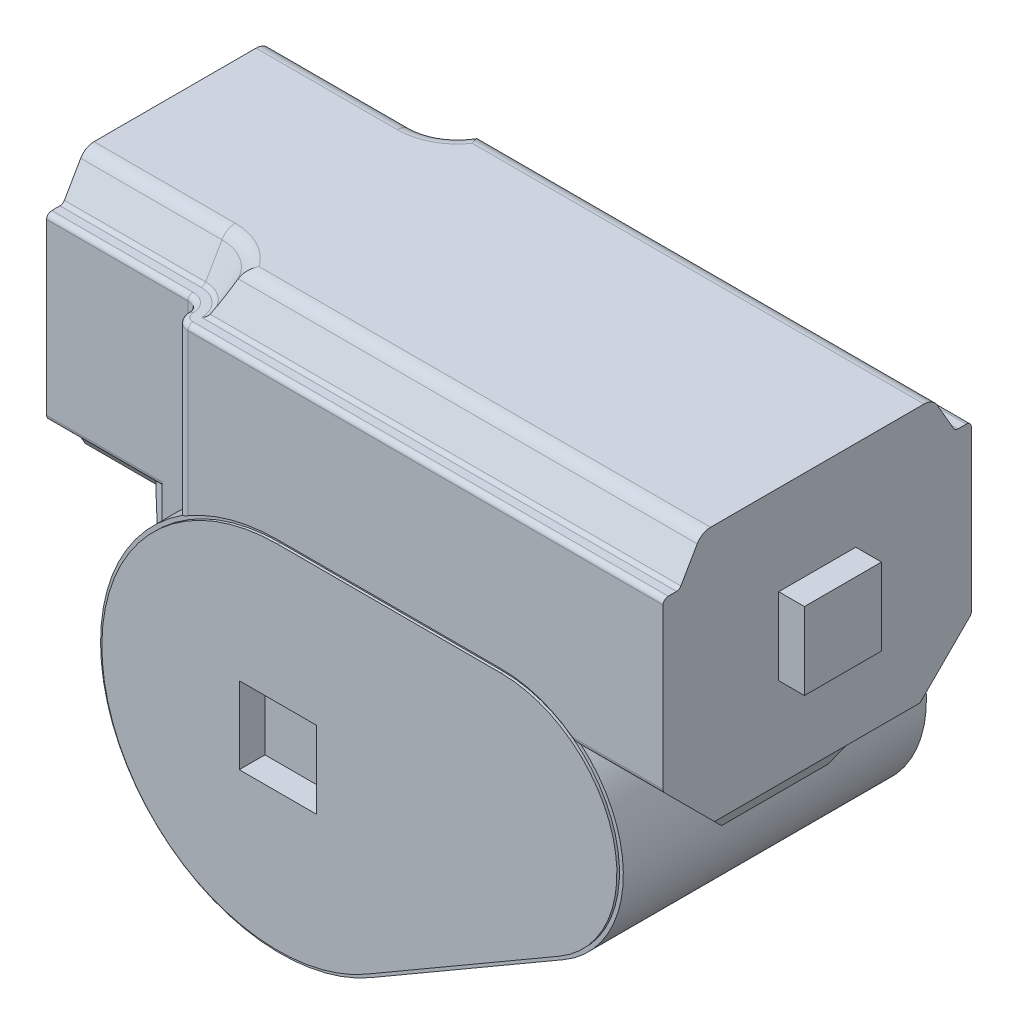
ISO-10303-21;
HEADER;
FILE_DESCRIPTION(('STEP AP214'),'2;1');
FILE_NAME('part.step','',(''),(''),'','','');
FILE_SCHEMA(('AUTOMOTIVE_DESIGN { 1 0 10303 214 1 1 1 1 }'));
ENDSEC;
DATA;
#1=APPLICATION_CONTEXT('core data for automotive mechanical design processes');
#2=APPLICATION_PROTOCOL_DEFINITION('international standard','automotive_design',2000,#1);
#3=PRODUCT_CONTEXT('',#1,'mechanical');
#4=PRODUCT('Part','Part','',(#3));
#5=PRODUCT_RELATED_PRODUCT_CATEGORY('part','',(#4));
#6=PRODUCT_DEFINITION_FORMATION('','',#4);
#7=PRODUCT_DEFINITION_CONTEXT('part definition',#1,'design');
#8=PRODUCT_DEFINITION('design','',#6,#7);
#9=PRODUCT_DEFINITION_SHAPE('','',#8);
#10=(LENGTH_UNIT() NAMED_UNIT(*) SI_UNIT(.MILLI.,.METRE.));
#11=(NAMED_UNIT(*) PLANE_ANGLE_UNIT() SI_UNIT($,.RADIAN.));
#12=(NAMED_UNIT(*) SI_UNIT($,.STERADIAN.) SOLID_ANGLE_UNIT());
#13=UNCERTAINTY_MEASURE_WITH_UNIT(LENGTH_MEASURE(1.E-05),#10,'distance_accuracy_value','');
#14=(GEOMETRIC_REPRESENTATION_CONTEXT(3) GLOBAL_UNCERTAINTY_ASSIGNED_CONTEXT((#13)) GLOBAL_UNIT_ASSIGNED_CONTEXT((#10,
#11,#12)) REPRESENTATION_CONTEXT('',''));
#15=CARTESIAN_POINT('',(0.,0.,0.));
#16=DIRECTION('',(0.,0.,1.));
#17=DIRECTION('',(1.,0.,0.));
#18=AXIS2_PLACEMENT_3D('',#15,#16,#17);
#19=CARTESIAN_POINT('',(-144.660555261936,348.240225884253,-60.));
#20=DIRECTION('',(0.,0.,-1.));
#21=DIRECTION('',(-1.,0.,0.));
#22=AXIS2_PLACEMENT_3D('',#19,#20,#21);
#23=PLANE('',#22);
#24=DIRECTION('',(0.,1.,0.));
#25=VECTOR('',#24,1.);
#26=CARTESIAN_POINT('',(-266.565973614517,364.842613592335,-60.));
#27=LINE('',#26,#25);
#28=CARTESIAN_POINT('',(-266.565973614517,385.464391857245,-60.));
#29=VERTEX_POINT('',#28);
#30=CARTESIAN_POINT('',(-266.565973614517,447.842613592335,-60.));
#31=VERTEX_POINT('',#30);
#32=EDGE_CURVE('E729',#29,#31,#27,.T.);
#33=ORIENTED_EDGE('',*,*,#32,.T.);
#34=DIRECTION('',(1.,0.,0.));
#35=VECTOR('',#34,1.);
#36=CARTESIAN_POINT('',(-144.660555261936,447.842613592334,-60.));
#37=LINE('',#36,#35);
#38=CARTESIAN_POINT('',(-81.565973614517,447.842613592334,-60.));
#39=VERTEX_POINT('',#38);
#40=EDGE_CURVE('E1267',#31,#39,#37,.T.);
#41=ORIENTED_EDGE('',*,*,#40,.T.);
#42=DIRECTION('',(0.,1.,0.));
#43=VECTOR('',#42,1.);
#44=CARTESIAN_POINT('',(-81.5659736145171,364.842613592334,-60.));
#45=LINE('',#44,#43);
#46=CARTESIAN_POINT('',(-81.5659736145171,385.671040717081,-60.));
#47=VERTEX_POINT('',#46);
#48=EDGE_CURVE('E732',#47,#39,#45,.T.);
#49=ORIENTED_EDGE('',*,*,#48,.F.);
#50=DIRECTION('',(-1.,0.,0.));
#51=VECTOR('',#50,1.);
#52=CARTESIAN_POINT('',(-144.660555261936,385.671040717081,-60.));
#53=LINE('',#52,#51);
#54=CARTESIAN_POINT('',(-116.898771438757,385.671040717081,-60.));
#55=VERTEX_POINT('',#54);
#56=EDGE_CURVE('E1261',#47,#55,#53,.T.);
#57=ORIENTED_EDGE('',*,*,#56,.T.);
#58=CARTESIAN_POINT('',(-144.660555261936,348.240225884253,-60.));
#59=DIRECTION('',(0.,0.,-1.));
#60=DIRECTION('',(-1.,0.,0.));
#61=AXIS2_PLACEMENT_3D('',#58,#59,#60);
#62=CIRCLE('',#61,46.6023877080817);
#63=CARTESIAN_POINT('',(-144.660555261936,394.842613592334,-60.));
#64=VERTEX_POINT('',#63);
#65=EDGE_CURVE('E638',#64,#55,#62,.T.);
#66=ORIENTED_EDGE('',*,*,#65,.F.);
#67=DIRECTION('',(1.,0.,0.));
#68=VECTOR('',#67,1.);
#69=CARTESIAN_POINT('',(-144.660555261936,394.842613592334,-60.));
#70=LINE('',#69,#68);
#71=CARTESIAN_POINT('',(-231.565973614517,394.842613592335,-60.));
#72=VERTEX_POINT('',#71);
#73=EDGE_CURVE('E635',#72,#64,#70,.T.);
#74=ORIENTED_EDGE('',*,*,#73,.F.);
#75=CARTESIAN_POINT('',(-231.565973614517,324.842613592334,-60.));
#76=DIRECTION('',(0.,0.,-1.));
#77=DIRECTION('',(-1.,0.,0.));
#78=AXIS2_PLACEMENT_3D('',#75,#76,#77);
#79=CIRCLE('',#78,70.0000000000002);
#80=EDGE_CURVE('E613',#29,#72,#79,.T.);
#81=ORIENTED_EDGE('',*,*,#80,.F.);
#82=EDGE_LOOP('',(#33,#41,#49,#57,#66,#74,#81));
#83=FACE_BOUND('',#82,.T.);
#84=ADVANCED_FACE('F35',(#83),#23,.T.);
#85=CARTESIAN_POINT('',(-144.660555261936,348.240225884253,60.));
#86=DIRECTION('',(0.,0.,-1.));
#87=DIRECTION('',(-1.,0.,0.));
#88=AXIS2_PLACEMENT_3D('',#85,#86,#87);
#89=PLANE('',#88);
#90=DIRECTION('',(0.,1.,0.));
#91=VECTOR('',#90,1.);
#92=CARTESIAN_POINT('',(-81.5659736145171,364.842613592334,60.));
#93=LINE('',#92,#91);
#94=CARTESIAN_POINT('',(-81.5659736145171,385.671040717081,60.));
#95=VERTEX_POINT('',#94);
#96=CARTESIAN_POINT('',(-81.565973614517,447.842613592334,60.));
#97=VERTEX_POINT('',#96);
#98=EDGE_CURVE('E735',#95,#97,#93,.T.);
#99=ORIENTED_EDGE('',*,*,#98,.T.);
#100=DIRECTION('',(1.,0.,0.));
#101=VECTOR('',#100,1.);
#102=CARTESIAN_POINT('',(-266.565973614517,447.842613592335,60.));
#103=LINE('',#102,#101);
#104=CARTESIAN_POINT('',(-266.565973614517,447.842613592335,60.));
#105=VERTEX_POINT('',#104);
#106=EDGE_CURVE('E958',#97,#105,#103,.F.);
#107=ORIENTED_EDGE('',*,*,#106,.T.);
#108=DIRECTION('',(0.,1.,0.));
#109=VECTOR('',#108,1.);
#110=CARTESIAN_POINT('',(-266.565973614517,364.842613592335,60.));
#111=LINE('',#110,#109);
#112=CARTESIAN_POINT('',(-266.565973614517,385.464391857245,60.));
#113=VERTEX_POINT('',#112);
#114=EDGE_CURVE('E738',#113,#105,#111,.T.);
#115=ORIENTED_EDGE('',*,*,#114,.F.);
#116=CARTESIAN_POINT('',(-231.565973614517,324.842613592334,60.));
#117=DIRECTION('',(0.,0.,1.));
#118=DIRECTION('',(1.,0.,0.));
#119=AXIS2_PLACEMENT_3D('',#116,#117,#118);
#120=CIRCLE('',#119,70.0000000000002);
#121=CARTESIAN_POINT('',(-231.565973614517,394.842613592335,60.));
#122=VERTEX_POINT('',#121);
#123=EDGE_CURVE('E697',#122,#113,#120,.T.);
#124=ORIENTED_EDGE('',*,*,#123,.F.);
#125=DIRECTION('',(-1.,0.,0.));
#126=VECTOR('',#125,1.);
#127=CARTESIAN_POINT('',(-144.660555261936,394.842613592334,60.));
#128=LINE('',#127,#126);
#129=CARTESIAN_POINT('',(-144.660555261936,394.842613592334,60.));
#130=VERTEX_POINT('',#129);
#131=EDGE_CURVE('E694',#130,#122,#128,.T.);
#132=ORIENTED_EDGE('',*,*,#131,.F.);
#133=CARTESIAN_POINT('',(-144.660555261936,348.240225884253,60.));
#134=DIRECTION('',(0.,0.,1.));
#135=DIRECTION('',(1.,0.,0.));
#136=AXIS2_PLACEMENT_3D('',#133,#134,#135);
#137=CIRCLE('',#136,46.6023877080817);
#138=CARTESIAN_POINT('',(-116.898771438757,385.671040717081,60.));
#139=VERTEX_POINT('',#138);
#140=EDGE_CURVE('E672',#139,#130,#137,.T.);
#141=ORIENTED_EDGE('',*,*,#140,.F.);
#142=DIRECTION('',(-1.,0.,0.));
#143=VECTOR('',#142,1.);
#144=CARTESIAN_POINT('',(-81.5659736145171,385.671040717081,60.));
#145=LINE('',#144,#143);
#146=EDGE_CURVE('E1289',#139,#95,#145,.F.);
#147=ORIENTED_EDGE('',*,*,#146,.T.);
#148=EDGE_LOOP('',(#99,#107,#115,#124,#132,#141,#147));
#149=FACE_BOUND('',#148,.T.);
#150=ADVANCED_FACE('F803',(#149),#89,.F.);
#151=CARTESIAN_POINT('',(-276.565973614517,364.842613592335,-55.));
#152=DIRECTION('',(0.,1.,0.));
#153=DIRECTION('',(-1.,0.,0.));
#154=AXIS2_PLACEMENT_3D('',#151,#152,#153);
#155=CYLINDRICAL_SURFACE('',#154,5.);
#156=DIRECTION('',(0.,1.,0.));
#157=VECTOR('',#156,1.);
#158=CARTESIAN_POINT('',(-276.565973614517,364.842613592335,-50.));
#159=LINE('',#158,#157);
#160=CARTESIAN_POINT('',(-276.565973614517,378.461640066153,-50.));
#161=VERTEX_POINT('',#160);
#162=CARTESIAN_POINT('',(-276.565973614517,447.842613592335,-50.));
#163=VERTEX_POINT('',#162);
#164=EDGE_CURVE('E723',#161,#163,#159,.T.);
#165=ORIENTED_EDGE('',*,*,#164,.T.);
#166=CARTESIAN_POINT('',(-276.565973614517,447.842613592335,-55.));
#167=DIRECTION('',(0.,1.,0.));
#168=DIRECTION('',(-1.,0.,0.));
#169=AXIS2_PLACEMENT_3D('',#166,#167,#168);
#170=CIRCLE('',#169,5.);
#171=CARTESIAN_POINT('',(-271.565973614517,447.842613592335,-55.));
#172=VERTEX_POINT('',#171);
#173=EDGE_CURVE('E1274',#163,#172,#170,.T.);
#174=ORIENTED_EDGE('',*,*,#173,.T.);
#175=DIRECTION('',(0.,1.,0.));
#176=VECTOR('',#175,1.);
#177=CARTESIAN_POINT('',(-271.565973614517,364.842613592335,-55.));
#178=LINE('',#177,#176);
#179=CARTESIAN_POINT('',(-271.565973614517,382.288240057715,-55.));
#180=VERTEX_POINT('',#179);
#181=EDGE_CURVE('E726',#180,#172,#178,.T.);
#182=ORIENTED_EDGE('',*,*,#181,.F.);
#183=CARTESIAN_POINT('',(-276.565973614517,378.461640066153,-60.));
#184=CARTESIAN_POINT('',(-276.241804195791,378.73369563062,-60.0000039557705));
#185=CARTESIAN_POINT('',(-275.914841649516,379.003053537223,-59.9685180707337));
#186=CARTESIAN_POINT('',(-275.263646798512,379.529803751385,-59.8388260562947));
#187=CARTESIAN_POINT('',(-274.939417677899,379.787183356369,-59.7405507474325));
#188=CARTESIAN_POINT('',(-274.360529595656,380.238791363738,-59.4962992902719));
#189=CARTESIAN_POINT('',(-274.103604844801,380.43620155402,-59.3616419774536));
#190=CARTESIAN_POINT('',(-273.607997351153,380.811931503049,-59.0419203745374));
#191=CARTESIAN_POINT('',(-273.369285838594,380.990281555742,-58.8569377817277));
#192=CARTESIAN_POINT('',(-272.960911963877,381.291808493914,-58.473772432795));
#193=CARTESIAN_POINT('',(-272.786552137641,381.419139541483,-58.2839455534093));
#194=CARTESIAN_POINT('',(-272.544971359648,381.594104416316,-57.9746788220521));
#195=CARTESIAN_POINT('',(-272.467738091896,381.649777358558,-57.8674438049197));
#196=CARTESIAN_POINT('',(-272.3208859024,381.755224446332,-57.6451742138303));
#197=CARTESIAN_POINT('',(-272.251263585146,381.805001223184,-57.5301431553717));
#198=CARTESIAN_POINT('',(-272.120046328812,381.898496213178,-57.2918103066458));
#199=CARTESIAN_POINT('',(-272.058524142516,381.94215971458,-57.1684468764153));
#200=CARTESIAN_POINT('',(-271.945218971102,382.022342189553,-56.915165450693));
#201=CARTESIAN_POINT('',(-271.893430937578,382.058864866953,-56.7852508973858));
#202=CARTESIAN_POINT('',(-271.800497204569,382.124254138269,-56.5198656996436));
#203=CARTESIAN_POINT('',(-271.759346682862,382.153124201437,-56.384397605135));
#204=CARTESIAN_POINT('',(-271.688457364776,382.202775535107,-56.1090680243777));
#205=CARTESIAN_POINT('',(-271.658716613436,382.223558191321,-55.969207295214));
#206=CARTESIAN_POINT('',(-271.614492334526,382.254430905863,-55.7058031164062));
#207=CARTESIAN_POINT('',(-271.598480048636,382.265593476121,-55.5826391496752));
#208=CARTESIAN_POINT('',(-271.575664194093,382.281492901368,-55.3350534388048));
#209=CARTESIAN_POINT('',(-271.568859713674,382.286230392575,-55.2106318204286));
#210=CARTESIAN_POINT('',(-271.564570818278,382.289216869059,-54.9616001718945));
#211=CARTESIAN_POINT('',(-271.56708279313,382.287468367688,-54.8369902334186));
#212=CARTESIAN_POINT('',(-271.581377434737,382.277511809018,-54.5885645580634));
#213=CARTESIAN_POINT('',(-271.593159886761,382.269303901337,-54.4647488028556));
#214=CARTESIAN_POINT('',(-271.624655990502,382.247337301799,-54.2275529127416));
#215=CARTESIAN_POINT('',(-271.643754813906,382.234008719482,-54.1140503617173));
#216=CARTESIAN_POINT('',(-271.689546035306,382.202004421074,-53.8893201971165));
#217=CARTESIAN_POINT('',(-271.716240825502,382.183327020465,-53.7780933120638));
#218=CARTESIAN_POINT('',(-271.776867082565,382.140828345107,-53.5586799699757));
#219=CARTESIAN_POINT('',(-271.810795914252,382.11700894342,-53.4504924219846));
#220=CARTESIAN_POINT('',(-271.885475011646,382.064461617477,-53.237708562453));
#221=CARTESIAN_POINT('',(-271.926227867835,382.035731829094,-53.1331136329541));
#222=CARTESIAN_POINT('',(-272.061605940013,381.940041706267,-52.8172456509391));
#223=CARTESIAN_POINT('',(-272.166885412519,381.865298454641,-52.6127379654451));
#224=CARTESIAN_POINT('',(-272.400359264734,381.698339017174,-52.2252982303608));
#225=CARTESIAN_POINT('',(-272.528562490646,381.606116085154,-52.0423745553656));
#226=CARTESIAN_POINT('',(-272.820677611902,381.394234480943,-51.6782761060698));
#227=CARTESIAN_POINT('',(-272.987054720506,381.27258145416,-51.5002440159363));
#228=CARTESIAN_POINT('',(-273.337011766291,381.014028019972,-51.1749515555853));
#229=CARTESIAN_POINT('',(-273.52060123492,380.87711915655,-51.0277083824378));
#230=CARTESIAN_POINT('',(-273.93465611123,380.5649029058,-50.7396140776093));
#231=CARTESIAN_POINT('',(-274.167542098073,380.387159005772,-50.6048917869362));
#232=CARTESIAN_POINT('',(-274.643276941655,380.01902791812,-50.3769126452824));
#233=CARTESIAN_POINT('',(-274.886131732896,379.828633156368,-50.2836808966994));
#234=CARTESIAN_POINT('',(-275.427130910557,379.398468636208,-50.1216435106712));
#235=CARTESIAN_POINT('',(-275.726335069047,379.156622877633,-50.0618597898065));
#236=CARTESIAN_POINT('',(-276.324185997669,378.665033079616,-49.9967862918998));
#237=CARTESIAN_POINT('',(-276.622832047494,378.415282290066,-49.9915444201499));
#238=CARTESIAN_POINT('',(-277.266063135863,377.868166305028,-50.0370095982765));
#239=CARTESIAN_POINT('',(-277.609477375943,377.570160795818,-50.0977311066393));
#240=CARTESIAN_POINT('',(-278.111503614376,377.126111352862,-50.241672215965));
#241=CARTESIAN_POINT('',(-278.276757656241,376.978501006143,-50.2985120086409));
#242=CARTESIAN_POINT('',(-278.601962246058,376.68529422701,-50.4299350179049));
#243=CARTESIAN_POINT('',(-278.761913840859,376.539697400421,-50.5045147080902));
#244=CARTESIAN_POINT('',(-279.050338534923,376.274773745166,-50.6583168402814));
#245=CARTESIAN_POINT('',(-279.179766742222,376.154957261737,-50.7349065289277));
#246=CARTESIAN_POINT('',(-279.433190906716,375.918631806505,-50.9009721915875));
#247=CARTESIAN_POINT('',(-279.557186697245,375.802122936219,-50.990448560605));
#248=CARTESIAN_POINT('',(-279.919379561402,375.459386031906,-51.2784794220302));
#249=CARTESIAN_POINT('',(-280.148408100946,375.239370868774,-51.496962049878));
#250=CARTESIAN_POINT('',(-280.511484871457,374.886417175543,-51.9198531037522));
#251=CARTESIAN_POINT('',(-280.654146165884,374.746374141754,-52.1109903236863));
#252=CARTESIAN_POINT('',(-280.915596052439,374.487838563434,-52.5221096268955));
#253=CARTESIAN_POINT('',(-281.034419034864,374.369314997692,-52.7420493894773));
#254=CARTESIAN_POINT('',(-281.220518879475,374.182658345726,-53.1623798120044));
#255=CARTESIAN_POINT('',(-281.293352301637,374.109187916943,-53.3578783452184));
#256=CARTESIAN_POINT('',(-281.384725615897,374.016730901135,-53.6617701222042));
#257=CARTESIAN_POINT('',(-281.41220755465,373.988866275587,-53.7648626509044));
#258=CARTESIAN_POINT('',(-281.460756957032,373.939576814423,-53.9740353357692));
#259=CARTESIAN_POINT('',(-281.481827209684,373.918149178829,-54.0801141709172));
#260=CARTESIAN_POINT('',(-281.517274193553,373.882069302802,-54.29530308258));
#261=CARTESIAN_POINT('',(-281.531603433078,373.867465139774,-54.4044290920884));
#262=CARTESIAN_POINT('',(-281.55304653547,373.845601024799,-54.6241244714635));
#263=CARTESIAN_POINT('',(-281.560160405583,373.838341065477,-54.7346938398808));
#264=CARTESIAN_POINT('',(-281.567010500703,373.831350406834,-54.9562695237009));
#265=CARTESIAN_POINT('',(-281.566748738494,373.831617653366,-55.0672757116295));
#266=CARTESIAN_POINT('',(-281.558858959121,373.839669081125,-55.2887445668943));
#267=CARTESIAN_POINT('',(-281.551231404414,373.847452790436,-55.3992072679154));
#268=CARTESIAN_POINT('',(-281.529952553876,373.869147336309,-55.6071826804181));
#269=CARTESIAN_POINT('',(-281.517012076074,373.8823348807,-55.7048449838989));
#270=CARTESIAN_POINT('',(-281.485587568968,373.914322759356,-55.8983458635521));
#271=CARTESIAN_POINT('',(-281.467101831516,373.933124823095,-55.9941838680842));
#272=CARTESIAN_POINT('',(-281.403730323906,373.997487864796,-56.2781312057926));
#273=CARTESIAN_POINT('',(-281.350918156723,374.051018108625,-56.4627877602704));
#274=CARTESIAN_POINT('',(-281.248160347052,374.154718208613,-56.7586155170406));
#275=CARTESIAN_POINT('',(-281.203324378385,374.199863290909,-56.8734581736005));
#276=CARTESIAN_POINT('',(-281.106549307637,374.296997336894,-57.0971420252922));
#277=CARTESIAN_POINT('',(-281.05460825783,374.348988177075,-57.2059815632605));
#278=CARTESIAN_POINT('',(-280.889242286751,374.51392692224,-57.5231425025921));
#279=CARTESIAN_POINT('',(-280.76633366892,374.63578105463,-57.721941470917));
#280=CARTESIAN_POINT('',(-280.452962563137,374.943771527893,-58.1603757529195));
#281=CARTESIAN_POINT('',(-280.254134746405,375.137229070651,-58.3888257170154));
#282=CARTESIAN_POINT('',(-279.936508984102,375.442151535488,-58.6961140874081));
#283=CARTESIAN_POINT('',(-279.827237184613,375.546404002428,-58.7927556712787));
#284=CARTESIAN_POINT('',(-279.603048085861,375.758851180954,-58.9745435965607));
#285=CARTESIAN_POINT('',(-279.48813086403,375.867045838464,-59.0596900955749));
#286=CARTESIAN_POINT('',(-279.219220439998,376.11844678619,-59.2419110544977));
#287=CARTESIAN_POINT('',(-279.063607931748,376.262658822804,-59.3352185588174));
#288=CARTESIAN_POINT('',(-278.745775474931,376.554440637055,-59.5034233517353));
#289=CARTESIAN_POINT('',(-278.583553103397,376.702011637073,-59.5783138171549));
#290=CARTESIAN_POINT('',(-278.089305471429,377.147247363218,-59.7754641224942));
#291=CARTESIAN_POINT('',(-277.748874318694,377.448209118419,-59.8707504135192));
#292=CARTESIAN_POINT('',(-277.264696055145,377.867706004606,-59.9529092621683));
#293=CARTESIAN_POINT('',(-277.125972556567,377.986946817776,-59.9705131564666));
#294=CARTESIAN_POINT('',(-276.846999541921,378.224841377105,-59.9940579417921));
#295=CARTESIAN_POINT('',(-276.706749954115,378.343495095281,-59.9999982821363));
#296=CARTESIAN_POINT('',(-276.565973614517,378.461640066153,-60.));
#297=B_SPLINE_CURVE_WITH_KNOTS('',3,(#183,#184,#185,#186,#187,#188,#189,#190,#191,#192,#193,
#194,#195,#196,#197,#198,#199,#200,#201,#202,#203,#204,#205,#206,#207,#208,#209,#210,#211,#212,
#213,#214,#215,#216,#217,#218,#219,#220,#221,#222,#223,#224,#225,#226,#227,#228,#229,#230,#231,
#232,#233,#234,#235,#236,#237,#238,#239,#240,#241,#242,#243,#244,#245,#246,#247,#248,#249,#250,
#251,#252,#253,#254,#255,#256,#257,#258,#259,#260,#261,#262,#263,#264,#265,#266,#267,#268,#269,
#270,#271,#272,#273,#274,#275,#276,#277,#278,#279,#280,#281,#282,#283,#284,#285,#286,#287,#288,
#289,#290,#291,#292,#293,#294,#295,#296),.UNSPECIFIED.,.T.,.F.,(4,2,2,2,2,2,2,2,2,2,2,2,2,2,2,2,
2,2,2,2,2,2,2,2,2,2,2,2,2,2,2,2,2,2,2,2,2,2,2,2,2,2,2,2,2,2,2,2,2,2,2,2,2,2,2,2,4),(0.,
1.26901855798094,2.53935355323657,3.58797587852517,4.63490594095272,5.49356695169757,
5.9233174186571,6.35287536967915,6.786060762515,7.21902086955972,7.65178436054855,
8.08447366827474,8.45808364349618,8.83165662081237,9.20508485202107,9.57850443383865,
9.92571020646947,10.2730254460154,10.6202143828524,10.9675354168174,11.6898997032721,
12.4125433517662,13.22651498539,14.0409400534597,15.0047837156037,15.9692097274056,
17.1328251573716,18.2974625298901,19.6671783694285,20.3528532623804,21.0383919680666,
21.6147100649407,22.1910458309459,23.341009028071,24.1681029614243,24.993994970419,
25.6546560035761,25.9851162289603,26.3154325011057,26.6480422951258,26.9806517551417,
27.3131704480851,27.6456682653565,27.9435055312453,28.2414346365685,28.8369511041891,
29.2303670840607,29.6238911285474,30.4114870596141,31.4835553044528,32.0210898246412,
32.5586169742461,33.2529595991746,33.9475590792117,35.3330297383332,35.8840976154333,
36.4351915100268),.UNSPECIFIED.);
#298=EDGE_CURVE('E789',#180,#161,#297,.T.);
#299=ORIENTED_EDGE('',*,*,#298,.T.);
#300=EDGE_LOOP('',(#165,#174,#182,#299));
#301=FACE_BOUND('',#300,.T.);
#302=ADVANCED_FACE('F778',(#301),#155,.F.);
#303=CARTESIAN_POINT('',(-276.565973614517,364.842613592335,55.));
#304=DIRECTION('',(0.,1.,0.));
#305=DIRECTION('',(-1.,0.,0.));
#306=AXIS2_PLACEMENT_3D('',#303,#304,#305);
#307=CYLINDRICAL_SURFACE('',#306,5.);
#308=DIRECTION('',(0.,1.,0.));
#309=VECTOR('',#308,1.);
#310=CARTESIAN_POINT('',(-271.565973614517,364.842613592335,54.9999999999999));
#311=LINE('',#310,#309);
#312=CARTESIAN_POINT('',(-271.565973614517,382.288240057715,54.9999999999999));
#313=VERTEX_POINT('',#312);
#314=CARTESIAN_POINT('',(-271.565973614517,447.842613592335,54.9999999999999));
#315=VERTEX_POINT('',#314);
#316=EDGE_CURVE('E741',#313,#315,#311,.T.);
#317=ORIENTED_EDGE('',*,*,#316,.T.);
#318=CARTESIAN_POINT('',(-276.565973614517,447.842613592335,55.));
#319=DIRECTION('',(0.,1.,0.));
#320=DIRECTION('',(-1.,0.,0.));
#321=AXIS2_PLACEMENT_3D('',#318,#319,#320);
#322=CIRCLE('',#321,5.);
#323=CARTESIAN_POINT('',(-276.565973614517,447.842613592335,50.));
#324=VERTEX_POINT('',#323);
#325=EDGE_CURVE('E947',#315,#324,#322,.T.);
#326=ORIENTED_EDGE('',*,*,#325,.T.);
#327=DIRECTION('',(0.,1.,0.));
#328=VECTOR('',#327,1.);
#329=CARTESIAN_POINT('',(-276.565973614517,364.842613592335,50.));
#330=LINE('',#329,#328);
#331=CARTESIAN_POINT('',(-276.565973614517,378.461640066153,50.));
#332=VERTEX_POINT('',#331);
#333=EDGE_CURVE('E715',#332,#324,#330,.T.);
#334=ORIENTED_EDGE('',*,*,#333,.F.);
#335=CARTESIAN_POINT('',(-276.565973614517,378.461640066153,60.));
#336=CARTESIAN_POINT('',(-276.241804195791,378.73369563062,60.0000039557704));
#337=CARTESIAN_POINT('',(-275.914841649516,379.003053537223,59.9685180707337));
#338=CARTESIAN_POINT('',(-275.263646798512,379.529803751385,59.8388260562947));
#339=CARTESIAN_POINT('',(-274.939417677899,379.787183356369,59.7405507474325));
#340=CARTESIAN_POINT('',(-274.360529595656,380.238791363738,59.4962992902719));
#341=CARTESIAN_POINT('',(-274.103604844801,380.43620155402,59.3616419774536));
#342=CARTESIAN_POINT('',(-273.607997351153,380.811931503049,59.0419203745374));
#343=CARTESIAN_POINT('',(-273.369285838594,380.990281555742,58.8569377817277));
#344=CARTESIAN_POINT('',(-272.960911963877,381.291808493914,58.473772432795));
#345=CARTESIAN_POINT('',(-272.786552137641,381.419139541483,58.2839455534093));
#346=CARTESIAN_POINT('',(-272.544971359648,381.594104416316,57.9746788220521));
#347=CARTESIAN_POINT('',(-272.467738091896,381.649777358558,57.8674438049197));
#348=CARTESIAN_POINT('',(-272.3208859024,381.755224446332,57.6451742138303));
#349=CARTESIAN_POINT('',(-272.251263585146,381.805001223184,57.5301431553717));
#350=CARTESIAN_POINT('',(-272.120046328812,381.898496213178,57.2918103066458));
#351=CARTESIAN_POINT('',(-272.058524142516,381.94215971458,57.1684468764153));
#352=CARTESIAN_POINT('',(-271.945218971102,382.022342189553,56.915165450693));
#353=CARTESIAN_POINT('',(-271.893430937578,382.058864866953,56.7852508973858));
#354=CARTESIAN_POINT('',(-271.800497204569,382.124254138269,56.5198656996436));
#355=CARTESIAN_POINT('',(-271.759346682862,382.153124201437,56.384397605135));
#356=CARTESIAN_POINT('',(-271.688457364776,382.202775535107,56.1090680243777));
#357=CARTESIAN_POINT('',(-271.658716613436,382.223558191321,55.969207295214));
#358=CARTESIAN_POINT('',(-271.614492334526,382.254430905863,55.7058031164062));
#359=CARTESIAN_POINT('',(-271.598480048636,382.265593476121,55.5826391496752));
#360=CARTESIAN_POINT('',(-271.575664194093,382.281492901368,55.3350534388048));
#361=CARTESIAN_POINT('',(-271.568859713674,382.286230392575,55.2106318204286));
#362=CARTESIAN_POINT('',(-271.564570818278,382.289216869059,54.9616001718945));
#363=CARTESIAN_POINT('',(-271.56708279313,382.287468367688,54.8369902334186));
#364=CARTESIAN_POINT('',(-271.581377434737,382.277511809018,54.5885645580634));
#365=CARTESIAN_POINT('',(-271.593159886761,382.269303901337,54.4647488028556));
#366=CARTESIAN_POINT('',(-271.624655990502,382.247337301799,54.2275529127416));
#367=CARTESIAN_POINT('',(-271.643754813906,382.234008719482,54.1140503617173));
#368=CARTESIAN_POINT('',(-271.689546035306,382.202004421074,53.8893201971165));
#369=CARTESIAN_POINT('',(-271.716240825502,382.183327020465,53.7780933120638));
#370=CARTESIAN_POINT('',(-271.776867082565,382.140828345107,53.5586799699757));
#371=CARTESIAN_POINT('',(-271.810795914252,382.11700894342,53.4504924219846));
#372=CARTESIAN_POINT('',(-271.885475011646,382.064461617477,53.237708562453));
#373=CARTESIAN_POINT('',(-271.926227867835,382.035731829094,53.1331136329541));
#374=CARTESIAN_POINT('',(-272.061605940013,381.940041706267,52.8172456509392));
#375=CARTESIAN_POINT('',(-272.166885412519,381.865298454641,52.6127379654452));
#376=CARTESIAN_POINT('',(-272.400359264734,381.698339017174,52.2252982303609));
#377=CARTESIAN_POINT('',(-272.528562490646,381.606116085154,52.0423745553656));
#378=CARTESIAN_POINT('',(-272.820677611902,381.394234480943,51.6782761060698));
#379=CARTESIAN_POINT('',(-272.987054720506,381.27258145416,51.5002440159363));
#380=CARTESIAN_POINT('',(-273.337011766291,381.014028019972,51.1749515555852));
#381=CARTESIAN_POINT('',(-273.520601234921,380.87711915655,51.0277083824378));
#382=CARTESIAN_POINT('',(-273.93465611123,380.5649029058,50.7396140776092));
#383=CARTESIAN_POINT('',(-274.167542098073,380.387159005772,50.6048917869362));
#384=CARTESIAN_POINT('',(-274.643276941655,380.01902791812,50.3769126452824));
#385=CARTESIAN_POINT('',(-274.886131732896,379.828633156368,50.2836808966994));
#386=CARTESIAN_POINT('',(-275.427130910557,379.398468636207,50.1216435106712));
#387=CARTESIAN_POINT('',(-275.726335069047,379.156622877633,50.0618597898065));
#388=CARTESIAN_POINT('',(-276.324185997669,378.665033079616,49.9967862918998));
#389=CARTESIAN_POINT('',(-276.622832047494,378.415282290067,49.9915444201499));
#390=CARTESIAN_POINT('',(-277.266063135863,377.868166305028,50.0370095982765));
#391=CARTESIAN_POINT('',(-277.609477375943,377.570160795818,50.0977311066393));
#392=CARTESIAN_POINT('',(-278.111503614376,377.126111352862,50.241672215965));
#393=CARTESIAN_POINT('',(-278.276757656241,376.978501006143,50.2985120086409));
#394=CARTESIAN_POINT('',(-278.601962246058,376.68529422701,50.4299350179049));
#395=CARTESIAN_POINT('',(-278.761913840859,376.539697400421,50.5045147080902));
#396=CARTESIAN_POINT('',(-279.050338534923,376.274773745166,50.6583168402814));
#397=CARTESIAN_POINT('',(-279.179766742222,376.154957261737,50.7349065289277));
#398=CARTESIAN_POINT('',(-279.433190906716,375.918631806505,50.9009721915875));
#399=CARTESIAN_POINT('',(-279.557186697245,375.802122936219,50.990448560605));
#400=CARTESIAN_POINT('',(-279.919379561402,375.459386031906,51.2784794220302));
#401=CARTESIAN_POINT('',(-280.148408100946,375.239370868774,51.496962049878));
#402=CARTESIAN_POINT('',(-280.511484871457,374.886417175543,51.9198531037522));
#403=CARTESIAN_POINT('',(-280.654146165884,374.746374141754,52.1109903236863));
#404=CARTESIAN_POINT('',(-280.915596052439,374.487838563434,52.5221096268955));
#405=CARTESIAN_POINT('',(-281.034419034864,374.369314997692,52.7420493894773));
#406=CARTESIAN_POINT('',(-281.220518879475,374.182658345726,53.1623798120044));
#407=CARTESIAN_POINT('',(-281.293352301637,374.109187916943,53.3578783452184));
#408=CARTESIAN_POINT('',(-281.384725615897,374.016730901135,53.6617701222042));
#409=CARTESIAN_POINT('',(-281.41220755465,373.988866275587,53.7648626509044));
#410=CARTESIAN_POINT('',(-281.460756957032,373.939576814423,53.9740353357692));
#411=CARTESIAN_POINT('',(-281.481827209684,373.918149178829,54.0801141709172));
#412=CARTESIAN_POINT('',(-281.517274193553,373.882069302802,54.29530308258));
#413=CARTESIAN_POINT('',(-281.531603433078,373.867465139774,54.4044290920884));
#414=CARTESIAN_POINT('',(-281.55304653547,373.845601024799,54.6241244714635));
#415=CARTESIAN_POINT('',(-281.560160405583,373.838341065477,54.7346938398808));
#416=CARTESIAN_POINT('',(-281.567010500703,373.831350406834,54.9562695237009));
#417=CARTESIAN_POINT('',(-281.566748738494,373.831617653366,55.0672757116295));
#418=CARTESIAN_POINT('',(-281.558858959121,373.839669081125,55.2887445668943));
#419=CARTESIAN_POINT('',(-281.551231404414,373.847452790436,55.3992072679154));
#420=CARTESIAN_POINT('',(-281.529952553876,373.869147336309,55.6071826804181));
#421=CARTESIAN_POINT('',(-281.517012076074,373.8823348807,55.7048449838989));
#422=CARTESIAN_POINT('',(-281.485587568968,373.914322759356,55.8983458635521));
#423=CARTESIAN_POINT('',(-281.467101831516,373.933124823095,55.9941838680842));
#424=CARTESIAN_POINT('',(-281.403730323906,373.997487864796,56.2781312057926));
#425=CARTESIAN_POINT('',(-281.350918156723,374.051018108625,56.4627877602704));
#426=CARTESIAN_POINT('',(-281.248160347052,374.154718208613,56.7586155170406));
#427=CARTESIAN_POINT('',(-281.203324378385,374.199863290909,56.8734581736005));
#428=CARTESIAN_POINT('',(-281.106549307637,374.296997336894,57.0971420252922));
#429=CARTESIAN_POINT('',(-281.05460825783,374.348988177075,57.2059815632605));
#430=CARTESIAN_POINT('',(-280.889242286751,374.51392692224,57.5231425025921));
#431=CARTESIAN_POINT('',(-280.76633366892,374.63578105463,57.721941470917));
#432=CARTESIAN_POINT('',(-280.452962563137,374.943771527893,58.1603757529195));
#433=CARTESIAN_POINT('',(-280.254134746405,375.137229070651,58.3888257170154));
#434=CARTESIAN_POINT('',(-279.936508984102,375.442151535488,58.6961140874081));
#435=CARTESIAN_POINT('',(-279.827237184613,375.546404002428,58.7927556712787));
#436=CARTESIAN_POINT('',(-279.603048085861,375.758851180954,58.9745435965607));
#437=CARTESIAN_POINT('',(-279.48813086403,375.867045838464,59.0596900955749));
#438=CARTESIAN_POINT('',(-279.219220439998,376.11844678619,59.2419110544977));
#439=CARTESIAN_POINT('',(-279.063607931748,376.262658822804,59.3352185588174));
#440=CARTESIAN_POINT('',(-278.745775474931,376.554440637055,59.5034233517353));
#441=CARTESIAN_POINT('',(-278.583553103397,376.702011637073,59.5783138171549));
#442=CARTESIAN_POINT('',(-278.089305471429,377.147247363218,59.7754641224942));
#443=CARTESIAN_POINT('',(-277.748874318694,377.448209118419,59.8707504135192));
#444=CARTESIAN_POINT('',(-277.264696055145,377.867706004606,59.9529092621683));
#445=CARTESIAN_POINT('',(-277.125972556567,377.986946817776,59.9705131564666));
#446=CARTESIAN_POINT('',(-276.846999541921,378.224841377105,59.9940579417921));
#447=CARTESIAN_POINT('',(-276.706749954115,378.343495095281,59.9999982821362));
#448=CARTESIAN_POINT('',(-276.565973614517,378.461640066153,60.));
#449=B_SPLINE_CURVE_WITH_KNOTS('',3,(#335,#336,#337,#338,#339,#340,#341,#342,#343,#344,#345,
#346,#347,#348,#349,#350,#351,#352,#353,#354,#355,#356,#357,#358,#359,#360,#361,#362,#363,#364,
#365,#366,#367,#368,#369,#370,#371,#372,#373,#374,#375,#376,#377,#378,#379,#380,#381,#382,#383,
#384,#385,#386,#387,#388,#389,#390,#391,#392,#393,#394,#395,#396,#397,#398,#399,#400,#401,#402,
#403,#404,#405,#406,#407,#408,#409,#410,#411,#412,#413,#414,#415,#416,#417,#418,#419,#420,#421,
#422,#423,#424,#425,#426,#427,#428,#429,#430,#431,#432,#433,#434,#435,#436,#437,#438,#439,#440,
#441,#442,#443,#444,#445,#446,#447,#448),.UNSPECIFIED.,.T.,.F.,(4,2,2,2,2,2,2,2,2,2,2,2,2,2,2,2,
2,2,2,2,2,2,2,2,2,2,2,2,2,2,2,2,2,2,2,2,2,2,2,2,2,2,2,2,2,2,2,2,2,2,2,2,2,2,2,2,4),(0.,
1.26901855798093,2.53935355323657,3.58797587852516,4.63490594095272,5.49356695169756,
5.9233174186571,6.35287536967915,6.786060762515,7.21902086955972,7.65178436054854,
8.08447366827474,8.45808364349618,8.83165662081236,9.20508485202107,9.57850443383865,
9.92571020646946,10.2730254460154,10.6202143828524,10.9675354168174,11.6898997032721,
12.4125433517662,13.2265149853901,14.0409400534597,15.0047837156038,15.9692097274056,
17.1328251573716,18.2974625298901,19.6671783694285,20.3528532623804,21.0383919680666,
21.6147100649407,22.1910458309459,23.341009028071,24.1681029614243,24.993994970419,
25.6546560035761,25.9851162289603,26.3154325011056,26.6480422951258,26.9806517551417,
27.313170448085,27.6456682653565,27.9435055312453,28.2414346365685,28.8369511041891,
29.2303670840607,29.6238911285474,30.411487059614,31.4835553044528,32.0210898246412,
32.5586169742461,33.2529595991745,33.9475590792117,35.3330297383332,35.8840976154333,
36.4351915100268),.UNSPECIFIED.);
#450=EDGE_CURVE('E782',#313,#332,#449,.T.);
#451=ORIENTED_EDGE('',*,*,#450,.F.);
#452=EDGE_LOOP('',(#317,#326,#334,#451));
#453=FACE_BOUND('',#452,.T.);
#454=ADVANCED_FACE('F774',(#453),#307,.F.);
#455=CARTESIAN_POINT('',(-266.565973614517,364.842613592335,-54.9999999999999));
#456=DIRECTION('',(0.,1.,0.));
#457=DIRECTION('',(-1.,0.,0.));
#458=AXIS2_PLACEMENT_3D('',#455,#456,#457);
#459=CYLINDRICAL_SURFACE('',#458,5.00000000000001);
#460=ORIENTED_EDGE('',*,*,#181,.T.);
#461=CARTESIAN_POINT('',(-266.565973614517,447.842613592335,-54.9999999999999));
#462=DIRECTION('',(0.,1.,0.));
#463=DIRECTION('',(-1.,0.,0.));
#464=AXIS2_PLACEMENT_3D('',#461,#462,#463);
#465=CIRCLE('',#464,5.00000000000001);
#466=EDGE_CURVE('E1272',#172,#31,#465,.F.);
#467=ORIENTED_EDGE('',*,*,#466,.T.);
#468=ORIENTED_EDGE('',*,*,#32,.F.);
#469=CARTESIAN_POINT('',(-266.565973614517,385.464391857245,-59.9999999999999));
#470=CARTESIAN_POINT('',(-266.750370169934,385.357944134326,-59.9999938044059));
#471=CARTESIAN_POINT('',(-266.934247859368,385.250647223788,-59.9897991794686));
#472=CARTESIAN_POINT('',(-267.299434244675,385.035339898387,-59.9493245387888));
#473=CARTESIAN_POINT('',(-267.480742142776,384.927329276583,-59.9190384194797));
#474=CARTESIAN_POINT('',(-267.840102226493,384.711068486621,-59.8384576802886));
#475=CARTESIAN_POINT('',(-268.018131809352,384.60282012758,-59.7880568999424));
#476=CARTESIAN_POINT('',(-268.36823241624,384.387857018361,-59.6675641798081));
#477=CARTESIAN_POINT('',(-268.540304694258,384.281141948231,-59.5974764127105));
#478=CARTESIAN_POINT('',(-269.005111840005,383.990163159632,-59.3770046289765));
#479=CARTESIAN_POINT('',(-269.290150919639,383.808607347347,-59.2060800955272));
#480=CARTESIAN_POINT('',(-269.826060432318,383.462297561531,-58.8056977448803));
#481=CARTESIAN_POINT('',(-270.077038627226,383.297491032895,-58.5764314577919));
#482=CARTESIAN_POINT('',(-270.474601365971,383.033336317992,-58.1285032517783));
#483=CARTESIAN_POINT('',(-270.631395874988,382.928083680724,-57.9224408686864));
#484=CARTESIAN_POINT('',(-270.843497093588,382.784683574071,-57.5922890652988));
#485=CARTESIAN_POINT('',(-270.910382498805,382.73927362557,-57.4786537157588));
#486=CARTESIAN_POINT('',(-271.035667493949,382.653936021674,-57.2448611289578));
#487=CARTESIAN_POINT('',(-271.094070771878,382.614005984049,-57.1247067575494));
#488=CARTESIAN_POINT('',(-271.20210330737,382.539940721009,-56.8774111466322));
#489=CARTESIAN_POINT('',(-271.251649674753,382.505860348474,-56.7502171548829));
#490=CARTESIAN_POINT('',(-271.340531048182,382.444588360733,-56.4907676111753));
#491=CARTESIAN_POINT('',(-271.379871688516,382.417392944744,-56.3585148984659));
#492=CARTESIAN_POINT('',(-271.447621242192,382.370484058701,-56.0902385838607));
#493=CARTESIAN_POINT('',(-271.476052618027,382.350755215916,-55.9542233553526));
#494=CARTESIAN_POINT('',(-271.521542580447,382.319159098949,-55.679481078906));
#495=CARTESIAN_POINT('',(-271.538610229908,382.307285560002,-55.5407562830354));
#496=CARTESIAN_POINT('',(-271.55521213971,382.295732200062,-55.3346493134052));
#497=CARTESIAN_POINT('',(-271.559248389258,382.292922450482,-55.2677666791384));
#498=CARTESIAN_POINT('',(-271.564627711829,382.289177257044,-55.1339265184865));
#499=CARTESIAN_POINT('',(-271.56597421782,382.288239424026,-55.0669691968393));
#500=CARTESIAN_POINT('',(-271.565973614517,382.288240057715,-55.));
#501=B_SPLINE_CURVE_WITH_KNOTS('',3,(#469,#470,#471,#472,#473,#474,#475,#476,#477,#478,#479,
#480,#481,#482,#483,#484,#485,#486,#487,#488,#489,#490,#491,#492,#493,#494,#495,#496,#497,#498,
#499,#500),.UNSPECIFIED.,.F.,.F.,(4,2,2,2,2,2,2,2,2,2,2,2,2,2,2,4),(0.,0.6384645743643,
1.2771231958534,1.91919805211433,2.56113692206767,3.69099675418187,4.81719417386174,
5.65205389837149,6.06998915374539,6.48774214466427,6.90922059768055,7.33046586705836,
7.75083906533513,8.17087660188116,8.3719974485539,8.57286143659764),.UNSPECIFIED.);
#502=CARTESIAN_POINT('',(-269.565973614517,383.630367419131,-59.));
#503=VERTEX_POINT('',#502);
#504=EDGE_CURVE('E754',#29,#503,#501,.T.);
#505=ORIENTED_EDGE('',*,*,#504,.T.);
#506=EDGE_CURVE('E753',#503,#180,#501,.T.);
#507=ORIENTED_EDGE('',*,*,#506,.T.);
#508=EDGE_LOOP('',(#460,#467,#468,#505,#507));
#509=FACE_BOUND('',#508,.T.);
#510=ADVANCED_FACE('F771',(#509),#459,.T.);
#511=CARTESIAN_POINT('',(-266.565973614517,364.842613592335,54.9999999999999));
#512=DIRECTION('',(0.,1.,0.));
#513=DIRECTION('',(-1.,0.,0.));
#514=AXIS2_PLACEMENT_3D('',#511,#512,#513);
#515=CYLINDRICAL_SURFACE('',#514,5.00000000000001);
#516=ORIENTED_EDGE('',*,*,#114,.T.);
#517=CARTESIAN_POINT('',(-266.565973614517,447.842613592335,54.9999999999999));
#518=DIRECTION('',(0.,1.,0.));
#519=DIRECTION('',(-1.,0.,0.));
#520=AXIS2_PLACEMENT_3D('',#517,#518,#519);
#521=CIRCLE('',#520,5.00000000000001);
#522=EDGE_CURVE('E953',#105,#315,#521,.F.);
#523=ORIENTED_EDGE('',*,*,#522,.T.);
#524=ORIENTED_EDGE('',*,*,#316,.F.);
#525=CARTESIAN_POINT('',(-266.565973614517,385.464391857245,60.));
#526=CARTESIAN_POINT('',(-266.750614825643,385.357789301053,60.0000008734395));
#527=CARTESIAN_POINT('',(-266.934764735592,385.250342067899,59.989772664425));
#528=CARTESIAN_POINT('',(-267.300515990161,385.034702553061,59.9491737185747));
#529=CARTESIAN_POINT('',(-267.482115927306,384.92650990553,59.9187922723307));
#530=CARTESIAN_POINT('',(-267.841451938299,384.710248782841,59.8380924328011));
#531=CARTESIAN_POINT('',(-268.019178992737,384.602181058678,59.7877318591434));
#532=CARTESIAN_POINT('',(-268.368760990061,384.387528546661,59.6673467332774));
#533=CARTESIAN_POINT('',(-268.54061669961,384.28094356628,59.5973247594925));
#534=CARTESIAN_POINT('',(-268.85695169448,384.082917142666,59.4472845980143));
#535=CARTESIAN_POINT('',(-269.002267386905,383.991173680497,59.3694231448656));
#536=CARTESIAN_POINT('',(-269.285844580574,383.810736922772,59.1987718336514));
#537=CARTESIAN_POINT('',(-269.42410710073,383.722043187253,59.1059841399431));
#538=CARTESIAN_POINT('',(-269.692032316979,383.548908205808,58.9058473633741));
#539=CARTESIAN_POINT('',(-269.821711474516,383.464458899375,58.7985274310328));
#540=CARTESIAN_POINT('',(-270.071242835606,383.30085964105,58.5695648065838));
#541=CARTESIAN_POINT('',(-270.191098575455,383.221707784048,58.4479273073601));
#542=CARTESIAN_POINT('',(-270.474550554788,383.033366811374,58.128552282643));
#543=CARTESIAN_POINT('',(-270.631461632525,382.928038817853,57.9223496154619));
#544=CARTESIAN_POINT('',(-270.84359540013,382.784617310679,57.5921304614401));
#545=CARTESIAN_POINT('',(-270.910453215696,382.739225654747,57.4785295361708));
#546=CARTESIAN_POINT('',(-271.03569583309,382.653916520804,57.2448004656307));
#547=CARTESIAN_POINT('',(-271.094084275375,382.613996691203,57.124675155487));
#548=CARTESIAN_POINT('',(-271.202050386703,382.539977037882,56.8775329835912));
#549=CARTESIAN_POINT('',(-271.251552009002,382.50592753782,56.7504677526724));
#550=CARTESIAN_POINT('',(-271.34036693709,382.444701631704,56.491281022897));
#551=CARTESIAN_POINT('',(-271.379685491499,382.417521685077,56.3591621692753));
#552=CARTESIAN_POINT('',(-271.44746697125,382.370591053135,56.0909389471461));
#553=CARTESIAN_POINT('',(-271.475935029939,382.350836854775,55.9548364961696));
#554=CARTESIAN_POINT('',(-271.521498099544,382.319190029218,55.6798463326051));
#555=CARTESIAN_POINT('',(-271.538594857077,382.307296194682,55.5409590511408));
#556=CARTESIAN_POINT('',(-271.559613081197,382.292669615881,55.2800027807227));
#557=CARTESIAN_POINT('',(-271.564961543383,382.288944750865,55.1581015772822));
#558=CARTESIAN_POINT('',(-271.566724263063,382.287717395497,54.91420598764));
#559=CARTESIAN_POINT('',(-271.563139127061,382.290214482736,54.7922116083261));
#560=CARTESIAN_POINT('',(-271.547092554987,382.301383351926,54.5491235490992));
#561=CARTESIAN_POINT('',(-271.534633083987,382.310053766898,54.4280296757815));
#562=CARTESIAN_POINT('',(-271.501032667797,382.333408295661,54.187643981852));
#563=CARTESIAN_POINT('',(-271.479891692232,382.348092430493,54.0683521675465));
#564=CARTESIAN_POINT('',(-271.430449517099,382.382377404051,53.8380755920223));
#565=CARTESIAN_POINT('',(-271.402539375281,382.401709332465,53.7269664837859));
#566=CARTESIAN_POINT('',(-271.339479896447,382.445301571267,53.5078001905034));
#567=CARTESIAN_POINT('',(-271.3043282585,382.469563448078,53.3997439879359));
#568=CARTESIAN_POINT('',(-271.188611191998,382.549245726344,53.0810962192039));
#569=CARTESIAN_POINT('',(-271.097746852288,382.61158842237,52.8758576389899));
#570=CARTESIAN_POINT('',(-270.883580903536,382.757584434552,52.4670158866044));
#571=CARTESIAN_POINT('',(-270.758191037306,382.842590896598,52.2650080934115));
#572=CARTESIAN_POINT('',(-270.483997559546,383.026930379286,51.8848649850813));
#573=CARTESIAN_POINT('',(-270.335181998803,383.126270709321,51.7067419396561));
#574=CARTESIAN_POINT('',(-269.993083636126,383.352489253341,51.3496045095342));
#575=CARTESIAN_POINT('',(-269.796492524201,383.481234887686,51.1749471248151));
#576=CARTESIAN_POINT('',(-269.383017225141,383.748742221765,50.8609466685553));
#577=CARTESIAN_POINT('',(-269.166120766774,383.887509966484,50.7216251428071));
#578=CARTESIAN_POINT('',(-268.679998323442,384.194483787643,50.459173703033));
#579=CARTESIAN_POINT('',(-268.40801459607,384.363793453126,50.3424155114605));
#580=CARTESIAN_POINT('',(-267.849719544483,384.705768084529,50.1586657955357));
#581=CARTESIAN_POINT('',(-267.563400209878,384.878434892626,50.0917024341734));
#582=CARTESIAN_POINT('',(-266.954219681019,385.239706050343,50.004727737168));
#583=CARTESIAN_POINT('',(-266.630519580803,385.428220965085,49.9899373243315));
#584=CARTESIAN_POINT('',(-266.144856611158,385.705870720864,50.0151180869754));
#585=CARTESIAN_POINT('',(-265.982840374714,385.797627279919,50.0314332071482));
#586=CARTESIAN_POINT('',(-265.659942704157,385.978817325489,50.0800689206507));
#587=CARTESIAN_POINT('',(-265.499060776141,386.068251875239,50.1123820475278));
#588=CARTESIAN_POINT('',(-265.181087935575,386.243401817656,50.1928417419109));
#589=CARTESIAN_POINT('',(-265.023976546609,386.329142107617,50.2408532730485));
#590=CARTESIAN_POINT('',(-264.713637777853,386.497000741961,50.352845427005));
#591=CARTESIAN_POINT('',(-264.560408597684,386.579120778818,50.4168184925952));
#592=CARTESIAN_POINT('',(-264.259325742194,386.739089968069,50.5607195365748));
#593=CARTESIAN_POINT('',(-264.111471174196,386.816939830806,50.6406448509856));
#594=CARTESIAN_POINT('',(-263.822780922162,386.967688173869,50.8162898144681));
#595=CARTESIAN_POINT('',(-263.681944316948,387.040587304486,50.9120073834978));
#596=CARTESIAN_POINT('',(-263.422269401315,387.173951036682,51.1088509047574));
#597=CARTESIAN_POINT('',(-263.30262125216,387.234936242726,51.2085567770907));
#598=CARTESIAN_POINT('',(-263.071859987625,387.351779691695,51.4201032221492));
#599=CARTESIAN_POINT('',(-262.960745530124,387.407638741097,51.5319418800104));
#600=CARTESIAN_POINT('',(-262.748503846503,387.51369049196,51.767046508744));
#601=CARTESIAN_POINT('',(-262.647369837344,387.563887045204,51.8903046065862));
#602=CARTESIAN_POINT('',(-262.456396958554,387.658161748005,52.1474542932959));
#603=CARTESIAN_POINT('',(-262.366556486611,387.702240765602,52.2813443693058));
#604=CARTESIAN_POINT('',(-262.209854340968,387.778765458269,52.5414752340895));
#605=CARTESIAN_POINT('',(-262.141524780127,387.811975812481,52.6666093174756));
#606=CARTESIAN_POINT('',(-262.015390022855,387.873066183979,52.923312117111));
#607=CARTESIAN_POINT('',(-261.957583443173,387.900946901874,53.054879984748));
#608=CARTESIAN_POINT('',(-261.853262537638,387.951119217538,53.3233702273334));
#609=CARTESIAN_POINT('',(-261.806742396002,387.973413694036,53.460289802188));
#610=CARTESIAN_POINT('',(-261.725585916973,388.012225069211,53.7384039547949));
#611=CARTESIAN_POINT('',(-261.69094873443,388.028742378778,53.8795982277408));
#612=CARTESIAN_POINT('',(-261.636712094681,388.054570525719,54.1516067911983));
#613=CARTESIAN_POINT('',(-261.6160063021,388.064412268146,54.2821513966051));
#614=CARTESIAN_POINT('',(-261.584988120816,388.079146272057,54.5447431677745));
#615=CARTESIAN_POINT('',(-261.574675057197,388.084038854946,54.6767902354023));
#616=CARTESIAN_POINT('',(-261.564565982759,388.088834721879,54.9413419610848));
#617=CARTESIAN_POINT('',(-261.564767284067,388.088739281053,55.0738464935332));
#618=CARTESIAN_POINT('',(-261.575677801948,388.083563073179,55.3383244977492));
#619=CARTESIAN_POINT('',(-261.586386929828,388.078482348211,55.4702979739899));
#620=CARTESIAN_POINT('',(-261.617571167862,388.063668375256,55.7276409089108));
#621=CARTESIAN_POINT('',(-261.637654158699,388.054121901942,55.8530689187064));
#622=CARTESIAN_POINT('',(-261.68720381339,388.030525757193,56.1016689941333));
#623=CARTESIAN_POINT('',(-261.716673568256,388.01647460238,56.2248403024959));
#624=CARTESIAN_POINT('',(-261.784668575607,387.98397794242,56.4680105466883));
#625=CARTESIAN_POINT('',(-261.823190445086,387.965534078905,56.5880106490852));
#626=CARTESIAN_POINT('',(-261.908911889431,387.924372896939,56.824161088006));
#627=CARTESIAN_POINT('',(-261.956114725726,387.901653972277,56.9403099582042));
#628=CARTESIAN_POINT('',(-262.059633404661,387.851661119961,57.1700329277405));
#629=CARTESIAN_POINT('',(-262.116095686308,387.824313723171,57.2835251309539));
#630=CARTESIAN_POINT('',(-262.236960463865,387.765543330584,57.5051147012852));
#631=CARTESIAN_POINT('',(-262.30136582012,387.7341188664,57.6132101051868));
#632=CARTESIAN_POINT('',(-262.505582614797,387.63404243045,57.9284437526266));
#633=CARTESIAN_POINT('',(-262.656480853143,387.559546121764,58.126718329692));
#634=CARTESIAN_POINT('',(-262.993229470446,387.391516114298,58.5077677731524));
#635=CARTESIAN_POINT('',(-263.180728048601,387.297051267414,58.6886596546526));
#636=CARTESIAN_POINT('',(-263.577064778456,387.094838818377,59.0165435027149));
#637=CARTESIAN_POINT('',(-263.785915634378,386.98708330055,59.1635151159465));
#638=CARTESIAN_POINT('',(-264.240834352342,386.749202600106,59.4351832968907));
#639=CARTESIAN_POINT('',(-264.488530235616,386.617917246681,59.5561265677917));
#640=CARTESIAN_POINT('',(-264.995164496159,386.345230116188,59.7546335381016));
#641=CARTESIAN_POINT('',(-265.254096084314,386.203834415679,59.8322230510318));
#642=CARTESIAN_POINT('',(-265.689363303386,385.962446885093,59.9257726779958));
#643=CARTESIAN_POINT('',(-265.864347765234,385.864430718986,59.95366713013));
#644=CARTESIAN_POINT('',(-266.215026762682,385.66599443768,59.990783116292));
#645=CARTESIAN_POINT('',(-266.390721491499,385.565573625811,59.9999991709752));
#646=CARTESIAN_POINT('',(-266.565973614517,385.464391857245,60.));
#647=B_SPLINE_CURVE_WITH_KNOTS('',3,(#525,#526,#527,#528,#529,#530,#531,#532,#533,#534,#535,
#536,#537,#538,#539,#540,#541,#542,#543,#544,#545,#546,#547,#548,#549,#550,#551,#552,#553,#554,
#555,#556,#557,#558,#559,#560,#561,#562,#563,#564,#565,#566,#567,#568,#569,#570,#571,#572,#573,
#574,#575,#576,#577,#578,#579,#580,#581,#582,#583,#584,#585,#586,#587,#588,#589,#590,#591,#592,
#593,#594,#595,#596,#597,#598,#599,#600,#601,#602,#603,#604,#605,#606,#607,#608,#609,#610,#611,
#612,#613,#614,#615,#616,#617,#618,#619,#620,#621,#622,#623,#624,#625,#626,#627,#628,#629,#630,
#631,#632,#633,#634,#635,#636,#637,#638,#639,#640,#641,#642,#643,#644,#645,#646),.UNSPECIFIED.,
.T.,.F.,(4,2,2,2,2,2,2,2,2,2,2,2,2,2,2,2,2,2,2,2,2,2,2,2,2,2,2,2,2,2,2,2,2,2,2,2,2,2,2,2,2,2,2,
2,2,2,2,2,2,2,2,2,2,2,2,2,2,2,2,2,4),(0.,0.639371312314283,1.27908265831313,1.92015182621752,
2.5611369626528,3.12643280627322,3.69164675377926,4.25574327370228,4.81963582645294,
5.65471654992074,6.07253998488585,6.49018328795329,6.91124580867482,7.33209086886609,
7.75273658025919,8.17331766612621,8.53907168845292,8.90480088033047,9.27044911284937,
9.6360986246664,9.98425036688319,10.3325129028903,11.0285225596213,11.7831863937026,
12.538236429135,13.4132797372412,14.2888553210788,15.3075877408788,16.3268958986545,
17.4456975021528,18.005857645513,18.5657566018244,19.1209607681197,19.6759025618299,
20.2307517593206,20.7855279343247,21.2866098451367,21.7876127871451,22.2882728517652,
22.7888618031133,23.2274458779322,23.665972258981,24.1042721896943,24.5425409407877,
24.9396718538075,25.3367769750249,25.7337805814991,26.1307808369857,26.5124870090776,
26.8943190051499,27.2760085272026,27.6578417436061,28.0464296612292,28.435157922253,
29.2119866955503,30.0400175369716,30.8685439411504,31.7808194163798,32.6925511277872,
33.299232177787,33.9060911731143),.UNSPECIFIED.);
#648=CARTESIAN_POINT('',(-269.565973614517,383.630367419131,59.));
#649=VERTEX_POINT('',#648);
#650=EDGE_CURVE('E719',#649,#313,#647,.T.);
#651=ORIENTED_EDGE('',*,*,#650,.F.);
#652=EDGE_CURVE('E746',#113,#649,#647,.T.);
#653=ORIENTED_EDGE('',*,*,#652,.F.);
#654=EDGE_LOOP('',(#516,#523,#524,#651,#653));
#655=FACE_BOUND('',#654,.T.);
#656=ADVANCED_FACE('F765',(#655),#515,.T.);
#657=CARTESIAN_POINT('',(4.69423395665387E-13,364.842613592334,50.));
#658=DIRECTION('',(0.,0.,-1.));
#659=DIRECTION('',(-1.,0.,0.));
#660=AXIS2_PLACEMENT_3D('',#657,#658,#659);
#661=PLANE('',#660);
#662=ORIENTED_EDGE('',*,*,#333,.T.);
#663=DIRECTION('',(1.,0.,0.));
#664=VECTOR('',#663,1.);
#665=CARTESIAN_POINT('',(-331.565973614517,447.842613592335,50.));
#666=LINE('',#665,#664);
#667=CARTESIAN_POINT('',(-331.565973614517,447.842613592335,50.));
#668=VERTEX_POINT('',#667);
#669=EDGE_CURVE('E1219',#324,#668,#666,.F.);
#670=ORIENTED_EDGE('',*,*,#669,.T.);
#671=DIRECTION('',(0.,1.,0.));
#672=VECTOR('',#671,1.);
#673=CARTESIAN_POINT('',(-331.565973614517,364.842613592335,50.));
#674=LINE('',#673,#672);
#675=CARTESIAN_POINT('',(-331.565973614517,381.842613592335,50.));
#676=VERTEX_POINT('',#675);
#677=EDGE_CURVE('E716',#676,#668,#674,.T.);
#678=ORIENTED_EDGE('',*,*,#677,.F.);
#679=DIRECTION('',(-1.,0.,0.));
#680=VECTOR('',#679,1.);
#681=CARTESIAN_POINT('',(4.91141019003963E-13,381.842613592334,50.));
#682=LINE('',#681,#680);
#683=CARTESIAN_POINT('',(-286.565973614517,381.842613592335,50.));
#684=VERTEX_POINT('',#683);
#685=EDGE_CURVE('E1492',#676,#684,#682,.F.);
#686=ORIENTED_EDGE('',*,*,#685,.T.);
#687=DIRECTION('',(0.,-1.,0.));
#688=VECTOR('',#687,1.);
#689=CARTESIAN_POINT('',(-286.565973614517,364.842613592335,50.));
#690=LINE('',#689,#688);
#691=CARTESIAN_POINT('',(-286.565973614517,368.143883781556,50.));
#692=VERTEX_POINT('',#691);
#693=EDGE_CURVE('E940',#684,#692,#690,.T.);
#694=ORIENTED_EDGE('',*,*,#693,.T.);
#695=CARTESIAN_POINT('',(-231.565973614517,324.842613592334,50.));
#696=DIRECTION('',(0.,0.,-1.));
#697=DIRECTION('',(-1.,0.,0.));
#698=AXIS2_PLACEMENT_3D('',#695,#696,#697);
#699=CIRCLE('',#698,70.0000000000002);
#700=EDGE_CURVE('E790',#692,#332,#699,.T.);
#701=ORIENTED_EDGE('',*,*,#700,.T.);
#702=EDGE_LOOP('',(#662,#670,#678,#686,#694,#701));
#703=FACE_BOUND('',#702,.T.);
#704=ADVANCED_FACE('F770',(#703),#661,.F.);
#705=CARTESIAN_POINT('',(4.5680722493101E-13,364.842613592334,-50.0000000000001));
#706=DIRECTION('',(0.,0.,-1.));
#707=DIRECTION('',(-1.,0.,0.));
#708=AXIS2_PLACEMENT_3D('',#705,#706,#707);
#709=PLANE('',#708);
#710=DIRECTION('',(0.,1.,0.));
#711=VECTOR('',#710,1.);
#712=CARTESIAN_POINT('',(-331.565973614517,364.842613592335,-50.));
#713=LINE('',#712,#711);
#714=CARTESIAN_POINT('',(-331.565973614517,381.842613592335,-50.));
#715=VERTEX_POINT('',#714);
#716=CARTESIAN_POINT('',(-331.565973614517,447.842613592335,-50.));
#717=VERTEX_POINT('',#716);
#718=EDGE_CURVE('E720',#715,#717,#713,.T.);
#719=ORIENTED_EDGE('',*,*,#718,.T.);
#720=DIRECTION('',(1.,0.,0.));
#721=VECTOR('',#720,1.);
#722=CARTESIAN_POINT('',(5.63541233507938E-13,447.842613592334,-50.0000000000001));
#723=LINE('',#722,#721);
#724=EDGE_CURVE('E1228',#717,#163,#723,.T.);
#725=ORIENTED_EDGE('',*,*,#724,.T.);
#726=ORIENTED_EDGE('',*,*,#164,.F.);
#727=CARTESIAN_POINT('',(-231.565973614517,324.842613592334,-50.));
#728=DIRECTION('',(0.,0.,-1.));
#729=DIRECTION('',(-1.,0.,0.));
#730=AXIS2_PLACEMENT_3D('',#727,#728,#729);
#731=CIRCLE('',#730,70.0000000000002);
#732=CARTESIAN_POINT('',(-286.565973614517,368.143883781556,-50.));
#733=VERTEX_POINT('',#732);
#734=EDGE_CURVE('E933',#733,#161,#731,.T.);
#735=ORIENTED_EDGE('',*,*,#734,.F.);
#736=DIRECTION('',(0.,1.,0.));
#737=VECTOR('',#736,1.);
#738=CARTESIAN_POINT('',(-286.565973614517,379.842613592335,-50.));
#739=LINE('',#738,#737);
#740=CARTESIAN_POINT('',(-286.565973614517,381.842613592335,-50.));
#741=VERTEX_POINT('',#740);
#742=EDGE_CURVE('E1478',#733,#741,#739,.T.);
#743=ORIENTED_EDGE('',*,*,#742,.T.);
#744=DIRECTION('',(-1.,0.,0.));
#745=VECTOR('',#744,1.);
#746=CARTESIAN_POINT('',(-331.565973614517,381.842613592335,-50.));
#747=LINE('',#746,#745);
#748=EDGE_CURVE('E1230',#741,#715,#747,.T.);
#749=ORIENTED_EDGE('',*,*,#748,.T.);
#750=EDGE_LOOP('',(#719,#725,#726,#735,#743,#749));
#751=FACE_BOUND('',#750,.T.);
#752=ADVANCED_FACE('F805',(#751),#709,.T.);
#753=CARTESIAN_POINT('',(-144.660555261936,348.240225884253,-60.));
#754=DIRECTION('',(0.,0.,1.));
#755=DIRECTION('',(1.,0.,0.));
#756=AXIS2_PLACEMENT_3D('',#753,#754,#755);
#757=CYLINDRICAL_SURFACE('',#756,46.6023877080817);
#758=CARTESIAN_POINT('',(-144.660555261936,348.240225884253,-23.3976122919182));
#759=DIRECTION('',(0.,-0.707106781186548,-0.707106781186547));
#760=DIRECTION('',(0.,-0.707106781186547,0.707106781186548));
#761=AXIS2_PLACEMENT_3D('',#758,#759,#760);
#762=ELLIPSE('',#761,65.9057287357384,46.6023877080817);
#763=CARTESIAN_POINT('',(-114.589763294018,383.842613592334,-59.));
#764=VERTEX_POINT('',#763);
#765=CARTESIAN_POINT('',(-98.1359128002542,345.549466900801,-20.7068533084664));
#766=VERTEX_POINT('',#765);
#767=EDGE_CURVE('E1617',#764,#766,#762,.T.);
#768=ORIENTED_EDGE('',*,*,#767,.T.);
#769=DIRECTION('',(0.,0.,1.));
#770=VECTOR('',#769,1.);
#771=CARTESIAN_POINT('',(-98.1359128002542,345.549466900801,-60.));
#772=LINE('',#771,#770);
#773=CARTESIAN_POINT('',(-98.1359128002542,345.549466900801,20.7068533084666));
#774=VERTEX_POINT('',#773);
#775=EDGE_CURVE('E1623',#766,#774,#772,.T.);
#776=ORIENTED_EDGE('',*,*,#775,.T.);
#777=CARTESIAN_POINT('',(-144.660555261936,348.240225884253,23.3976122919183));
#778=DIRECTION('',(0.,0.707106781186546,-0.707106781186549));
#779=DIRECTION('',(0.,0.707106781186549,0.707106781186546));
#780=AXIS2_PLACEMENT_3D('',#777,#778,#779);
#781=ELLIPSE('',#780,65.9057287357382,46.6023877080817);
#782=CARTESIAN_POINT('',(-114.589763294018,383.842613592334,59.));
#783=VERTEX_POINT('',#782);
#784=EDGE_CURVE('E1594',#774,#783,#781,.F.);
#785=ORIENTED_EDGE('',*,*,#784,.T.);
#786=CARTESIAN_POINT('',(-144.660555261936,348.240225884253,59.));
#787=DIRECTION('',(0.,0.,1.));
#788=DIRECTION('',(1.,0.,0.));
#789=AXIS2_PLACEMENT_3D('',#786,#787,#788);
#790=CIRCLE('',#789,46.6023877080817);
#791=CARTESIAN_POINT('',(-121.262942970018,307.937195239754,59.));
#792=VERTEX_POINT('',#791);
#793=EDGE_CURVE('E679',#792,#783,#790,.T.);
#794=ORIENTED_EDGE('',*,*,#793,.F.);
#795=DIRECTION('',(0.,0.,1.));
#796=VECTOR('',#795,1.);
#797=CARTESIAN_POINT('',(-121.262942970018,307.937195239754,-60.));
#798=LINE('',#797,#796);
#799=CARTESIAN_POINT('',(-121.262942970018,307.937195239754,-59.));
#800=VERTEX_POINT('',#799);
#801=EDGE_CURVE('E932',#800,#792,#798,.T.);
#802=ORIENTED_EDGE('',*,*,#801,.F.);
#803=CARTESIAN_POINT('',(-144.660555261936,348.240225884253,-59.));
#804=DIRECTION('',(0.,0.,-1.));
#805=DIRECTION('',(-1.,0.,0.));
#806=AXIS2_PLACEMENT_3D('',#803,#804,#805);
#807=CIRCLE('',#806,46.6023877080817);
#808=EDGE_CURVE('E627',#764,#800,#807,.T.);
#809=ORIENTED_EDGE('',*,*,#808,.F.);
#810=EDGE_LOOP('',(#768,#776,#785,#794,#802,#809));
#811=FACE_BOUND('',#810,.T.);
#812=ADVANCED_FACE('F1575',(#811),#757,.T.);
#813=CARTESIAN_POINT('',(-231.565973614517,324.842613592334,-60.));
#814=DIRECTION('',(0.,0.,1.));
#815=DIRECTION('',(1.,0.,0.));
#816=AXIS2_PLACEMENT_3D('',#813,#814,#815);
#817=CYLINDRICAL_SURFACE('',#816,70.0000000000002);
#818=CARTESIAN_POINT('',(-231.565973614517,324.842613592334,96.1504797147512));
#819=DIRECTION('',(-0.642787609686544,0.,0.766044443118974));
#820=DIRECTION('',(0.766044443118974,0.,0.642787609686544));
#821=AXIS2_PLACEMENT_3D('',#818,#819,#820);
#822=ELLIPSE('',#821,91.3785102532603,70.0000000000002);
#823=CARTESIAN_POINT('',(-296.815263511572,350.190792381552,41.3998246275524));
#824=VERTEX_POINT('',#823);
#825=EDGE_CURVE('E1459',#692,#824,#822,.T.);
#826=ORIENTED_EDGE('',*,*,#825,.T.);
#827=DIRECTION('',(0.,0.,1.));
#828=VECTOR('',#827,1.);
#829=CARTESIAN_POINT('',(-296.815263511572,350.190792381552,-60.));
#830=LINE('',#829,#828);
#831=CARTESIAN_POINT('',(-296.815263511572,350.190792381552,-41.3998246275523));
#832=VERTEX_POINT('',#831);
#833=EDGE_CURVE('E1440',#824,#832,#830,.F.);
#834=ORIENTED_EDGE('',*,*,#833,.T.);
#835=CARTESIAN_POINT('',(-231.565973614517,324.842613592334,-96.1504797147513));
#836=DIRECTION('',(-0.642787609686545,0.,-0.766044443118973));
#837=DIRECTION('',(-0.766044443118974,0.,0.642787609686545));
#838=AXIS2_PLACEMENT_3D('',#835,#836,#837);
#839=ELLIPSE('',#838,91.3785102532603,70.0000000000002);
#840=EDGE_CURVE('E1472',#832,#733,#839,.T.);
#841=ORIENTED_EDGE('',*,*,#840,.T.);
#842=ORIENTED_EDGE('',*,*,#734,.T.);
#843=ORIENTED_EDGE('',*,*,#298,.F.);
#844=ORIENTED_EDGE('',*,*,#506,.F.);
#845=CARTESIAN_POINT('',(-231.565973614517,324.842613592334,-59.));
#846=DIRECTION('',(0.,0.,-1.));
#847=DIRECTION('',(-1.,0.,0.));
#848=AXIS2_PLACEMENT_3D('',#845,#846,#847);
#849=CIRCLE('',#848,70.0000000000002);
#850=CARTESIAN_POINT('',(-196.421146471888,264.304682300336,-59.));
#851=VERTEX_POINT('',#850);
#852=EDGE_CURVE('E620',#851,#503,#849,.T.);
#853=ORIENTED_EDGE('',*,*,#852,.F.);
#854=DIRECTION('',(0.,0.,1.));
#855=VECTOR('',#854,1.);
#856=CARTESIAN_POINT('',(-196.421146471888,264.304682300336,-60.));
#857=LINE('',#856,#855);
#858=CARTESIAN_POINT('',(-196.421146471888,264.304682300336,59.));
#859=VERTEX_POINT('',#858);
#860=EDGE_CURVE('E924',#851,#859,#857,.T.);
#861=ORIENTED_EDGE('',*,*,#860,.T.);
#862=CARTESIAN_POINT('',(-231.565973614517,324.842613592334,59.));
#863=DIRECTION('',(0.,0.,1.));
#864=DIRECTION('',(1.,0.,0.));
#865=AXIS2_PLACEMENT_3D('',#862,#863,#864);
#866=CIRCLE('',#865,70.0000000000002);
#867=EDGE_CURVE('E685',#649,#859,#866,.T.);
#868=ORIENTED_EDGE('',*,*,#867,.F.);
#869=ORIENTED_EDGE('',*,*,#650,.T.);
#870=ORIENTED_EDGE('',*,*,#450,.T.);
#871=ORIENTED_EDGE('',*,*,#700,.F.);
#872=EDGE_LOOP('',(#826,#834,#841,#842,#843,#844,#853,#861,#868,#869,#870,#871));
#873=FACE_BOUND('',#872,.T.);
#874=ADVANCED_FACE('F761',(#873),#817,.T.);
#875=CARTESIAN_POINT('',(-121.262942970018,307.937195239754,-60.));
#876=DIRECTION('',(-0.502068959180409,0.864827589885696,0.));
#877=DIRECTION('',(-0.864827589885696,-0.502068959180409,0.));
#878=AXIS2_PLACEMENT_3D('',#875,#876,#877);
#879=PLANE('',#878);
#880=DIRECTION('',(-0.864827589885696,-0.502068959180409,0.));
#881=VECTOR('',#880,1.);
#882=CARTESIAN_POINT('',(-121.262942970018,307.937195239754,-59.));
#883=LINE('',#882,#881);
#884=EDGE_CURVE('E631',#800,#851,#883,.T.);
#885=ORIENTED_EDGE('',*,*,#884,.F.);
#886=ORIENTED_EDGE('',*,*,#801,.T.);
#887=DIRECTION('',(0.864827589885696,0.502068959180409,0.));
#888=VECTOR('',#887,1.);
#889=CARTESIAN_POINT('',(-196.421146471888,264.304682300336,59.));
#890=LINE('',#889,#888);
#891=EDGE_CURVE('E689',#859,#792,#890,.T.);
#892=ORIENTED_EDGE('',*,*,#891,.F.);
#893=ORIENTED_EDGE('',*,*,#860,.F.);
#894=EDGE_LOOP('',(#885,#886,#892,#893));
#895=FACE_BOUND('',#894,.T.);
#896=ADVANCED_FACE('F1578',(#895),#879,.F.);
#897=CARTESIAN_POINT('',(4.69423395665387E-13,364.842613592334,0.));
#898=DIRECTION('',(0.,1.,0.));
#899=DIRECTION('',(-1.,0.,0.));
#900=AXIS2_PLACEMENT_3D('',#897,#898,#899);
#901=PLANE('',#900);
#902=DIRECTION('',(-1.,0.,0.));
#903=VECTOR('',#902,1.);
#904=CARTESIAN_POINT('',(4.69423395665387E-13,364.842613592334,40.));
#905=LINE('',#904,#903);
#906=CARTESIAN_POINT('',(-81.5659736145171,364.842613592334,40.));
#907=VERTEX_POINT('',#906);
#908=CARTESIAN_POINT('',(-89.4937275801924,364.842613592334,40.));
#909=VERTEX_POINT('',#908);
#910=EDGE_CURVE('E1611',#907,#909,#905,.T.);
#911=ORIENTED_EDGE('',*,*,#910,.T.);
#912=DIRECTION('',(0.,0.,-1.));
#913=VECTOR('',#912,1.);
#914=CARTESIAN_POINT('',(-89.4937275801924,364.842613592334,-39.9999999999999));
#915=LINE('',#914,#913);
#916=CARTESIAN_POINT('',(-89.4937275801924,364.842613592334,-39.9999999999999));
#917=VERTEX_POINT('',#916);
#918=EDGE_CURVE('E1620',#909,#917,#915,.T.);
#919=ORIENTED_EDGE('',*,*,#918,.T.);
#920=DIRECTION('',(1.,0.,0.));
#921=VECTOR('',#920,1.);
#922=CARTESIAN_POINT('',(-81.5659736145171,364.842613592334,-39.9999999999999));
#923=LINE('',#922,#921);
#924=CARTESIAN_POINT('',(-81.5659736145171,364.842613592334,-39.9999999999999));
#925=VERTEX_POINT('',#924);
#926=EDGE_CURVE('E1612',#917,#925,#923,.T.);
#927=ORIENTED_EDGE('',*,*,#926,.T.);
#928=DIRECTION('',(0.,0.,-1.));
#929=VECTOR('',#928,1.);
#930=CARTESIAN_POINT('',(-81.5659736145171,364.842613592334,0.));
#931=LINE('',#930,#929);
#932=EDGE_CURVE('E709',#907,#925,#931,.T.);
#933=ORIENTED_EDGE('',*,*,#932,.F.);
#934=EDGE_LOOP('',(#911,#919,#927,#933));
#935=FACE_BOUND('',#934,.T.);
#936=ADVANCED_FACE('F1580',(#935),#901,.F.);
#937=DIRECTION('',(-1.,0.,0.));
#938=VECTOR('',#937,1.);
#939=CARTESIAN_POINT('',(-301.565973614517,364.842613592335,-35.));
#940=LINE('',#939,#938);
#941=CARTESIAN_POINT('',(-301.618400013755,364.842613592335,-35.));
#942=VERTEX_POINT('',#941);
#943=CARTESIAN_POINT('',(-331.565973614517,364.842613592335,-35.));
#944=VERTEX_POINT('',#943);
#945=EDGE_CURVE('E571',#942,#944,#940,.T.);
#946=ORIENTED_EDGE('',*,*,#945,.F.);
#947=DIRECTION('',(0.,0.,1.));
#948=VECTOR('',#947,1.);
#949=CARTESIAN_POINT('',(-301.618400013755,364.842613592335,47.9478757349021));
#950=LINE('',#949,#948);
#951=CARTESIAN_POINT('',(-301.618400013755,364.842613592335,35.));
#952=VERTEX_POINT('',#951);
#953=EDGE_CURVE('E1456',#942,#952,#950,.T.);
#954=ORIENTED_EDGE('',*,*,#953,.T.);
#955=DIRECTION('',(-1.,0.,0.));
#956=VECTOR('',#955,1.);
#957=CARTESIAN_POINT('',(-301.565973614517,364.842613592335,35.));
#958=LINE('',#957,#956);
#959=CARTESIAN_POINT('',(-331.565973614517,364.842613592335,35.));
#960=VERTEX_POINT('',#959);
#961=EDGE_CURVE('E572',#952,#960,#958,.T.);
#962=ORIENTED_EDGE('',*,*,#961,.T.);
#963=DIRECTION('',(0.,0.,-1.));
#964=VECTOR('',#963,1.);
#965=CARTESIAN_POINT('',(-331.565973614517,364.842613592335,0.));
#966=LINE('',#965,#964);
#967=EDGE_CURVE('E712',#960,#944,#966,.T.);
#968=ORIENTED_EDGE('',*,*,#967,.T.);
#969=EDGE_LOOP('',(#946,#954,#962,#968));
#970=FACE_BOUND('',#969,.T.);
#971=ADVANCED_FACE('F1586',(#970),#901,.F.);
#972=CARTESIAN_POINT('',(-331.565973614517,364.842613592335,0.));
#973=DIRECTION('',(1.,0.,0.));
#974=DIRECTION('',(0.,1.,0.));
#975=AXIS2_PLACEMENT_3D('',#972,#973,#974);
#976=PLANE('',#975);
#977=CARTESIAN_POINT('',(-331.565973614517,414.842613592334,0.));
#978=DIRECTION('',(-1.,0.,0.));
#979=DIRECTION('',(0.,-1.,0.));
#980=AXIS2_PLACEMENT_3D('',#977,#978,#979);
#981=CIRCLE('',#980,30.);
#982=CARTESIAN_POINT('',(-331.565973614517,384.842613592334,0.));
#983=VERTEX_POINT('',#982);
#984=EDGE_CURVE('E563',#983,#983,#981,.T.);
#985=ORIENTED_EDGE('',*,*,#984,.F.);
#986=EDGE_LOOP('',(#985));
#987=FACE_BOUND('',#986,.T.);
#988=DIRECTION('',(0.,0.,-1.));
#989=VECTOR('',#988,1.);
#990=CARTESIAN_POINT('',(-331.565973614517,464.842613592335,0.));
#991=LINE('',#990,#989);
#992=CARTESIAN_POINT('',(-331.565973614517,464.842613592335,31.5358983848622));
#993=VERTEX_POINT('',#992);
#994=CARTESIAN_POINT('',(-331.565973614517,464.842613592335,-31.5358983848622));
#995=VERTEX_POINT('',#994);
#996=EDGE_CURVE('E706',#993,#995,#991,.T.);
#997=ORIENTED_EDGE('',*,*,#996,.T.);
#998=CARTESIAN_POINT('',(-331.565973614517,458.842613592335,-31.5358983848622));
#999=DIRECTION('',(1.,0.,0.));
#1000=DIRECTION('',(0.,1.,0.));
#1001=AXIS2_PLACEMENT_3D('',#998,#999,#1000);
#1002=CIRCLE('',#1001,6.);
#1003=CARTESIAN_POINT('',(-331.565973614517,461.842613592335,-36.7320508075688));
#1004=VERTEX_POINT('',#1003);
#1005=EDGE_CURVE('E1086',#995,#1004,#1002,.F.);
#1006=ORIENTED_EDGE('',*,*,#1005,.T.);
#1007=DIRECTION('',(0.,-0.866025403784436,-0.500000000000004));
#1008=VECTOR('',#1007,1.);
#1009=CARTESIAN_POINT('',(-331.565973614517,404.998058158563,-69.551270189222));
#1010=LINE('',#1009,#1008);
#1011=CARTESIAN_POINT('',(-331.565973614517,450.842613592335,-43.0829037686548));
#1012=VERTEX_POINT('',#1011);
#1013=EDGE_CURVE('E1374',#1004,#1012,#1010,.T.);
#1014=ORIENTED_EDGE('',*,*,#1013,.T.);
#1015=CARTESIAN_POINT('',(-331.565973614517,451.842613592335,-44.8149545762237));
#1016=DIRECTION('',(1.,0.,0.));
#1017=DIRECTION('',(0.,1.,0.));
#1018=AXIS2_PLACEMENT_3D('',#1015,#1016,#1017);
#1019=CIRCLE('',#1018,2.);
#1020=CARTESIAN_POINT('',(-331.565973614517,449.842613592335,-44.8149545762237));
#1021=VERTEX_POINT('',#1020);
#1022=EDGE_CURVE('E1154',#1012,#1021,#1019,.T.);
#1023=ORIENTED_EDGE('',*,*,#1022,.T.);
#1024=DIRECTION('',(0.,0.,1.));
#1025=VECTOR('',#1024,1.);
#1026=CARTESIAN_POINT('',(-331.565973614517,449.842613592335,0.));
#1027=LINE('',#1026,#1025);
#1028=CARTESIAN_POINT('',(-331.565973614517,449.842613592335,-48.));
#1029=VERTEX_POINT('',#1028);
#1030=EDGE_CURVE('E583',#1029,#1021,#1027,.T.);
#1031=ORIENTED_EDGE('',*,*,#1030,.F.);
#1032=CARTESIAN_POINT('',(-331.565973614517,447.842613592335,-48.));
#1033=DIRECTION('',(1.,0.,0.));
#1034=DIRECTION('',(0.,1.,0.));
#1035=AXIS2_PLACEMENT_3D('',#1032,#1033,#1034);
#1036=CIRCLE('',#1035,2.);
#1037=EDGE_CURVE('E1221',#1029,#717,#1036,.F.);
#1038=ORIENTED_EDGE('',*,*,#1037,.T.);
#1039=ORIENTED_EDGE('',*,*,#718,.F.);
#1040=CARTESIAN_POINT('',(-331.565973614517,381.842613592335,-48.));
#1041=DIRECTION('',(1.,0.,0.));
#1042=DIRECTION('',(0.,1.,0.));
#1043=AXIS2_PLACEMENT_3D('',#1040,#1041,#1042);
#1044=CIRCLE('',#1043,2.);
#1045=CARTESIAN_POINT('',(-331.565973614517,379.842613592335,-48.));
#1046=VERTEX_POINT('',#1045);
#1047=EDGE_CURVE('E1222',#715,#1046,#1044,.F.);
#1048=ORIENTED_EDGE('',*,*,#1047,.T.);
#1049=DIRECTION('',(0.,0.,-1.));
#1050=VECTOR('',#1049,1.);
#1051=CARTESIAN_POINT('',(-331.565973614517,379.842613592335,-50.));
#1052=LINE('',#1051,#1050);
#1053=CARTESIAN_POINT('',(-331.565973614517,379.842613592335,-44.8149545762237));
#1054=VERTEX_POINT('',#1053);
#1055=EDGE_CURVE('E568',#1054,#1046,#1052,.T.);
#1056=ORIENTED_EDGE('',*,*,#1055,.F.);
#1057=CARTESIAN_POINT('',(-331.565973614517,377.842613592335,-44.8149545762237));
#1058=DIRECTION('',(1.,0.,0.));
#1059=DIRECTION('',(0.,1.,0.));
#1060=AXIS2_PLACEMENT_3D('',#1057,#1058,#1059);
#1061=CIRCLE('',#1060,2.);
#1062=CARTESIAN_POINT('',(-331.565973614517,378.842613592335,-43.0829037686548));
#1063=VERTEX_POINT('',#1062);
#1064=EDGE_CURVE('E1152',#1054,#1063,#1061,.T.);
#1065=ORIENTED_EDGE('',*,*,#1064,.T.);
#1066=DIRECTION('',(0.,0.866025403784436,-0.500000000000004));
#1067=VECTOR('',#1066,1.);
#1068=CARTESIAN_POINT('',(-331.565973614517,349.687169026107,-26.2499999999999));
#1069=LINE('',#1068,#1067);
#1070=EDGE_CURVE('E1372',#1063,#944,#1069,.F.);
#1071=ORIENTED_EDGE('',*,*,#1070,.T.);
#1072=ORIENTED_EDGE('',*,*,#967,.F.);
#1073=DIRECTION('',(0.,-0.866025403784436,-0.500000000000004));
#1074=VECTOR('',#1073,1.);
#1075=CARTESIAN_POINT('',(-331.565973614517,349.687169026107,26.2499999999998));
#1076=LINE('',#1075,#1074);
#1077=CARTESIAN_POINT('',(-331.565973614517,378.842613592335,43.0829037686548));
#1078=VERTEX_POINT('',#1077);
#1079=EDGE_CURVE('E1369',#960,#1078,#1076,.F.);
#1080=ORIENTED_EDGE('',*,*,#1079,.T.);
#1081=CARTESIAN_POINT('',(-331.565973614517,377.842613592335,44.8149545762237));
#1082=DIRECTION('',(1.,0.,0.));
#1083=DIRECTION('',(0.,1.,0.));
#1084=AXIS2_PLACEMENT_3D('',#1081,#1082,#1083);
#1085=CIRCLE('',#1084,2.);
#1086=CARTESIAN_POINT('',(-331.565973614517,379.842613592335,44.8149545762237));
#1087=VERTEX_POINT('',#1086);
#1088=EDGE_CURVE('E1159',#1078,#1087,#1085,.T.);
#1089=ORIENTED_EDGE('',*,*,#1088,.T.);
#1090=DIRECTION('',(0.,0.,-1.));
#1091=VECTOR('',#1090,1.);
#1092=CARTESIAN_POINT('',(-331.565973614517,379.842613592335,50.));
#1093=LINE('',#1092,#1091);
#1094=CARTESIAN_POINT('',(-331.565973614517,379.842613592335,48.));
#1095=VERTEX_POINT('',#1094);
#1096=EDGE_CURVE('E576',#1095,#1087,#1093,.T.);
#1097=ORIENTED_EDGE('',*,*,#1096,.F.);
#1098=CARTESIAN_POINT('',(-331.565973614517,381.842613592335,48.));
#1099=DIRECTION('',(1.,0.,0.));
#1100=DIRECTION('',(0.,1.,0.));
#1101=AXIS2_PLACEMENT_3D('',#1098,#1099,#1100);
#1102=CIRCLE('',#1101,2.);
#1103=EDGE_CURVE('E1224',#1095,#676,#1102,.F.);
#1104=ORIENTED_EDGE('',*,*,#1103,.T.);
#1105=ORIENTED_EDGE('',*,*,#677,.T.);
#1106=CARTESIAN_POINT('',(-331.565973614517,447.842613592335,48.));
#1107=DIRECTION('',(1.,0.,0.));
#1108=DIRECTION('',(0.,1.,0.));
#1109=AXIS2_PLACEMENT_3D('',#1106,#1107,#1108);
#1110=CIRCLE('',#1109,2.);
#1111=CARTESIAN_POINT('',(-331.565973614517,449.842613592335,48.));
#1112=VERTEX_POINT('',#1111);
#1113=EDGE_CURVE('E1217',#668,#1112,#1110,.F.);
#1114=ORIENTED_EDGE('',*,*,#1113,.T.);
#1115=DIRECTION('',(0.,0.,1.));
#1116=VECTOR('',#1115,1.);
#1117=CARTESIAN_POINT('',(-331.565973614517,449.842613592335,0.));
#1118=LINE('',#1117,#1116);
#1119=CARTESIAN_POINT('',(-331.565973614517,449.842613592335,44.8149545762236));
#1120=VERTEX_POINT('',#1119);
#1121=EDGE_CURVE('E575',#1120,#1112,#1118,.T.);
#1122=ORIENTED_EDGE('',*,*,#1121,.F.);
#1123=CARTESIAN_POINT('',(-331.565973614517,451.842613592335,44.8149545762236));
#1124=DIRECTION('',(1.,0.,0.));
#1125=DIRECTION('',(0.,1.,0.));
#1126=AXIS2_PLACEMENT_3D('',#1123,#1124,#1125);
#1127=CIRCLE('',#1126,2.);
#1128=CARTESIAN_POINT('',(-331.565973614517,450.842613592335,43.0829037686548));
#1129=VERTEX_POINT('',#1128);
#1130=EDGE_CURVE('E1138',#1120,#1129,#1127,.T.);
#1131=ORIENTED_EDGE('',*,*,#1130,.T.);
#1132=DIRECTION('',(0.,0.866025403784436,-0.500000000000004));
#1133=VECTOR('',#1132,1.);
#1134=CARTESIAN_POINT('',(-331.565973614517,404.998058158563,69.5512701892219));
#1135=LINE('',#1134,#1133);
#1136=CARTESIAN_POINT('',(-331.565973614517,461.842613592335,36.7320508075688));
#1137=VERTEX_POINT('',#1136);
#1138=EDGE_CURVE('E567',#1129,#1137,#1135,.T.);
#1139=ORIENTED_EDGE('',*,*,#1138,.T.);
#1140=CARTESIAN_POINT('',(-331.565973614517,458.842613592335,31.5358983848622));
#1141=DIRECTION('',(1.,0.,0.));
#1142=DIRECTION('',(0.,1.,0.));
#1143=AXIS2_PLACEMENT_3D('',#1140,#1141,#1142);
#1144=CIRCLE('',#1143,6.);
#1145=EDGE_CURVE('E1088',#1137,#993,#1144,.F.);
#1146=ORIENTED_EDGE('',*,*,#1145,.T.);
#1147=EDGE_LOOP('',(#997,#1006,#1014,#1023,#1031,#1038,#1039,#1048,#1056,#1065,#1071,#1072,
#1080,#1089,#1097,#1104,#1105,#1114,#1122,#1131,#1139,#1146));
#1148=FACE_BOUND('',#1147,.T.);
#1149=ADVANCED_FACE('F1527',(#987,#1148),#976,.F.);
#1150=CARTESIAN_POINT('',(-81.5659736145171,364.842613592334,0.));
#1151=DIRECTION('',(1.,0.,0.));
#1152=DIRECTION('',(0.,1.,0.));
#1153=AXIS2_PLACEMENT_3D('',#1150,#1151,#1152);
#1154=PLANE('',#1153);
#1155=DIRECTION('',(0.,1.,0.));
#1156=VECTOR('',#1155,1.);
#1157=CARTESIAN_POINT('',(-81.565973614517,429.842613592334,-15.));
#1158=LINE('',#1157,#1156);
#1159=CARTESIAN_POINT('',(-81.5659736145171,399.842613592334,-15.));
#1160=VERTEX_POINT('',#1159);
#1161=CARTESIAN_POINT('',(-81.565973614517,429.842613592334,-15.));
#1162=VERTEX_POINT('',#1161);
#1163=EDGE_CURVE('E57',#1160,#1162,#1158,.T.);
#1164=ORIENTED_EDGE('',*,*,#1163,.F.);
#1165=DIRECTION('',(0.,0.,-1.));
#1166=VECTOR('',#1165,1.);
#1167=CARTESIAN_POINT('',(-81.5659736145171,399.842613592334,15.));
#1168=LINE('',#1167,#1166);
#1169=CARTESIAN_POINT('',(-81.5659736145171,399.842613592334,15.));
#1170=VERTEX_POINT('',#1169);
#1171=EDGE_CURVE('E61',#1170,#1160,#1168,.T.);
#1172=ORIENTED_EDGE('',*,*,#1171,.F.);
#1173=DIRECTION('',(0.,-1.,0.));
#1174=VECTOR('',#1173,1.);
#1175=CARTESIAN_POINT('',(-81.565973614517,429.842613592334,15.));
#1176=LINE('',#1175,#1174);
#1177=CARTESIAN_POINT('',(-81.565973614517,429.842613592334,15.));
#1178=VERTEX_POINT('',#1177);
#1179=EDGE_CURVE('E2354',#1178,#1170,#1176,.T.);
#1180=ORIENTED_EDGE('',*,*,#1179,.F.);
#1181=DIRECTION('',(0.,0.,1.));
#1182=VECTOR('',#1181,1.);
#1183=CARTESIAN_POINT('',(-81.565973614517,429.842613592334,15.));
#1184=LINE('',#1183,#1182);
#1185=EDGE_CURVE('E2360',#1162,#1178,#1184,.T.);
#1186=ORIENTED_EDGE('',*,*,#1185,.F.);
#1187=EDGE_LOOP('',(#1164,#1172,#1180,#1186));
#1188=FACE_BOUND('',#1187,.T.);
#1189=DIRECTION('',(0.,0.,-1.));
#1190=VECTOR('',#1189,1.);
#1191=CARTESIAN_POINT('',(-81.565973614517,464.842613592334,0.));
#1192=LINE('',#1191,#1190);
#1193=CARTESIAN_POINT('',(-81.565973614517,464.842613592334,41.5358983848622));
#1194=VERTEX_POINT('',#1193);
#1195=CARTESIAN_POINT('',(-81.565973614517,464.842613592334,-41.5358983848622));
#1196=VERTEX_POINT('',#1195);
#1197=EDGE_CURVE('E701',#1194,#1196,#1192,.T.);
#1198=ORIENTED_EDGE('',*,*,#1197,.F.);
#1199=CARTESIAN_POINT('',(-81.565973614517,458.842613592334,41.5358983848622));
#1200=DIRECTION('',(1.,0.,0.));
#1201=DIRECTION('',(0.,1.,0.));
#1202=AXIS2_PLACEMENT_3D('',#1199,#1200,#1201);
#1203=CIRCLE('',#1202,6.);
#1204=CARTESIAN_POINT('',(-81.565973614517,461.842613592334,46.7320508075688));
#1205=VERTEX_POINT('',#1204);
#1206=EDGE_CURVE('E1080',#1194,#1205,#1203,.T.);
#1207=ORIENTED_EDGE('',*,*,#1206,.T.);
#1208=DIRECTION('',(0.,-0.866025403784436,0.500000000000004));
#1209=VECTOR('',#1208,1.);
#1210=CARTESIAN_POINT('',(-81.565973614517,449.842613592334,53.6602540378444));
#1211=LINE('',#1210,#1209);
#1212=CARTESIAN_POINT('',(-81.565973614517,450.842613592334,53.0829037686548));
#1213=VERTEX_POINT('',#1212);
#1214=EDGE_CURVE('E1379',#1205,#1213,#1211,.T.);
#1215=ORIENTED_EDGE('',*,*,#1214,.T.);
#1216=CARTESIAN_POINT('',(-81.565973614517,451.842613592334,54.8149545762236));
#1217=DIRECTION('',(1.,0.,0.));
#1218=DIRECTION('',(0.,1.,0.));
#1219=AXIS2_PLACEMENT_3D('',#1216,#1217,#1218);
#1220=CIRCLE('',#1219,2.);
#1221=CARTESIAN_POINT('',(-81.565973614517,449.842613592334,54.8149545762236));
#1222=VERTEX_POINT('',#1221);
#1223=EDGE_CURVE('E1149',#1213,#1222,#1220,.F.);
#1224=ORIENTED_EDGE('',*,*,#1223,.T.);
#1225=DIRECTION('',(0.,0.,1.));
#1226=VECTOR('',#1225,1.);
#1227=CARTESIAN_POINT('',(-81.565973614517,449.842613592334,0.));
#1228=LINE('',#1227,#1226);
#1229=CARTESIAN_POINT('',(-81.565973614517,449.842613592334,58.));
#1230=VERTEX_POINT('',#1229);
#1231=EDGE_CURVE('E1358',#1222,#1230,#1228,.T.);
#1232=ORIENTED_EDGE('',*,*,#1231,.T.);
#1233=CARTESIAN_POINT('',(-81.565973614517,447.842613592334,58.));
#1234=DIRECTION('',(1.,0.,0.));
#1235=DIRECTION('',(0.,1.,0.));
#1236=AXIS2_PLACEMENT_3D('',#1233,#1234,#1235);
#1237=CIRCLE('',#1236,2.);
#1238=EDGE_CURVE('E1262',#1230,#97,#1237,.T.);
#1239=ORIENTED_EDGE('',*,*,#1238,.T.);
#1240=ORIENTED_EDGE('',*,*,#98,.F.);
#1241=CARTESIAN_POINT('',(-81.5659736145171,385.671040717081,58.));
#1242=DIRECTION('',(1.,0.,0.));
#1243=DIRECTION('',(0.,1.,0.));
#1244=AXIS2_PLACEMENT_3D('',#1241,#1242,#1243);
#1245=CIRCLE('',#1244,2.);
#1246=CARTESIAN_POINT('',(-81.5659736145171,384.256827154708,59.414213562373));
#1247=VERTEX_POINT('',#1246);
#1248=EDGE_CURVE('E1263',#95,#1247,#1245,.T.);
#1249=ORIENTED_EDGE('',*,*,#1248,.T.);
#1250=DIRECTION('',(0.,0.707106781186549,0.707106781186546));
#1251=VECTOR('',#1250,1.);
#1252=CARTESIAN_POINT('',(-81.5659736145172,344.842613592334,20.0000000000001));
#1253=LINE('',#1252,#1251);
#1254=EDGE_CURVE('E1257',#1247,#907,#1253,.F.);
#1255=ORIENTED_EDGE('',*,*,#1254,.T.);
#1256=ORIENTED_EDGE('',*,*,#932,.T.);
#1257=DIRECTION('',(0.,0.707106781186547,-0.707106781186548));
#1258=VECTOR('',#1257,1.);
#1259=CARTESIAN_POINT('',(-81.5659736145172,344.842613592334,-19.9999999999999));
#1260=LINE('',#1259,#1258);
#1261=CARTESIAN_POINT('',(-81.5659736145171,384.256827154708,-59.4142135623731));
#1262=VERTEX_POINT('',#1261);
#1263=EDGE_CURVE('E1247',#925,#1262,#1260,.T.);
#1264=ORIENTED_EDGE('',*,*,#1263,.T.);
#1265=CARTESIAN_POINT('',(-81.5659736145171,385.671040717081,-58.));
#1266=DIRECTION('',(1.,0.,0.));
#1267=DIRECTION('',(0.,1.,0.));
#1268=AXIS2_PLACEMENT_3D('',#1265,#1266,#1267);
#1269=CIRCLE('',#1268,2.);
#1270=EDGE_CURVE('E1253',#1262,#47,#1269,.T.);
#1271=ORIENTED_EDGE('',*,*,#1270,.T.);
#1272=ORIENTED_EDGE('',*,*,#48,.T.);
#1273=CARTESIAN_POINT('',(-81.565973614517,447.842613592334,-58.));
#1274=DIRECTION('',(1.,0.,0.));
#1275=DIRECTION('',(0.,1.,0.));
#1276=AXIS2_PLACEMENT_3D('',#1273,#1274,#1275);
#1277=CIRCLE('',#1276,2.);
#1278=CARTESIAN_POINT('',(-81.565973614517,449.842613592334,-58.));
#1279=VERTEX_POINT('',#1278);
#1280=EDGE_CURVE('E1265',#39,#1279,#1277,.T.);
#1281=ORIENTED_EDGE('',*,*,#1280,.T.);
#1282=DIRECTION('',(0.,0.,1.));
#1283=VECTOR('',#1282,1.);
#1284=CARTESIAN_POINT('',(-81.565973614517,449.842613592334,0.));
#1285=LINE('',#1284,#1283);
#1286=CARTESIAN_POINT('',(-81.565973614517,449.842613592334,-54.8149545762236));
#1287=VERTEX_POINT('',#1286);
#1288=EDGE_CURVE('E1353',#1279,#1287,#1285,.T.);
#1289=ORIENTED_EDGE('',*,*,#1288,.T.);
#1290=CARTESIAN_POINT('',(-81.565973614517,451.842613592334,-54.8149545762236));
#1291=DIRECTION('',(1.,0.,0.));
#1292=DIRECTION('',(0.,1.,0.));
#1293=AXIS2_PLACEMENT_3D('',#1290,#1291,#1292);
#1294=CIRCLE('',#1293,2.);
#1295=CARTESIAN_POINT('',(-81.565973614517,450.842613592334,-53.0829037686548));
#1296=VERTEX_POINT('',#1295);
#1297=EDGE_CURVE('E1525',#1287,#1296,#1294,.F.);
#1298=ORIENTED_EDGE('',*,*,#1297,.T.);
#1299=DIRECTION('',(0.,0.866025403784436,0.500000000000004));
#1300=VECTOR('',#1299,1.);
#1301=CARTESIAN_POINT('',(-81.565973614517,449.842613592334,-53.6602540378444));
#1302=LINE('',#1301,#1300);
#1303=CARTESIAN_POINT('',(-81.565973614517,461.842613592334,-46.7320508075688));
#1304=VERTEX_POINT('',#1303);
#1305=EDGE_CURVE('E1376',#1296,#1304,#1302,.T.);
#1306=ORIENTED_EDGE('',*,*,#1305,.T.);
#1307=CARTESIAN_POINT('',(-81.565973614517,458.842613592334,-41.5358983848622));
#1308=DIRECTION('',(1.,0.,0.));
#1309=DIRECTION('',(0.,1.,0.));
#1310=AXIS2_PLACEMENT_3D('',#1307,#1308,#1309);
#1311=CIRCLE('',#1310,6.);
#1312=EDGE_CURVE('E1082',#1304,#1196,#1311,.T.);
#1313=ORIENTED_EDGE('',*,*,#1312,.T.);
#1314=EDGE_LOOP('',(#1198,#1207,#1215,#1224,#1232,#1239,#1240,#1249,#1255,#1256,#1264,#1271,
#1272,#1281,#1289,#1298,#1306,#1313));
#1315=FACE_BOUND('',#1314,.T.);
#1316=ADVANCED_FACE('F773',(#1188,#1315),#1154,.T.);
#1317=CARTESIAN_POINT('',(5.97174121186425E-13,464.842613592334,0.));
#1318=DIRECTION('',(0.,1.,0.));
#1319=DIRECTION('',(-1.,0.,0.));
#1320=AXIS2_PLACEMENT_3D('',#1317,#1318,#1319);
#1321=PLANE('',#1320);
#1322=CARTESIAN_POINT('',(-276.565973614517,464.842613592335,55.));
#1323=DIRECTION('',(0.,1.,0.));
#1324=DIRECTION('',(-1.,0.,0.));
#1325=AXIS2_PLACEMENT_3D('',#1322,#1323,#1324);
#1326=CIRCLE('',#1325,23.4641016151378);
#1327=CARTESIAN_POINT('',(-276.565973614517,464.842613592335,31.5358983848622));
#1328=VERTEX_POINT('',#1327);
#1329=CARTESIAN_POINT('',(-257.349261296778,464.842613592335,41.5358983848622));
#1330=VERTEX_POINT('',#1329);
#1331=EDGE_CURVE('E1095',#1328,#1330,#1326,.F.);
#1332=ORIENTED_EDGE('',*,*,#1331,.T.);
#1333=DIRECTION('',(-1.,0.,0.));
#1334=VECTOR('',#1333,1.);
#1335=CARTESIAN_POINT('',(-81.565973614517,464.842613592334,41.5358983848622));
#1336=LINE('',#1335,#1334);
#1337=EDGE_CURVE('E1093',#1330,#1194,#1336,.F.);
#1338=ORIENTED_EDGE('',*,*,#1337,.T.);
#1339=ORIENTED_EDGE('',*,*,#1197,.T.);
#1340=DIRECTION('',(1.,0.,0.));
#1341=VECTOR('',#1340,1.);
#1342=CARTESIAN_POINT('',(-259.245465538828,464.842613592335,-41.5358983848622));
#1343=LINE('',#1342,#1341);
#1344=CARTESIAN_POINT('',(-257.349261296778,464.842613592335,-41.5358983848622));
#1345=VERTEX_POINT('',#1344);
#1346=EDGE_CURVE('E1103',#1196,#1345,#1343,.F.);
#1347=ORIENTED_EDGE('',*,*,#1346,.T.);
#1348=CARTESIAN_POINT('',(-276.565973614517,464.842613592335,-55.));
#1349=DIRECTION('',(0.,1.,0.));
#1350=DIRECTION('',(-1.,0.,0.));
#1351=AXIS2_PLACEMENT_3D('',#1348,#1349,#1350);
#1352=CIRCLE('',#1351,23.4641016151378);
#1353=CARTESIAN_POINT('',(-276.565973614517,464.842613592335,-31.5358983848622));
#1354=VERTEX_POINT('',#1353);
#1355=EDGE_CURVE('E1101',#1345,#1354,#1352,.F.);
#1356=ORIENTED_EDGE('',*,*,#1355,.T.);
#1357=DIRECTION('',(1.,0.,0.));
#1358=VECTOR('',#1357,1.);
#1359=CARTESIAN_POINT('',(-331.565973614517,464.842613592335,-31.5358983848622));
#1360=LINE('',#1359,#1358);
#1361=EDGE_CURVE('E1099',#1354,#995,#1360,.F.);
#1362=ORIENTED_EDGE('',*,*,#1361,.T.);
#1363=ORIENTED_EDGE('',*,*,#996,.F.);
#1364=DIRECTION('',(-1.,0.,0.));
#1365=VECTOR('',#1364,1.);
#1366=CARTESIAN_POINT('',(-276.565973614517,464.842613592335,31.5358983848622));
#1367=LINE('',#1366,#1365);
#1368=EDGE_CURVE('E1097',#993,#1328,#1367,.F.);
#1369=ORIENTED_EDGE('',*,*,#1368,.T.);
#1370=EDGE_LOOP('',(#1332,#1338,#1339,#1347,#1356,#1362,#1363,#1369));
#1371=FACE_BOUND('',#1370,.T.);
#1372=ADVANCED_FACE('F1020',(#1371),#1321,.T.);
#1373=CARTESIAN_POINT('',(-144.660555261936,348.240225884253,59.));
#1374=DIRECTION('',(0.,0.,1.));
#1375=DIRECTION('',(1.,0.,0.));
#1376=AXIS2_PLACEMENT_3D('',#1373,#1374,#1375);
#1377=CYLINDRICAL_SURFACE('',#1376,46.6023877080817);
#1378=CARTESIAN_POINT('',(-144.660555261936,348.240225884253,23.3976122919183));
#1379=DIRECTION('',(0.,0.707106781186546,-0.707106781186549));
#1380=DIRECTION('',(0.,0.707106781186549,0.707106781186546));
#1381=AXIS2_PLACEMENT_3D('',#1378,#1379,#1380);
#1382=ELLIPSE('',#1381,65.9057287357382,46.6023877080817);
#1383=CARTESIAN_POINT('',(-115.087138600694,384.256827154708,59.414213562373));
#1384=VERTEX_POINT('',#1383);
#1385=EDGE_CURVE('E1256',#783,#1384,#1382,.F.);
#1386=ORIENTED_EDGE('',*,*,#1385,.T.);
#1387=CARTESIAN_POINT('',(-115.087138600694,384.256827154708,59.414213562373));
#1388=CARTESIAN_POINT('',(-115.142909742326,384.302624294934,59.4599777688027));
#1389=CARTESIAN_POINT('',(-115.200322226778,384.349546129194,59.5024880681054));
#1390=CARTESIAN_POINT('',(-115.317756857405,384.445037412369,59.5813819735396));
#1391=CARTESIAN_POINT('',(-115.377775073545,384.493604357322,59.6177744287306));
#1392=CARTESIAN_POINT('',(-115.498925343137,384.591124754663,59.6844008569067));
#1393=CARTESIAN_POINT('',(-115.560023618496,384.640059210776,59.7147250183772));
#1394=CARTESIAN_POINT('',(-115.683882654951,384.738736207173,59.7703155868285));
#1395=CARTESIAN_POINT('',(-115.746644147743,384.788479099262,59.7955797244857));
#1396=CARTESIAN_POINT('',(-115.89640256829,384.906533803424,59.8496310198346));
#1397=CARTESIAN_POINT('',(-115.983962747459,384.975061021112,59.8763929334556));
#1398=CARTESIAN_POINT('',(-116.160891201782,385.112495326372,59.9217864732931));
#1399=CARTESIAN_POINT('',(-116.250260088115,385.181402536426,59.9404153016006));
#1400=CARTESIAN_POINT('',(-116.432347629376,385.320736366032,59.9704029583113));
#1401=CARTESIAN_POINT('',(-116.525096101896,385.391161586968,59.9815852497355));
#1402=CARTESIAN_POINT('',(-116.711407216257,385.531529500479,59.9963679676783));
#1403=CARTESIAN_POINT('',(-116.804968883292,385.601472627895,59.9999764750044));
#1404=CARTESIAN_POINT('',(-116.898771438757,385.671040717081,60.));
#1405=B_SPLINE_CURVE_WITH_KNOTS('',3,(#1387,#1388,#1389,#1390,#1391,#1392,#1393,#1394,#1395,
#1396,#1397,#1398,#1399,#1400,#1401,#1402,#1403,#1404),.UNSPECIFIED.,.F.,.F.,(4,2,2,2,2,2,2,2,
4),(0.,0.256173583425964,0.511973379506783,0.763630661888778,1.01540055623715,1.35813814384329,
1.70099354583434,2.05171235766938,2.4020567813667),.UNSPECIFIED.);
#1406=EDGE_CURVE('E1024',#1384,#139,#1405,.T.);
#1407=ORIENTED_EDGE('',*,*,#1406,.T.);
#1408=ORIENTED_EDGE('',*,*,#140,.T.);
#1409=DIRECTION('',(0.,0.,1.));
#1410=VECTOR('',#1409,1.);
#1411=CARTESIAN_POINT('',(-144.660555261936,394.842613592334,59.));
#1412=LINE('',#1411,#1410);
#1413=CARTESIAN_POINT('',(-144.660555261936,394.842613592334,59.));
#1414=VERTEX_POINT('',#1413);
#1415=EDGE_CURVE('E692',#1414,#130,#1412,.T.);
#1416=ORIENTED_EDGE('',*,*,#1415,.F.);
#1417=EDGE_CURVE('E682',#783,#1414,#790,.T.);
#1418=ORIENTED_EDGE('',*,*,#1417,.F.);
#1419=EDGE_LOOP('',(#1386,#1407,#1408,#1416,#1418));
#1420=FACE_BOUND('',#1419,.T.);
#1421=ADVANCED_FACE('F1012',(#1420),#1377,.F.);
#1422=CARTESIAN_POINT('',(-231.565973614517,324.842613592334,59.));
#1423=DIRECTION('',(0.,0.,1.));
#1424=DIRECTION('',(1.,0.,0.));
#1425=AXIS2_PLACEMENT_3D('',#1422,#1423,#1424);
#1426=CYLINDRICAL_SURFACE('',#1425,70.0000000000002);
#1427=ORIENTED_EDGE('',*,*,#652,.T.);
#1428=CARTESIAN_POINT('',(-231.565973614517,394.842613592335,59.));
#1429=VERTEX_POINT('',#1428);
#1430=EDGE_CURVE('E686',#1429,#649,#866,.T.);
#1431=ORIENTED_EDGE('',*,*,#1430,.F.);
#1432=DIRECTION('',(0.,0.,1.));
#1433=VECTOR('',#1432,1.);
#1434=CARTESIAN_POINT('',(-231.565973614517,394.842613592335,59.));
#1435=LINE('',#1434,#1433);
#1436=EDGE_CURVE('E699',#1429,#122,#1435,.T.);
#1437=ORIENTED_EDGE('',*,*,#1436,.T.);
#1438=ORIENTED_EDGE('',*,*,#123,.T.);
#1439=EDGE_LOOP('',(#1427,#1431,#1437,#1438));
#1440=FACE_BOUND('',#1439,.T.);
#1441=ADVANCED_FACE('F1009',(#1440),#1426,.F.);
#1442=CARTESIAN_POINT('',(-144.660555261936,394.842613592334,59.));
#1443=DIRECTION('',(0.,1.,0.));
#1444=DIRECTION('',(-1.,0.,0.));
#1445=AXIS2_PLACEMENT_3D('',#1442,#1443,#1444);
#1446=PLANE('',#1445);
#1447=ORIENTED_EDGE('',*,*,#131,.T.);
#1448=ORIENTED_EDGE('',*,*,#1436,.F.);
#1449=DIRECTION('',(-1.,0.,0.));
#1450=VECTOR('',#1449,1.);
#1451=CARTESIAN_POINT('',(-144.660555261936,394.842613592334,59.));
#1452=LINE('',#1451,#1450);
#1453=EDGE_CURVE('E681',#1414,#1429,#1452,.T.);
#1454=ORIENTED_EDGE('',*,*,#1453,.F.);
#1455=ORIENTED_EDGE('',*,*,#1415,.T.);
#1456=EDGE_LOOP('',(#1447,#1448,#1454,#1455));
#1457=FACE_BOUND('',#1456,.T.);
#1458=ADVANCED_FACE('F1007',(#1457),#1446,.F.);
#1459=CARTESIAN_POINT('',(-144.660555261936,348.240225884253,59.));
#1460=DIRECTION('',(0.,0.,1.));
#1461=DIRECTION('',(1.,0.,0.));
#1462=AXIS2_PLACEMENT_3D('',#1459,#1460,#1461);
#1463=PLANE('',#1462);
#1464=DIRECTION('',(0.864827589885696,0.502068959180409,0.));
#1465=VECTOR('',#1464,1.);
#1466=CARTESIAN_POINT('',(-197.174249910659,265.601923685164,59.));
#1467=LINE('',#1466,#1465);
#1468=CARTESIAN_POINT('',(-197.174249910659,265.601923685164,59.));
#1469=VERTEX_POINT('',#1468);
#1470=CARTESIAN_POINT('',(-122.016046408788,309.234436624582,59.));
#1471=VERTEX_POINT('',#1470);
#1472=EDGE_CURVE('E656',#1469,#1471,#1467,.T.);
#1473=ORIENTED_EDGE('',*,*,#1472,.F.);
#1474=CARTESIAN_POINT('',(-231.565973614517,324.842613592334,59.));
#1475=DIRECTION('',(0.,0.,1.));
#1476=DIRECTION('',(1.,0.,0.));
#1477=AXIS2_PLACEMENT_3D('',#1474,#1475,#1476);
#1478=CIRCLE('',#1477,68.5000000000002);
#1479=CARTESIAN_POINT('',(-231.565973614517,393.342613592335,59.));
#1480=VERTEX_POINT('',#1479);
#1481=EDGE_CURVE('E653',#1480,#1469,#1478,.T.);
#1482=ORIENTED_EDGE('',*,*,#1481,.F.);
#1483=DIRECTION('',(-1.,0.,0.));
#1484=VECTOR('',#1483,1.);
#1485=CARTESIAN_POINT('',(-144.660555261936,393.342613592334,59.));
#1486=LINE('',#1485,#1484);
#1487=CARTESIAN_POINT('',(-144.660555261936,393.342613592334,59.));
#1488=VERTEX_POINT('',#1487);
#1489=EDGE_CURVE('E649',#1488,#1480,#1486,.T.);
#1490=ORIENTED_EDGE('',*,*,#1489,.F.);
#1491=CARTESIAN_POINT('',(-144.660555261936,348.240225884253,59.));
#1492=DIRECTION('',(0.,0.,1.));
#1493=DIRECTION('',(1.,0.,0.));
#1494=AXIS2_PLACEMENT_3D('',#1491,#1492,#1493);
#1495=CIRCLE('',#1494,45.1023877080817);
#1496=EDGE_CURVE('E646',#1471,#1488,#1495,.T.);
#1497=ORIENTED_EDGE('',*,*,#1496,.F.);
#1498=EDGE_LOOP('',(#1473,#1482,#1490,#1497));
#1499=FACE_BOUND('',#1498,.T.);
#1500=ORIENTED_EDGE('',*,*,#793,.T.);
#1501=ORIENTED_EDGE('',*,*,#1417,.T.);
#1502=ORIENTED_EDGE('',*,*,#1453,.T.);
#1503=ORIENTED_EDGE('',*,*,#1430,.T.);
#1504=ORIENTED_EDGE('',*,*,#867,.T.);
#1505=ORIENTED_EDGE('',*,*,#891,.T.);
#1506=EDGE_LOOP('',(#1500,#1501,#1502,#1503,#1504,#1505));
#1507=FACE_BOUND('',#1506,.T.);
#1508=ADVANCED_FACE('F1003',(#1499,#1507),#1463,.T.);
#1509=CARTESIAN_POINT('',(-144.660555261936,348.240225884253,59.));
#1510=DIRECTION('',(0.,0.,1.));
#1511=DIRECTION('',(1.,0.,0.));
#1512=AXIS2_PLACEMENT_3D('',#1509,#1510,#1511);
#1513=CYLINDRICAL_SURFACE('',#1512,45.1023877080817);
#1514=CARTESIAN_POINT('',(-144.660555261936,348.240225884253,60.));
#1515=DIRECTION('',(0.,0.,1.));
#1516=DIRECTION('',(1.,0.,0.));
#1517=AXIS2_PLACEMENT_3D('',#1514,#1515,#1516);
#1518=CIRCLE('',#1517,45.1023877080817);
#1519=CARTESIAN_POINT('',(-122.016046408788,309.234436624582,60.));
#1520=VERTEX_POINT('',#1519);
#1521=CARTESIAN_POINT('',(-144.660555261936,393.342613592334,60.));
#1522=VERTEX_POINT('',#1521);
#1523=EDGE_CURVE('E643',#1520,#1522,#1518,.T.);
#1524=ORIENTED_EDGE('',*,*,#1523,.F.);
#1525=DIRECTION('',(0.,0.,1.));
#1526=VECTOR('',#1525,1.);
#1527=CARTESIAN_POINT('',(-122.016046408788,309.234436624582,59.));
#1528=LINE('',#1527,#1526);
#1529=EDGE_CURVE('E670',#1471,#1520,#1528,.T.);
#1530=ORIENTED_EDGE('',*,*,#1529,.F.);
#1531=ORIENTED_EDGE('',*,*,#1496,.T.);
#1532=DIRECTION('',(0.,0.,1.));
#1533=VECTOR('',#1532,1.);
#1534=CARTESIAN_POINT('',(-144.660555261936,393.342613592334,59.));
#1535=LINE('',#1534,#1533);
#1536=EDGE_CURVE('E659',#1488,#1522,#1535,.T.);
#1537=ORIENTED_EDGE('',*,*,#1536,.T.);
#1538=EDGE_LOOP('',(#1524,#1530,#1531,#1537));
#1539=FACE_BOUND('',#1538,.T.);
#1540=ADVANCED_FACE('F991',(#1539),#1513,.T.);
#1541=CARTESIAN_POINT('',(-197.174249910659,265.601923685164,59.));
#1542=DIRECTION('',(0.502068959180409,-0.864827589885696,0.));
#1543=DIRECTION('',(0.864827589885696,0.502068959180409,0.));
#1544=AXIS2_PLACEMENT_3D('',#1541,#1542,#1543);
#1545=PLANE('',#1544);
#1546=DIRECTION('',(0.864827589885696,0.502068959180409,0.));
#1547=VECTOR('',#1546,1.);
#1548=CARTESIAN_POINT('',(-197.174249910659,265.601923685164,60.));
#1549=LINE('',#1548,#1547);
#1550=CARTESIAN_POINT('',(-197.174249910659,265.601923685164,60.));
#1551=VERTEX_POINT('',#1550);
#1552=EDGE_CURVE('E650',#1551,#1520,#1549,.T.);
#1553=ORIENTED_EDGE('',*,*,#1552,.F.);
#1554=DIRECTION('',(0.,0.,1.));
#1555=VECTOR('',#1554,1.);
#1556=CARTESIAN_POINT('',(-197.174249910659,265.601923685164,59.));
#1557=LINE('',#1556,#1555);
#1558=EDGE_CURVE('E673',#1469,#1551,#1557,.T.);
#1559=ORIENTED_EDGE('',*,*,#1558,.F.);
#1560=ORIENTED_EDGE('',*,*,#1472,.T.);
#1561=ORIENTED_EDGE('',*,*,#1529,.T.);
#1562=EDGE_LOOP('',(#1553,#1559,#1560,#1561));
#1563=FACE_BOUND('',#1562,.T.);
#1564=ADVANCED_FACE('F987',(#1563),#1545,.T.);
#1565=CARTESIAN_POINT('',(-231.565973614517,324.842613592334,59.));
#1566=DIRECTION('',(0.,0.,1.));
#1567=DIRECTION('',(1.,0.,0.));
#1568=AXIS2_PLACEMENT_3D('',#1565,#1566,#1567);
#1569=CYLINDRICAL_SURFACE('',#1568,68.5000000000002);
#1570=CARTESIAN_POINT('',(-231.565973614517,324.842613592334,60.));
#1571=DIRECTION('',(0.,0.,1.));
#1572=DIRECTION('',(1.,0.,0.));
#1573=AXIS2_PLACEMENT_3D('',#1570,#1571,#1572);
#1574=CIRCLE('',#1573,68.5000000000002);
#1575=CARTESIAN_POINT('',(-231.565973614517,393.342613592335,60.));
#1576=VERTEX_POINT('',#1575);
#1577=EDGE_CURVE('E665',#1576,#1551,#1574,.T.);
#1578=ORIENTED_EDGE('',*,*,#1577,.F.);
#1579=DIRECTION('',(0.,0.,1.));
#1580=VECTOR('',#1579,1.);
#1581=CARTESIAN_POINT('',(-231.565973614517,393.342613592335,59.));
#1582=LINE('',#1581,#1580);
#1583=EDGE_CURVE('E675',#1480,#1576,#1582,.T.);
#1584=ORIENTED_EDGE('',*,*,#1583,.F.);
#1585=ORIENTED_EDGE('',*,*,#1481,.T.);
#1586=ORIENTED_EDGE('',*,*,#1558,.T.);
#1587=EDGE_LOOP('',(#1578,#1584,#1585,#1586));
#1588=FACE_BOUND('',#1587,.T.);
#1589=ADVANCED_FACE('F990',(#1588),#1569,.T.);
#1590=CARTESIAN_POINT('',(-144.660555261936,393.342613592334,59.));
#1591=DIRECTION('',(0.,1.,0.));
#1592=DIRECTION('',(-1.,0.,0.));
#1593=AXIS2_PLACEMENT_3D('',#1590,#1591,#1592);
#1594=PLANE('',#1593);
#1595=DIRECTION('',(-1.,0.,0.));
#1596=VECTOR('',#1595,1.);
#1597=CARTESIAN_POINT('',(-144.660555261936,393.342613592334,60.));
#1598=LINE('',#1597,#1596);
#1599=EDGE_CURVE('E662',#1522,#1576,#1598,.T.);
#1600=ORIENTED_EDGE('',*,*,#1599,.F.);
#1601=ORIENTED_EDGE('',*,*,#1536,.F.);
#1602=ORIENTED_EDGE('',*,*,#1489,.T.);
#1603=ORIENTED_EDGE('',*,*,#1583,.T.);
#1604=EDGE_LOOP('',(#1600,#1601,#1602,#1603));
#1605=FACE_BOUND('',#1604,.T.);
#1606=ADVANCED_FACE('F995',(#1605),#1594,.T.);
#1607=CARTESIAN_POINT('',(0.,0.,50.));
#1608=DIRECTION('',(0.,0.,-1.));
#1609=DIRECTION('',(-1.,0.,0.));
#1610=AXIS2_PLACEMENT_3D('',#1607,#1608,#1609);
#1611=PLANE('',#1610);
#1612=DIRECTION('',(0.,1.,0.));
#1613=VECTOR('',#1612,1.);
#1614=CARTESIAN_POINT('',(-216.565973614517,309.842613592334,50.));
#1615=LINE('',#1614,#1613);
#1616=CARTESIAN_POINT('',(-216.565973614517,309.842613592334,50.));
#1617=VERTEX_POINT('',#1616);
#1618=CARTESIAN_POINT('',(-216.565973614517,339.842613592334,50.));
#1619=VERTEX_POINT('',#1618);
#1620=EDGE_CURVE('E899',#1617,#1619,#1615,.T.);
#1621=ORIENTED_EDGE('',*,*,#1620,.T.);
#1622=DIRECTION('',(-1.,0.,0.));
#1623=VECTOR('',#1622,1.);
#1624=CARTESIAN_POINT('',(-246.565973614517,339.842613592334,50.));
#1625=LINE('',#1624,#1623);
#1626=CARTESIAN_POINT('',(-246.565973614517,339.842613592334,50.));
#1627=VERTEX_POINT('',#1626);
#1628=EDGE_CURVE('E902',#1619,#1627,#1625,.T.);
#1629=ORIENTED_EDGE('',*,*,#1628,.T.);
#1630=DIRECTION('',(0.,-1.,0.));
#1631=VECTOR('',#1630,1.);
#1632=CARTESIAN_POINT('',(-246.565973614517,309.842613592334,50.));
#1633=LINE('',#1632,#1631);
#1634=CARTESIAN_POINT('',(-246.565973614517,309.842613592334,50.));
#1635=VERTEX_POINT('',#1634);
#1636=EDGE_CURVE('E906',#1627,#1635,#1633,.T.);
#1637=ORIENTED_EDGE('',*,*,#1636,.T.);
#1638=DIRECTION('',(1.,0.,0.));
#1639=VECTOR('',#1638,1.);
#1640=CARTESIAN_POINT('',(-246.565973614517,309.842613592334,50.));
#1641=LINE('',#1640,#1639);
#1642=EDGE_CURVE('E909',#1635,#1617,#1641,.T.);
#1643=ORIENTED_EDGE('',*,*,#1642,.T.);
#1644=EDGE_LOOP('',(#1621,#1629,#1637,#1643));
#1645=FACE_BOUND('',#1644,.T.);
#1646=ADVANCED_FACE('F999',(#1645),#1611,.F.);
#1647=CARTESIAN_POINT('',(-246.565973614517,309.842613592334,50.));
#1648=DIRECTION('',(-1.,0.,0.));
#1649=DIRECTION('',(0.,0.,1.));
#1650=AXIS2_PLACEMENT_3D('',#1647,#1648,#1649);
#1651=PLANE('',#1650);
#1652=DIRECTION('',(0.,-1.,0.));
#1653=VECTOR('',#1652,1.);
#1654=CARTESIAN_POINT('',(-246.565973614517,309.842613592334,60.));
#1655=LINE('',#1654,#1653);
#1656=CARTESIAN_POINT('',(-246.565973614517,339.842613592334,60.));
#1657=VERTEX_POINT('',#1656);
#1658=CARTESIAN_POINT('',(-246.565973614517,309.842613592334,60.));
#1659=VERTEX_POINT('',#1658);
#1660=EDGE_CURVE('E917',#1657,#1659,#1655,.T.);
#1661=ORIENTED_EDGE('',*,*,#1660,.T.);
#1662=DIRECTION('',(0.,0.,1.));
#1663=VECTOR('',#1662,1.);
#1664=CARTESIAN_POINT('',(-246.565973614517,309.842613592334,50.));
#1665=LINE('',#1664,#1663);
#1666=EDGE_CURVE('E925',#1635,#1659,#1665,.T.);
#1667=ORIENTED_EDGE('',*,*,#1666,.F.);
#1668=ORIENTED_EDGE('',*,*,#1636,.F.);
#1669=DIRECTION('',(0.,0.,1.));
#1670=VECTOR('',#1669,1.);
#1671=CARTESIAN_POINT('',(-246.565973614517,339.842613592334,50.));
#1672=LINE('',#1671,#1670);
#1673=EDGE_CURVE('E927',#1627,#1657,#1672,.T.);
#1674=ORIENTED_EDGE('',*,*,#1673,.T.);
#1675=EDGE_LOOP('',(#1661,#1667,#1668,#1674));
#1676=FACE_BOUND('',#1675,.T.);
#1677=ADVANCED_FACE('F1795',(#1676),#1651,.F.);
#1678=CARTESIAN_POINT('',(-246.565973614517,309.842613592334,50.));
#1679=DIRECTION('',(0.,-1.,0.));
#1680=DIRECTION('',(0.,0.,-1.));
#1681=AXIS2_PLACEMENT_3D('',#1678,#1679,#1680);
#1682=PLANE('',#1681);
#1683=DIRECTION('',(1.,0.,0.));
#1684=VECTOR('',#1683,1.);
#1685=CARTESIAN_POINT('',(-246.565973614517,309.842613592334,60.));
#1686=LINE('',#1685,#1684);
#1687=CARTESIAN_POINT('',(-216.565973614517,309.842613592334,60.));
#1688=VERTEX_POINT('',#1687);
#1689=EDGE_CURVE('E903',#1659,#1688,#1686,.T.);
#1690=ORIENTED_EDGE('',*,*,#1689,.T.);
#1691=DIRECTION('',(0.,0.,1.));
#1692=VECTOR('',#1691,1.);
#1693=CARTESIAN_POINT('',(-216.565973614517,309.842613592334,50.));
#1694=LINE('',#1693,#1692);
#1695=EDGE_CURVE('E922',#1617,#1688,#1694,.T.);
#1696=ORIENTED_EDGE('',*,*,#1695,.F.);
#1697=ORIENTED_EDGE('',*,*,#1642,.F.);
#1698=ORIENTED_EDGE('',*,*,#1666,.T.);
#1699=EDGE_LOOP('',(#1690,#1696,#1697,#1698));
#1700=FACE_BOUND('',#1699,.T.);
#1701=ADVANCED_FACE('F1805',(#1700),#1682,.F.);
#1702=CARTESIAN_POINT('',(-216.565973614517,309.842613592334,50.));
#1703=DIRECTION('',(1.,0.,0.));
#1704=DIRECTION('',(0.,0.,-1.));
#1705=AXIS2_PLACEMENT_3D('',#1702,#1703,#1704);
#1706=PLANE('',#1705);
#1707=DIRECTION('',(0.,1.,0.));
#1708=VECTOR('',#1707,1.);
#1709=CARTESIAN_POINT('',(-216.565973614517,309.842613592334,60.));
#1710=LINE('',#1709,#1708);
#1711=CARTESIAN_POINT('',(-216.565973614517,339.842613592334,60.));
#1712=VERTEX_POINT('',#1711);
#1713=EDGE_CURVE('E892',#1688,#1712,#1710,.T.);
#1714=ORIENTED_EDGE('',*,*,#1713,.T.);
#1715=DIRECTION('',(0.,0.,1.));
#1716=VECTOR('',#1715,1.);
#1717=CARTESIAN_POINT('',(-216.565973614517,339.842613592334,50.));
#1718=LINE('',#1717,#1716);
#1719=EDGE_CURVE('E912',#1619,#1712,#1718,.T.);
#1720=ORIENTED_EDGE('',*,*,#1719,.F.);
#1721=ORIENTED_EDGE('',*,*,#1620,.F.);
#1722=ORIENTED_EDGE('',*,*,#1695,.T.);
#1723=EDGE_LOOP('',(#1714,#1720,#1721,#1722));
#1724=FACE_BOUND('',#1723,.T.);
#1725=ADVANCED_FACE('F1813',(#1724),#1706,.F.);
#1726=CARTESIAN_POINT('',(-246.565973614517,339.842613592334,50.));
#1727=DIRECTION('',(0.,1.,0.));
#1728=DIRECTION('',(0.,0.,1.));
#1729=AXIS2_PLACEMENT_3D('',#1726,#1727,#1728);
#1730=PLANE('',#1729);
#1731=DIRECTION('',(-1.,0.,0.));
#1732=VECTOR('',#1731,1.);
#1733=CARTESIAN_POINT('',(-246.565973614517,339.842613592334,60.));
#1734=LINE('',#1733,#1732);
#1735=EDGE_CURVE('E914',#1712,#1657,#1734,.T.);
#1736=ORIENTED_EDGE('',*,*,#1735,.T.);
#1737=ORIENTED_EDGE('',*,*,#1673,.F.);
#1738=ORIENTED_EDGE('',*,*,#1628,.F.);
#1739=ORIENTED_EDGE('',*,*,#1719,.T.);
#1740=EDGE_LOOP('',(#1736,#1737,#1738,#1739));
#1741=FACE_BOUND('',#1740,.T.);
#1742=ADVANCED_FACE('F1821',(#1741),#1730,.F.);
#1743=ORIENTED_EDGE('',*,*,#1735,.F.);
#1744=ORIENTED_EDGE('',*,*,#1713,.F.);
#1745=ORIENTED_EDGE('',*,*,#1689,.F.);
#1746=ORIENTED_EDGE('',*,*,#1660,.F.);
#1747=EDGE_LOOP('',(#1743,#1744,#1745,#1746));
#1748=FACE_BOUND('',#1747,.T.);
#1749=ORIENTED_EDGE('',*,*,#1523,.T.);
#1750=ORIENTED_EDGE('',*,*,#1599,.T.);
#1751=ORIENTED_EDGE('',*,*,#1577,.T.);
#1752=ORIENTED_EDGE('',*,*,#1552,.T.);
#1753=EDGE_LOOP('',(#1749,#1750,#1751,#1752));
#1754=FACE_BOUND('',#1753,.T.);
#1755=ADVANCED_FACE('F820',(#1748,#1754),#89,.F.);
#1756=CARTESIAN_POINT('',(-231.565973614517,324.842613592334,-59.));
#1757=DIRECTION('',(0.,0.,-1.));
#1758=DIRECTION('',(-1.,0.,0.));
#1759=AXIS2_PLACEMENT_3D('',#1756,#1757,#1758);
#1760=CYLINDRICAL_SURFACE('',#1759,70.0000000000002);
#1761=ORIENTED_EDGE('',*,*,#80,.T.);
#1762=DIRECTION('',(0.,0.,-1.));
#1763=VECTOR('',#1762,1.);
#1764=CARTESIAN_POINT('',(-231.565973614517,394.842613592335,-59.));
#1765=LINE('',#1764,#1763);
#1766=CARTESIAN_POINT('',(-231.565973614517,394.842613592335,-59.));
#1767=VERTEX_POINT('',#1766);
#1768=EDGE_CURVE('E633',#1767,#72,#1765,.T.);
#1769=ORIENTED_EDGE('',*,*,#1768,.F.);
#1770=EDGE_CURVE('E624',#503,#1767,#849,.T.);
#1771=ORIENTED_EDGE('',*,*,#1770,.F.);
#1772=ORIENTED_EDGE('',*,*,#504,.F.);
#1773=EDGE_LOOP('',(#1761,#1769,#1771,#1772));
#1774=FACE_BOUND('',#1773,.T.);
#1775=ADVANCED_FACE('F979',(#1774),#1760,.F.);
#1776=CARTESIAN_POINT('',(-144.660555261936,348.240225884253,-59.));
#1777=DIRECTION('',(0.,0.,-1.));
#1778=DIRECTION('',(-1.,0.,0.));
#1779=AXIS2_PLACEMENT_3D('',#1776,#1777,#1778);
#1780=CYLINDRICAL_SURFACE('',#1779,46.6023877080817);
#1781=ORIENTED_EDGE('',*,*,#65,.T.);
#1782=CARTESIAN_POINT('',(-116.898771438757,385.671040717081,-60.));
#1783=CARTESIAN_POINT('',(-116.839046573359,385.626744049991,-59.9999964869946));
#1784=CARTESIAN_POINT('',(-116.779434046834,385.58230857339,-59.9985285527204));
#1785=CARTESIAN_POINT('',(-116.660506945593,385.493217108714,-59.9925800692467));
#1786=CARTESIAN_POINT('',(-116.601192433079,385.448561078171,-59.9880989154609));
#1787=CARTESIAN_POINT('',(-116.423428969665,385.3140622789,-59.9699686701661));
#1788=CARTESIAN_POINT('',(-116.305578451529,385.223999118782,-59.9516315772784));
#1789=CARTESIAN_POINT('',(-116.076139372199,385.046938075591,-59.9022830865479));
#1790=CARTESIAN_POINT('',(-115.964469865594,384.959931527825,-59.8716811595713));
#1791=CARTESIAN_POINT('',(-115.744979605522,384.787338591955,-59.7966395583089));
#1792=CARTESIAN_POINT('',(-115.637152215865,384.701749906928,-59.7522251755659));
#1793=CARTESIAN_POINT('',(-115.454676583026,384.555636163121,-59.6616780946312));
#1794=CARTESIAN_POINT('',(-115.378791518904,384.494465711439,-59.6191023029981));
#1795=CARTESIAN_POINT('',(-115.267478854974,384.404184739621,-59.5480838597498));
#1796=CARTESIAN_POINT('',(-115.230592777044,384.374171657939,-59.5230566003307));
#1797=CARTESIAN_POINT('',(-115.157963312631,384.314895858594,-59.4705227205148));
#1798=CARTESIAN_POINT('',(-115.122220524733,384.285633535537,-59.443014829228));
#1799=CARTESIAN_POINT('',(-115.087138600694,384.256827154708,-59.4142135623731));
#1800=B_SPLINE_CURVE_WITH_KNOTS('',3,(#1782,#1783,#1784,#1785,#1786,#1787,#1788,#1789,#1790,
#1791,#1792,#1793,#1794,#1795,#1796,#1797,#1798,#1799),.UNSPECIFIED.,.F.,.F.,(4,2,2,2,2,2,2,2,
4),(0.,0.223045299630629,0.446135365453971,0.893873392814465,1.32776573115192,1.76086821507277,
2.07949807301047,2.24064339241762,2.40187174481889),.UNSPECIFIED.);
#1801=CARTESIAN_POINT('',(-115.087138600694,384.256827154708,-59.4142135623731));
#1802=VERTEX_POINT('',#1801);
#1803=EDGE_CURVE('E956',#55,#1802,#1800,.T.);
#1804=ORIENTED_EDGE('',*,*,#1803,.T.);
#1805=CARTESIAN_POINT('',(-144.660555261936,348.240225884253,-23.3976122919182));
#1806=DIRECTION('',(0.,-0.707106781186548,-0.707106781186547));
#1807=DIRECTION('',(0.,0.707106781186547,-0.707106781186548));
#1808=AXIS2_PLACEMENT_3D('',#1805,#1806,#1807);
#1809=ELLIPSE('',#1808,65.9057287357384,46.6023877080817);
#1810=EDGE_CURVE('E798',#1802,#764,#1809,.T.);
#1811=ORIENTED_EDGE('',*,*,#1810,.T.);
#1812=CARTESIAN_POINT('',(-144.660555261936,394.842613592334,-59.));
#1813=VERTEX_POINT('',#1812);
#1814=EDGE_CURVE('E628',#1813,#764,#807,.T.);
#1815=ORIENTED_EDGE('',*,*,#1814,.F.);
#1816=DIRECTION('',(0.,0.,-1.));
#1817=VECTOR('',#1816,1.);
#1818=CARTESIAN_POINT('',(-144.660555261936,394.842613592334,-59.));
#1819=LINE('',#1818,#1817);
#1820=EDGE_CURVE('E641',#1813,#64,#1819,.T.);
#1821=ORIENTED_EDGE('',*,*,#1820,.T.);
#1822=EDGE_LOOP('',(#1781,#1804,#1811,#1815,#1821));
#1823=FACE_BOUND('',#1822,.T.);
#1824=ADVANCED_FACE('F975',(#1823),#1780,.F.);
#1825=CARTESIAN_POINT('',(-144.660555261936,394.842613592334,-59.));
#1826=DIRECTION('',(0.,1.,0.));
#1827=DIRECTION('',(-1.,0.,0.));
#1828=AXIS2_PLACEMENT_3D('',#1825,#1826,#1827);
#1829=PLANE('',#1828);
#1830=ORIENTED_EDGE('',*,*,#73,.T.);
#1831=ORIENTED_EDGE('',*,*,#1820,.F.);
#1832=DIRECTION('',(1.,0.,0.));
#1833=VECTOR('',#1832,1.);
#1834=CARTESIAN_POINT('',(-144.660555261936,394.842613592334,-59.));
#1835=LINE('',#1834,#1833);
#1836=EDGE_CURVE('E623',#1767,#1813,#1835,.T.);
#1837=ORIENTED_EDGE('',*,*,#1836,.F.);
#1838=ORIENTED_EDGE('',*,*,#1768,.T.);
#1839=EDGE_LOOP('',(#1830,#1831,#1837,#1838));
#1840=FACE_BOUND('',#1839,.T.);
#1841=ADVANCED_FACE('F860',(#1840),#1829,.F.);
#1842=CARTESIAN_POINT('',(-231.565973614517,324.842613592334,-59.));
#1843=DIRECTION('',(0.,0.,-1.));
#1844=DIRECTION('',(-1.,0.,0.));
#1845=AXIS2_PLACEMENT_3D('',#1842,#1843,#1844);
#1846=PLANE('',#1845);
#1847=DIRECTION('',(-0.864827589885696,-0.502068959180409,0.));
#1848=VECTOR('',#1847,1.);
#1849=CARTESIAN_POINT('',(-122.016046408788,309.234436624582,-59.));
#1850=LINE('',#1849,#1848);
#1851=CARTESIAN_POINT('',(-122.016046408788,309.234436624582,-59.));
#1852=VERTEX_POINT('',#1851);
#1853=CARTESIAN_POINT('',(-197.174249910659,265.601923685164,-59.));
#1854=VERTEX_POINT('',#1853);
#1855=EDGE_CURVE('E597',#1852,#1854,#1850,.T.);
#1856=ORIENTED_EDGE('',*,*,#1855,.F.);
#1857=CARTESIAN_POINT('',(-144.660555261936,348.240225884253,-59.));
#1858=DIRECTION('',(0.,0.,-1.));
#1859=DIRECTION('',(-1.,0.,0.));
#1860=AXIS2_PLACEMENT_3D('',#1857,#1858,#1859);
#1861=CIRCLE('',#1860,45.1023877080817);
#1862=CARTESIAN_POINT('',(-144.660555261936,393.342613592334,-59.));
#1863=VERTEX_POINT('',#1862);
#1864=EDGE_CURVE('E594',#1863,#1852,#1861,.T.);
#1865=ORIENTED_EDGE('',*,*,#1864,.F.);
#1866=DIRECTION('',(1.,0.,0.));
#1867=VECTOR('',#1866,1.);
#1868=CARTESIAN_POINT('',(-144.660555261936,393.342613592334,-59.));
#1869=LINE('',#1868,#1867);
#1870=CARTESIAN_POINT('',(-231.565973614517,393.342613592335,-59.));
#1871=VERTEX_POINT('',#1870);
#1872=EDGE_CURVE('E590',#1871,#1863,#1869,.T.);
#1873=ORIENTED_EDGE('',*,*,#1872,.F.);
#1874=CARTESIAN_POINT('',(-231.565973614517,324.842613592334,-59.));
#1875=DIRECTION('',(0.,0.,-1.));
#1876=DIRECTION('',(-1.,0.,0.));
#1877=AXIS2_PLACEMENT_3D('',#1874,#1875,#1876);
#1878=CIRCLE('',#1877,68.5000000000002);
#1879=EDGE_CURVE('E587',#1854,#1871,#1878,.T.);
#1880=ORIENTED_EDGE('',*,*,#1879,.F.);
#1881=EDGE_LOOP('',(#1856,#1865,#1873,#1880));
#1882=FACE_BOUND('',#1881,.T.);
#1883=ORIENTED_EDGE('',*,*,#852,.T.);
#1884=ORIENTED_EDGE('',*,*,#1770,.T.);
#1885=ORIENTED_EDGE('',*,*,#1836,.T.);
#1886=ORIENTED_EDGE('',*,*,#1814,.T.);
#1887=ORIENTED_EDGE('',*,*,#808,.T.);
#1888=ORIENTED_EDGE('',*,*,#884,.T.);
#1889=EDGE_LOOP('',(#1883,#1884,#1885,#1886,#1887,#1888));
#1890=FACE_BOUND('',#1889,.T.);
#1891=ADVANCED_FACE('F857',(#1882,#1890),#1846,.T.);
#1892=CARTESIAN_POINT('',(-231.565973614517,324.842613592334,-59.));
#1893=DIRECTION('',(0.,0.,-1.));
#1894=DIRECTION('',(-1.,0.,0.));
#1895=AXIS2_PLACEMENT_3D('',#1892,#1893,#1894);
#1896=CYLINDRICAL_SURFACE('',#1895,68.5000000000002);
#1897=CARTESIAN_POINT('',(-231.565973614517,324.842613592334,-60.));
#1898=DIRECTION('',(0.,0.,-1.));
#1899=DIRECTION('',(-1.,0.,0.));
#1900=AXIS2_PLACEMENT_3D('',#1897,#1898,#1899);
#1901=CIRCLE('',#1900,68.5000000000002);
#1902=CARTESIAN_POINT('',(-197.174249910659,265.601923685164,-60.));
#1903=VERTEX_POINT('',#1902);
#1904=CARTESIAN_POINT('',(-231.565973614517,393.342613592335,-60.));
#1905=VERTEX_POINT('',#1904);
#1906=EDGE_CURVE('E586',#1903,#1905,#1901,.T.);
#1907=ORIENTED_EDGE('',*,*,#1906,.F.);
#1908=DIRECTION('',(0.,0.,-1.));
#1909=VECTOR('',#1908,1.);
#1910=CARTESIAN_POINT('',(-197.174249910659,265.601923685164,-59.));
#1911=LINE('',#1910,#1909);
#1912=EDGE_CURVE('E611',#1854,#1903,#1911,.T.);
#1913=ORIENTED_EDGE('',*,*,#1912,.F.);
#1914=ORIENTED_EDGE('',*,*,#1879,.T.);
#1915=DIRECTION('',(0.,0.,-1.));
#1916=VECTOR('',#1915,1.);
#1917=CARTESIAN_POINT('',(-231.565973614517,393.342613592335,-59.));
#1918=LINE('',#1917,#1916);
#1919=EDGE_CURVE('E600',#1871,#1905,#1918,.T.);
#1920=ORIENTED_EDGE('',*,*,#1919,.T.);
#1921=EDGE_LOOP('',(#1907,#1913,#1914,#1920));
#1922=FACE_BOUND('',#1921,.T.);
#1923=ADVANCED_FACE('F848',(#1922),#1896,.T.);
#1924=CARTESIAN_POINT('',(-122.016046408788,309.234436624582,-59.));
#1925=DIRECTION('',(0.502068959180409,-0.864827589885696,0.));
#1926=DIRECTION('',(0.864827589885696,0.502068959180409,0.));
#1927=AXIS2_PLACEMENT_3D('',#1924,#1925,#1926);
#1928=PLANE('',#1927);
#1929=DIRECTION('',(-0.864827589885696,-0.502068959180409,0.));
#1930=VECTOR('',#1929,1.);
#1931=CARTESIAN_POINT('',(-122.016046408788,309.234436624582,-60.));
#1932=LINE('',#1931,#1930);
#1933=CARTESIAN_POINT('',(-122.016046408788,309.234436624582,-60.));
#1934=VERTEX_POINT('',#1933);
#1935=EDGE_CURVE('E591',#1934,#1903,#1932,.T.);
#1936=ORIENTED_EDGE('',*,*,#1935,.F.);
#1937=DIRECTION('',(0.,0.,-1.));
#1938=VECTOR('',#1937,1.);
#1939=CARTESIAN_POINT('',(-122.016046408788,309.234436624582,-59.));
#1940=LINE('',#1939,#1938);
#1941=EDGE_CURVE('E614',#1852,#1934,#1940,.T.);
#1942=ORIENTED_EDGE('',*,*,#1941,.F.);
#1943=ORIENTED_EDGE('',*,*,#1855,.T.);
#1944=ORIENTED_EDGE('',*,*,#1912,.T.);
#1945=EDGE_LOOP('',(#1936,#1942,#1943,#1944));
#1946=FACE_BOUND('',#1945,.T.);
#1947=ADVANCED_FACE('F844',(#1946),#1928,.T.);
#1948=CARTESIAN_POINT('',(-144.660555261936,348.240225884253,-59.));
#1949=DIRECTION('',(0.,0.,-1.));
#1950=DIRECTION('',(-1.,0.,0.));
#1951=AXIS2_PLACEMENT_3D('',#1948,#1949,#1950);
#1952=CYLINDRICAL_SURFACE('',#1951,45.1023877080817);
#1953=CARTESIAN_POINT('',(-144.660555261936,348.240225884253,-60.));
#1954=DIRECTION('',(0.,0.,-1.));
#1955=DIRECTION('',(-1.,0.,0.));
#1956=AXIS2_PLACEMENT_3D('',#1953,#1954,#1955);
#1957=CIRCLE('',#1956,45.1023877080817);
#1958=CARTESIAN_POINT('',(-144.660555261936,393.342613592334,-60.));
#1959=VERTEX_POINT('',#1958);
#1960=EDGE_CURVE('E606',#1959,#1934,#1957,.T.);
#1961=ORIENTED_EDGE('',*,*,#1960,.F.);
#1962=DIRECTION('',(0.,0.,-1.));
#1963=VECTOR('',#1962,1.);
#1964=CARTESIAN_POINT('',(-144.660555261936,393.342613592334,-59.));
#1965=LINE('',#1964,#1963);
#1966=EDGE_CURVE('E616',#1863,#1959,#1965,.T.);
#1967=ORIENTED_EDGE('',*,*,#1966,.F.);
#1968=ORIENTED_EDGE('',*,*,#1864,.T.);
#1969=ORIENTED_EDGE('',*,*,#1941,.T.);
#1970=EDGE_LOOP('',(#1961,#1967,#1968,#1969));
#1971=FACE_BOUND('',#1970,.T.);
#1972=ADVANCED_FACE('F855',(#1971),#1952,.T.);
#1973=CARTESIAN_POINT('',(-144.660555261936,393.342613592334,-59.));
#1974=DIRECTION('',(0.,1.,0.));
#1975=DIRECTION('',(-1.,0.,0.));
#1976=AXIS2_PLACEMENT_3D('',#1973,#1974,#1975);
#1977=PLANE('',#1976);
#1978=DIRECTION('',(1.,0.,0.));
#1979=VECTOR('',#1978,1.);
#1980=CARTESIAN_POINT('',(-144.660555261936,393.342613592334,-60.));
#1981=LINE('',#1980,#1979);
#1982=EDGE_CURVE('E603',#1905,#1959,#1981,.T.);
#1983=ORIENTED_EDGE('',*,*,#1982,.F.);
#1984=ORIENTED_EDGE('',*,*,#1919,.F.);
#1985=ORIENTED_EDGE('',*,*,#1872,.T.);
#1986=ORIENTED_EDGE('',*,*,#1966,.T.);
#1987=EDGE_LOOP('',(#1983,#1984,#1985,#1986));
#1988=FACE_BOUND('',#1987,.T.);
#1989=ADVANCED_FACE('F852',(#1988),#1977,.T.);
#1990=CARTESIAN_POINT('',(0.,0.,-50.));
#1991=DIRECTION('',(0.,0.,-1.));
#1992=DIRECTION('',(-1.,0.,0.));
#1993=AXIS2_PLACEMENT_3D('',#1990,#1991,#1992);
#1994=PLANE('',#1993);
#1995=DIRECTION('',(0.,1.,0.));
#1996=VECTOR('',#1995,1.);
#1997=CARTESIAN_POINT('',(-246.565973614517,348.240225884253,-50.));
#1998=LINE('',#1997,#1996);
#1999=CARTESIAN_POINT('',(-246.565973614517,309.842613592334,-50.));
#2000=VERTEX_POINT('',#1999);
#2001=CARTESIAN_POINT('',(-246.565973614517,339.842613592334,-50.));
#2002=VERTEX_POINT('',#2001);
#2003=EDGE_CURVE('E889',#2000,#2002,#1998,.T.);
#2004=ORIENTED_EDGE('',*,*,#2003,.T.);
#2005=DIRECTION('',(1.,0.,0.));
#2006=VECTOR('',#2005,1.);
#2007=CARTESIAN_POINT('',(-144.660555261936,339.842613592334,-50.));
#2008=LINE('',#2007,#2006);
#2009=CARTESIAN_POINT('',(-216.565973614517,339.842613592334,-50.));
#2010=VERTEX_POINT('',#2009);
#2011=EDGE_CURVE('E2391',#2002,#2010,#2008,.T.);
#2012=ORIENTED_EDGE('',*,*,#2011,.T.);
#2013=DIRECTION('',(0.,-1.,0.));
#2014=VECTOR('',#2013,1.);
#2015=CARTESIAN_POINT('',(-216.565973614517,348.240225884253,-50.));
#2016=LINE('',#2015,#2014);
#2017=CARTESIAN_POINT('',(-216.565973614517,309.842613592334,-50.));
#2018=VERTEX_POINT('',#2017);
#2019=EDGE_CURVE('E2388',#2010,#2018,#2016,.T.);
#2020=ORIENTED_EDGE('',*,*,#2019,.T.);
#2021=DIRECTION('',(-1.,0.,0.));
#2022=VECTOR('',#2021,1.);
#2023=CARTESIAN_POINT('',(-144.660555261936,309.842613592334,-50.));
#2024=LINE('',#2023,#2022);
#2025=EDGE_CURVE('E881',#2018,#2000,#2024,.T.);
#2026=ORIENTED_EDGE('',*,*,#2025,.T.);
#2027=EDGE_LOOP('',(#2004,#2012,#2020,#2026));
#2028=FACE_BOUND('',#2027,.T.);
#2029=ADVANCED_FACE('F1871',(#2028),#1994,.T.);
#2030=CARTESIAN_POINT('',(-144.660555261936,339.842613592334,-50.));
#2031=DIRECTION('',(0.,1.,0.));
#2032=DIRECTION('',(0.,0.,1.));
#2033=AXIS2_PLACEMENT_3D('',#2030,#2031,#2032);
#2034=PLANE('',#2033);
#2035=DIRECTION('',(1.,0.,0.));
#2036=VECTOR('',#2035,1.);
#2037=CARTESIAN_POINT('',(-144.660555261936,339.842613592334,-60.));
#2038=LINE('',#2037,#2036);
#2039=CARTESIAN_POINT('',(-246.565973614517,339.842613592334,-60.));
#2040=VERTEX_POINT('',#2039);
#2041=CARTESIAN_POINT('',(-216.565973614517,339.842613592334,-60.));
#2042=VERTEX_POINT('',#2041);
#2043=EDGE_CURVE('E874',#2040,#2042,#2038,.T.);
#2044=ORIENTED_EDGE('',*,*,#2043,.T.);
#2045=DIRECTION('',(0.,0.,-1.));
#2046=VECTOR('',#2045,1.);
#2047=CARTESIAN_POINT('',(-216.565973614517,339.842613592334,-50.));
#2048=LINE('',#2047,#2046);
#2049=EDGE_CURVE('E895',#2010,#2042,#2048,.T.);
#2050=ORIENTED_EDGE('',*,*,#2049,.F.);
#2051=ORIENTED_EDGE('',*,*,#2011,.F.);
#2052=DIRECTION('',(0.,0.,-1.));
#2053=VECTOR('',#2052,1.);
#2054=CARTESIAN_POINT('',(-246.565973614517,339.842613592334,-50.));
#2055=LINE('',#2054,#2053);
#2056=EDGE_CURVE('E897',#2002,#2040,#2055,.T.);
#2057=ORIENTED_EDGE('',*,*,#2056,.T.);
#2058=EDGE_LOOP('',(#2044,#2050,#2051,#2057));
#2059=FACE_BOUND('',#2058,.T.);
#2060=ADVANCED_FACE('F1877',(#2059),#2034,.F.);
#2061=CARTESIAN_POINT('',(-216.565973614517,348.240225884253,-50.));
#2062=DIRECTION('',(1.,0.,0.));
#2063=DIRECTION('',(0.,0.,-1.));
#2064=AXIS2_PLACEMENT_3D('',#2061,#2062,#2063);
#2065=PLANE('',#2064);
#2066=DIRECTION('',(0.,-1.,0.));
#2067=VECTOR('',#2066,1.);
#2068=CARTESIAN_POINT('',(-216.565973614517,348.240225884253,-60.));
#2069=LINE('',#2068,#2067);
#2070=CARTESIAN_POINT('',(-216.565973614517,309.842613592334,-60.));
#2071=VERTEX_POINT('',#2070);
#2072=EDGE_CURVE('E878',#2042,#2071,#2069,.T.);
#2073=ORIENTED_EDGE('',*,*,#2072,.T.);
#2074=DIRECTION('',(0.,0.,-1.));
#2075=VECTOR('',#2074,1.);
#2076=CARTESIAN_POINT('',(-216.565973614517,309.842613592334,-50.));
#2077=LINE('',#2076,#2075);
#2078=EDGE_CURVE('E893',#2018,#2071,#2077,.T.);
#2079=ORIENTED_EDGE('',*,*,#2078,.F.);
#2080=ORIENTED_EDGE('',*,*,#2019,.F.);
#2081=ORIENTED_EDGE('',*,*,#2049,.T.);
#2082=EDGE_LOOP('',(#2073,#2079,#2080,#2081));
#2083=FACE_BOUND('',#2082,.T.);
#2084=ADVANCED_FACE('F1884',(#2083),#2065,.F.);
#2085=CARTESIAN_POINT('',(-144.660555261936,309.842613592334,-50.));
#2086=DIRECTION('',(0.,-1.,0.));
#2087=DIRECTION('',(0.,0.,-1.));
#2088=AXIS2_PLACEMENT_3D('',#2085,#2086,#2087);
#2089=PLANE('',#2088);
#2090=DIRECTION('',(-1.,0.,0.));
#2091=VECTOR('',#2090,1.);
#2092=CARTESIAN_POINT('',(-144.660555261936,309.842613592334,-60.));
#2093=LINE('',#2092,#2091);
#2094=CARTESIAN_POINT('',(-246.565973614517,309.842613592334,-60.));
#2095=VERTEX_POINT('',#2094);
#2096=EDGE_CURVE('E886',#2071,#2095,#2093,.T.);
#2097=ORIENTED_EDGE('',*,*,#2096,.T.);
#2098=DIRECTION('',(0.,0.,-1.));
#2099=VECTOR('',#2098,1.);
#2100=CARTESIAN_POINT('',(-246.565973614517,309.842613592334,-50.));
#2101=LINE('',#2100,#2099);
#2102=EDGE_CURVE('E890',#2000,#2095,#2101,.T.);
#2103=ORIENTED_EDGE('',*,*,#2102,.F.);
#2104=ORIENTED_EDGE('',*,*,#2025,.F.);
#2105=ORIENTED_EDGE('',*,*,#2078,.T.);
#2106=EDGE_LOOP('',(#2097,#2103,#2104,#2105));
#2107=FACE_BOUND('',#2106,.T.);
#2108=ADVANCED_FACE('F833',(#2107),#2089,.F.);
#2109=CARTESIAN_POINT('',(-246.565973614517,348.240225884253,-50.));
#2110=DIRECTION('',(-1.,0.,0.));
#2111=DIRECTION('',(0.,0.,1.));
#2112=AXIS2_PLACEMENT_3D('',#2109,#2110,#2111);
#2113=PLANE('',#2112);
#2114=DIRECTION('',(0.,1.,0.));
#2115=VECTOR('',#2114,1.);
#2116=CARTESIAN_POINT('',(-246.565973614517,348.240225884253,-60.));
#2117=LINE('',#2116,#2115);
#2118=EDGE_CURVE('E840',#2095,#2040,#2117,.T.);
#2119=ORIENTED_EDGE('',*,*,#2118,.T.);
#2120=ORIENTED_EDGE('',*,*,#2056,.F.);
#2121=ORIENTED_EDGE('',*,*,#2003,.F.);
#2122=ORIENTED_EDGE('',*,*,#2102,.T.);
#2123=EDGE_LOOP('',(#2119,#2120,#2121,#2122));
#2124=FACE_BOUND('',#2123,.T.);
#2125=ADVANCED_FACE('F824',(#2124),#2113,.F.);
#2126=ORIENTED_EDGE('',*,*,#2118,.F.);
#2127=ORIENTED_EDGE('',*,*,#2096,.F.);
#2128=ORIENTED_EDGE('',*,*,#2072,.F.);
#2129=ORIENTED_EDGE('',*,*,#2043,.F.);
#2130=EDGE_LOOP('',(#2126,#2127,#2128,#2129));
#2131=FACE_BOUND('',#2130,.T.);
#2132=ORIENTED_EDGE('',*,*,#1935,.T.);
#2133=ORIENTED_EDGE('',*,*,#1906,.T.);
#2134=ORIENTED_EDGE('',*,*,#1982,.T.);
#2135=ORIENTED_EDGE('',*,*,#1960,.T.);
#2136=EDGE_LOOP('',(#2132,#2133,#2134,#2135));
#2137=FACE_BOUND('',#2136,.T.);
#2138=ADVANCED_FACE('F815',(#2131,#2137),#23,.T.);
#2139=CARTESIAN_POINT('',(-144.660555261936,384.842613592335,-60.));
#2140=DIRECTION('',(0.,-0.707106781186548,-0.707106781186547));
#2141=DIRECTION('',(1.,0.,0.));
#2142=AXIS2_PLACEMENT_3D('',#2139,#2140,#2141);
#2143=PLANE('',#2142);
#2144=ORIENTED_EDGE('',*,*,#1810,.F.);
#2145=DIRECTION('',(-1.,0.,0.));
#2146=VECTOR('',#2145,1.);
#2147=CARTESIAN_POINT('',(-144.660555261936,384.256827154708,-59.4142135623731));
#2148=LINE('',#2147,#2146);
#2149=EDGE_CURVE('E969',#1802,#1262,#2148,.F.);
#2150=ORIENTED_EDGE('',*,*,#2149,.T.);
#2151=ORIENTED_EDGE('',*,*,#1263,.F.);
#2152=ORIENTED_EDGE('',*,*,#926,.F.);
#2153=DIRECTION('',(0.301956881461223,0.674100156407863,-0.674100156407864));
#2154=VECTOR('',#2153,1.);
#2155=CARTESIAN_POINT('',(-85.4227439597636,373.930834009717,-49.0882204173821));
#2156=LINE('',#2155,#2154);
#2157=EDGE_CURVE('E1625',#917,#766,#2156,.F.);
#2158=ORIENTED_EDGE('',*,*,#2157,.T.);
#2159=ORIENTED_EDGE('',*,*,#767,.F.);
#2160=EDGE_LOOP('',(#2144,#2150,#2151,#2152,#2158,#2159));
#2161=FACE_BOUND('',#2160,.T.);
#2162=ADVANCED_FACE('F823',(#2161),#2143,.T.);
#2163=CARTESIAN_POINT('',(4.69423395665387E-13,364.842613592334,40.));
#2164=DIRECTION('',(0.,0.707106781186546,-0.707106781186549));
#2165=DIRECTION('',(-1.,0.,0.));
#2166=AXIS2_PLACEMENT_3D('',#2163,#2164,#2165);
#2167=PLANE('',#2166);
#2168=ORIENTED_EDGE('',*,*,#1254,.F.);
#2169=DIRECTION('',(1.,0.,0.));
#2170=VECTOR('',#2169,1.);
#2171=CARTESIAN_POINT('',(-115.815317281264,384.256827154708,59.414213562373));
#2172=LINE('',#2171,#2170);
#2173=EDGE_CURVE('E1032',#1247,#1384,#2172,.F.);
#2174=ORIENTED_EDGE('',*,*,#2173,.T.);
#2175=ORIENTED_EDGE('',*,*,#1385,.F.);
#2176=ORIENTED_EDGE('',*,*,#784,.F.);
#2177=DIRECTION('',(0.301956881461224,0.674100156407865,0.674100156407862));
#2178=VECTOR('',#2177,1.);
#2179=CARTESIAN_POINT('',(-109.848645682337,319.401511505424,-5.44110208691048));
#2180=LINE('',#2179,#2178);
#2181=EDGE_CURVE('E1363',#774,#909,#2180,.T.);
#2182=ORIENTED_EDGE('',*,*,#2181,.T.);
#2183=ORIENTED_EDGE('',*,*,#910,.F.);
#2184=EDGE_LOOP('',(#2168,#2174,#2175,#2176,#2182,#2183));
#2185=FACE_BOUND('',#2184,.T.);
#2186=ADVANCED_FACE('F830',(#2185),#2167,.F.);
#2187=CARTESIAN_POINT('',(-89.4937275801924,364.842613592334,-60.));
#2188=DIRECTION('',(0.912623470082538,-0.408801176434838,0.));
#2189=DIRECTION('',(0.,0.,1.));
#2190=AXIS2_PLACEMENT_3D('',#2187,#2188,#2189);
#2191=PLANE('',#2190);
#2192=ORIENTED_EDGE('',*,*,#2181,.F.);
#2193=ORIENTED_EDGE('',*,*,#775,.F.);
#2194=ORIENTED_EDGE('',*,*,#2157,.F.);
#2195=ORIENTED_EDGE('',*,*,#918,.F.);
#2196=EDGE_LOOP('',(#2192,#2193,#2194,#2195));
#2197=FACE_BOUND('',#2196,.T.);
#2198=ADVANCED_FACE('F1568',(#2197),#2191,.T.);
#2199=CARTESIAN_POINT('',(-276.565973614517,449.842613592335,55.));
#2200=DIRECTION('',(0.,1.,0.));
#2201=DIRECTION('',(-1.,0.,0.));
#2202=AXIS2_PLACEMENT_3D('',#2199,#2200,#2201);
#2203=PLANE('',#2202);
#2204=CARTESIAN_POINT('',(-266.565973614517,449.842613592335,54.9999999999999));
#2205=DIRECTION('',(0.,1.,0.));
#2206=DIRECTION('',(-1.,0.,0.));
#2207=AXIS2_PLACEMENT_3D('',#2204,#2205,#2206);
#2208=CIRCLE('',#2207,3.00000000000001);
#2209=CARTESIAN_POINT('',(-269.565973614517,449.842613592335,54.9999999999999));
#2210=VERTEX_POINT('',#2209);
#2211=CARTESIAN_POINT('',(-266.565973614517,449.842613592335,58.));
#2212=VERTEX_POINT('',#2211);
#2213=EDGE_CURVE('E1284',#2210,#2212,#2208,.T.);
#2214=ORIENTED_EDGE('',*,*,#2213,.T.);
#2215=DIRECTION('',(1.,0.,0.));
#2216=VECTOR('',#2215,1.);
#2217=CARTESIAN_POINT('',(-81.565973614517,449.842613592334,58.));
#2218=LINE('',#2217,#2216);
#2219=EDGE_CURVE('E1286',#2212,#1230,#2218,.T.);
#2220=ORIENTED_EDGE('',*,*,#2219,.T.);
#2221=ORIENTED_EDGE('',*,*,#1231,.F.);
#2222=DIRECTION('',(-1.,0.,0.));
#2223=VECTOR('',#2222,1.);
#2224=CARTESIAN_POINT('',(-276.565973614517,449.842613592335,54.8149545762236));
#2225=LINE('',#2224,#2223);
#2226=CARTESIAN_POINT('',(-266.382609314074,449.842613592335,54.8149545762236));
#2227=VERTEX_POINT('',#2226);
#2228=EDGE_CURVE('E1279',#1222,#2227,#2225,.T.);
#2229=ORIENTED_EDGE('',*,*,#2228,.T.);
#2230=CARTESIAN_POINT('',(-276.565973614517,449.842613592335,55.));
#2231=DIRECTION('',(0.,1.,0.));
#2232=DIRECTION('',(-1.,0.,0.));
#2233=AXIS2_PLACEMENT_3D('',#2230,#2231,#2232);
#2234=CIRCLE('',#2233,10.1850454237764);
#2235=CARTESIAN_POINT('',(-276.565973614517,449.842613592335,44.8149545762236));
#2236=VERTEX_POINT('',#2235);
#2237=EDGE_CURVE('E1277',#2227,#2236,#2234,.T.);
#2238=ORIENTED_EDGE('',*,*,#2237,.T.);
#2239=DIRECTION('',(-1.,0.,0.));
#2240=VECTOR('',#2239,1.);
#2241=CARTESIAN_POINT('',(-276.565973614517,449.842613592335,44.8149545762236));
#2242=LINE('',#2241,#2240);
#2243=EDGE_CURVE('E1140',#2236,#1120,#2242,.T.);
#2244=ORIENTED_EDGE('',*,*,#2243,.T.);
#2245=ORIENTED_EDGE('',*,*,#1121,.T.);
#2246=DIRECTION('',(1.,0.,0.));
#2247=VECTOR('',#2246,1.);
#2248=CARTESIAN_POINT('',(-276.565973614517,449.842613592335,48.));
#2249=LINE('',#2248,#2247);
#2250=CARTESIAN_POINT('',(-276.565973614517,449.842613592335,48.));
#2251=VERTEX_POINT('',#2250);
#2252=EDGE_CURVE('E1220',#1112,#2251,#2249,.T.);
#2253=ORIENTED_EDGE('',*,*,#2252,.T.);
#2254=CARTESIAN_POINT('',(-276.565973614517,449.842613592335,55.));
#2255=DIRECTION('',(0.,1.,0.));
#2256=DIRECTION('',(-1.,0.,0.));
#2257=AXIS2_PLACEMENT_3D('',#2254,#2255,#2256);
#2258=CIRCLE('',#2257,7.);
#2259=EDGE_CURVE('E1282',#2251,#2210,#2258,.F.);
#2260=ORIENTED_EDGE('',*,*,#2259,.T.);
#2261=EDGE_LOOP('',(#2214,#2220,#2221,#2229,#2238,#2244,#2245,#2253,#2260));
#2262=FACE_BOUND('',#2261,.T.);
#2263=ADVANCED_FACE('F1494',(#2262),#2203,.T.);
#2264=CARTESIAN_POINT('',(-276.565973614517,449.842613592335,-55.));
#2265=DIRECTION('',(0.,1.,0.));
#2266=DIRECTION('',(-1.,0.,0.));
#2267=AXIS2_PLACEMENT_3D('',#2264,#2265,#2266);
#2268=PLANE('',#2267);
#2269=CARTESIAN_POINT('',(-276.565973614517,449.842613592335,-55.));
#2270=DIRECTION('',(0.,1.,0.));
#2271=DIRECTION('',(-1.,0.,0.));
#2272=AXIS2_PLACEMENT_3D('',#2269,#2270,#2271);
#2273=CIRCLE('',#2272,10.1850454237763);
#2274=CARTESIAN_POINT('',(-276.565973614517,449.842613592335,-44.8149545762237));
#2275=VERTEX_POINT('',#2274);
#2276=CARTESIAN_POINT('',(-266.382609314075,449.842613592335,-54.8149545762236));
#2277=VERTEX_POINT('',#2276);
#2278=EDGE_CURVE('E1342',#2275,#2277,#2273,.T.);
#2279=ORIENTED_EDGE('',*,*,#2278,.T.);
#2280=DIRECTION('',(1.,0.,0.));
#2281=VECTOR('',#2280,1.);
#2282=CARTESIAN_POINT('',(-276.565973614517,449.842613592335,-54.8149545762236));
#2283=LINE('',#2282,#2281);
#2284=EDGE_CURVE('E1345',#2277,#1287,#2283,.T.);
#2285=ORIENTED_EDGE('',*,*,#2284,.T.);
#2286=ORIENTED_EDGE('',*,*,#1288,.F.);
#2287=DIRECTION('',(1.,0.,0.));
#2288=VECTOR('',#2287,1.);
#2289=CARTESIAN_POINT('',(-276.565973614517,449.842613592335,-58.));
#2290=LINE('',#2289,#2288);
#2291=CARTESIAN_POINT('',(-266.565973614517,449.842613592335,-58.));
#2292=VERTEX_POINT('',#2291);
#2293=EDGE_CURVE('E1338',#1279,#2292,#2290,.F.);
#2294=ORIENTED_EDGE('',*,*,#2293,.T.);
#2295=CARTESIAN_POINT('',(-266.565973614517,449.842613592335,-54.9999999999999));
#2296=DIRECTION('',(0.,1.,0.));
#2297=DIRECTION('',(-1.,0.,0.));
#2298=AXIS2_PLACEMENT_3D('',#2295,#2296,#2297);
#2299=CIRCLE('',#2298,3.00000000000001);
#2300=CARTESIAN_POINT('',(-269.565973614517,449.842613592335,-55.));
#2301=VERTEX_POINT('',#2300);
#2302=EDGE_CURVE('E1331',#2292,#2301,#2299,.T.);
#2303=ORIENTED_EDGE('',*,*,#2302,.T.);
#2304=CARTESIAN_POINT('',(-276.565973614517,449.842613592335,-55.));
#2305=DIRECTION('',(0.,1.,0.));
#2306=DIRECTION('',(-1.,0.,0.));
#2307=AXIS2_PLACEMENT_3D('',#2304,#2305,#2306);
#2308=CIRCLE('',#2307,7.);
#2309=CARTESIAN_POINT('',(-276.565973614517,449.842613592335,-48.));
#2310=VERTEX_POINT('',#2309);
#2311=EDGE_CURVE('E1322',#2301,#2310,#2308,.F.);
#2312=ORIENTED_EDGE('',*,*,#2311,.T.);
#2313=DIRECTION('',(1.,0.,0.));
#2314=VECTOR('',#2313,1.);
#2315=CARTESIAN_POINT('',(-276.565973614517,449.842613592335,-48.));
#2316=LINE('',#2315,#2314);
#2317=EDGE_CURVE('E1326',#2310,#1029,#2316,.F.);
#2318=ORIENTED_EDGE('',*,*,#2317,.T.);
#2319=ORIENTED_EDGE('',*,*,#1030,.T.);
#2320=DIRECTION('',(1.,0.,0.));
#2321=VECTOR('',#2320,1.);
#2322=CARTESIAN_POINT('',(-276.565973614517,449.842613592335,-44.8149545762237));
#2323=LINE('',#2322,#2321);
#2324=EDGE_CURVE('E1340',#1021,#2275,#2323,.T.);
#2325=ORIENTED_EDGE('',*,*,#2324,.T.);
#2326=EDGE_LOOP('',(#2279,#2285,#2286,#2294,#2303,#2312,#2318,#2319,#2325));
#2327=FACE_BOUND('',#2326,.T.);
#2328=ADVANCED_FACE('F1355',(#2327),#2268,.T.);
#2329=CARTESIAN_POINT('',(-301.565973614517,379.842613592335,50.));
#2330=DIRECTION('',(0.,1.,0.));
#2331=DIRECTION('',(-1.,0.,0.));
#2332=AXIS2_PLACEMENT_3D('',#2329,#2330,#2331);
#2333=PLANE('',#2332);
#2334=ORIENTED_EDGE('',*,*,#1096,.T.);
#2335=DIRECTION('',(-1.,0.,0.));
#2336=VECTOR('',#2335,1.);
#2337=CARTESIAN_POINT('',(-294.12138864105,379.842613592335,44.8149545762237));
#2338=LINE('',#2337,#2336);
#2339=CARTESIAN_POINT('',(-292.745270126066,379.842613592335,44.8149545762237));
#2340=VERTEX_POINT('',#2339);
#2341=EDGE_CURVE('E1518',#1087,#2340,#2338,.F.);
#2342=ORIENTED_EDGE('',*,*,#2341,.T.);
#2343=DIRECTION('',(0.766044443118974,0.,0.642787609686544));
#2344=VECTOR('',#2343,1.);
#2345=CARTESIAN_POINT('',(-295.368334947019,379.842613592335,42.6139418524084));
#2346=LINE('',#2345,#2344);
#2347=CARTESIAN_POINT('',(-288.949480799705,379.842613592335,48.));
#2348=VERTEX_POINT('',#2347);
#2349=EDGE_CURVE('E1461',#2340,#2348,#2346,.T.);
#2350=ORIENTED_EDGE('',*,*,#2349,.T.);
#2351=DIRECTION('',(-1.,0.,0.));
#2352=VECTOR('',#2351,1.);
#2353=CARTESIAN_POINT('',(-301.565973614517,379.842613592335,48.));
#2354=LINE('',#2353,#2352);
#2355=EDGE_CURVE('E1515',#2348,#1095,#2354,.T.);
#2356=ORIENTED_EDGE('',*,*,#2355,.T.);
#2357=EDGE_LOOP('',(#2334,#2342,#2350,#2356));
#2358=FACE_BOUND('',#2357,.T.);
#2359=ADVANCED_FACE('F1719',(#2358),#2333,.F.);
#2360=CARTESIAN_POINT('',(-301.565973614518,1.18871537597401E-12,0.));
#2361=DIRECTION('',(-1.,0.,0.));
#2362=DIRECTION('',(0.,-1.,0.));
#2363=AXIS2_PLACEMENT_3D('',#2360,#2361,#2362);
#2364=PLANE('',#2363);
#2365=DIRECTION('',(0.,0.866025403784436,0.500000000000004));
#2366=VECTOR('',#2365,1.);
#2367=CARTESIAN_POINT('',(-301.565973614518,76.0552088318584,-131.731485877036));
#2368=LINE('',#2367,#2366);
#2369=CARTESIAN_POINT('',(-301.565973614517,369.022927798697,37.4135055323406));
#2370=VERTEX_POINT('',#2369);
#2371=CARTESIAN_POINT('',(-301.565973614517,364.682688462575,34.9076671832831));
#2372=VERTEX_POINT('',#2371);
#2373=EDGE_CURVE('E1357',#2370,#2372,#2368,.F.);
#2374=ORIENTED_EDGE('',*,*,#2373,.T.);
#2375=DIRECTION('',(0.,0.,1.));
#2376=VECTOR('',#2375,1.);
#2377=CARTESIAN_POINT('',(-301.565973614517,364.682688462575,-60.));
#2378=LINE('',#2377,#2376);
#2379=CARTESIAN_POINT('',(-301.565973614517,364.682688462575,37.4135055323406));
#2380=VERTEX_POINT('',#2379);
#2381=EDGE_CURVE('E1447',#2372,#2380,#2378,.T.);
#2382=ORIENTED_EDGE('',*,*,#2381,.T.);
#2383=DIRECTION('',(0.,1.,0.));
#2384=VECTOR('',#2383,1.);
#2385=CARTESIAN_POINT('',(-301.565973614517,379.842613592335,37.4135055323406));
#2386=LINE('',#2385,#2384);
#2387=EDGE_CURVE('E1475',#2380,#2370,#2386,.T.);
#2388=ORIENTED_EDGE('',*,*,#2387,.T.);
#2389=EDGE_LOOP('',(#2374,#2382,#2388));
#2390=FACE_BOUND('',#2389,.T.);
#2391=ADVANCED_FACE('F1715',(#2390),#2364,.T.);
#2392=CARTESIAN_POINT('',(-301.565973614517,379.842613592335,-50.));
#2393=DIRECTION('',(0.,1.,0.));
#2394=DIRECTION('',(0.,0.,1.));
#2395=AXIS2_PLACEMENT_3D('',#2392,#2393,#2394);
#2396=PLANE('',#2395);
#2397=ORIENTED_EDGE('',*,*,#1055,.T.);
#2398=DIRECTION('',(-1.,0.,0.));
#2399=VECTOR('',#2398,1.);
#2400=CARTESIAN_POINT('',(-286.565973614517,379.842613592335,-48.));
#2401=LINE('',#2400,#2399);
#2402=CARTESIAN_POINT('',(-288.949480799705,379.842613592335,-48.));
#2403=VERTEX_POINT('',#2402);
#2404=EDGE_CURVE('E1506',#1046,#2403,#2401,.F.);
#2405=ORIENTED_EDGE('',*,*,#2404,.T.);
#2406=DIRECTION('',(-0.766044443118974,0.,0.642787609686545));
#2407=VECTOR('',#2406,1.);
#2408=CARTESIAN_POINT('',(-295.368334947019,379.842613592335,-42.6139418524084));
#2409=LINE('',#2408,#2407);
#2410=CARTESIAN_POINT('',(-292.745270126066,379.842613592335,-44.8149545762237));
#2411=VERTEX_POINT('',#2410);
#2412=EDGE_CURVE('E1469',#2403,#2411,#2409,.T.);
#2413=ORIENTED_EDGE('',*,*,#2412,.T.);
#2414=DIRECTION('',(1.,0.,0.));
#2415=VECTOR('',#2414,1.);
#2416=CARTESIAN_POINT('',(-331.565973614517,379.842613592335,-44.8149545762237));
#2417=LINE('',#2416,#2415);
#2418=EDGE_CURVE('E1503',#2411,#1054,#2417,.F.);
#2419=ORIENTED_EDGE('',*,*,#2418,.T.);
#2420=EDGE_LOOP('',(#2397,#2405,#2413,#2419));
#2421=FACE_BOUND('',#2420,.T.);
#2422=ADVANCED_FACE('F1706',(#2421),#2396,.F.);
#2423=CARTESIAN_POINT('',(-301.565973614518,1.18871537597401E-12,0.));
#2424=DIRECTION('',(1.,0.,0.));
#2425=DIRECTION('',(0.,1.,0.));
#2426=AXIS2_PLACEMENT_3D('',#2423,#2424,#2425);
#2427=PLANE('',#2426);
#2428=DIRECTION('',(0.,-0.866025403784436,0.500000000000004));
#2429=VECTOR('',#2428,1.);
#2430=CARTESIAN_POINT('',(-301.565973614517,379.842613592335,-43.6602540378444));
#2431=LINE('',#2430,#2429);
#2432=CARTESIAN_POINT('',(-301.565973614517,364.682688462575,-34.9076671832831));
#2433=VERTEX_POINT('',#2432);
#2434=CARTESIAN_POINT('',(-301.565973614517,369.022927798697,-37.4135055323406));
#2435=VERTEX_POINT('',#2434);
#2436=EDGE_CURVE('E1360',#2433,#2435,#2431,.F.);
#2437=ORIENTED_EDGE('',*,*,#2436,.T.);
#2438=DIRECTION('',(0.,-1.,0.));
#2439=VECTOR('',#2438,1.);
#2440=CARTESIAN_POINT('',(-301.565973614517,364.842613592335,-37.4135055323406));
#2441=LINE('',#2440,#2439);
#2442=CARTESIAN_POINT('',(-301.565973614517,364.682688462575,-37.4135055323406));
#2443=VERTEX_POINT('',#2442);
#2444=EDGE_CURVE('E566',#2435,#2443,#2441,.T.);
#2445=ORIENTED_EDGE('',*,*,#2444,.T.);
#2446=DIRECTION('',(0.,0.,1.));
#2447=VECTOR('',#2446,1.);
#2448=CARTESIAN_POINT('',(-301.565973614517,364.682688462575,0.));
#2449=LINE('',#2448,#2447);
#2450=EDGE_CURVE('E1333',#2443,#2433,#2449,.T.);
#2451=ORIENTED_EDGE('',*,*,#2450,.T.);
#2452=EDGE_LOOP('',(#2437,#2445,#2451));
#2453=FACE_BOUND('',#2452,.T.);
#2454=ADVANCED_FACE('F1566',(#2453),#2427,.F.);
#2455=CARTESIAN_POINT('',(-301.565973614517,364.842613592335,35.));
#2456=DIRECTION('',(0.,-0.500000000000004,0.866025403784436));
#2457=DIRECTION('',(1.,0.,0.));
#2458=AXIS2_PLACEMENT_3D('',#2455,#2456,#2457);
#2459=PLANE('',#2458);
#2460=DIRECTION('',(-0.511888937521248,-0.74396054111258,-0.429525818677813));
#2461=VECTOR('',#2460,1.);
#2462=CARTESIAN_POINT('',(-303.688598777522,365.937982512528,35.6324115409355));
#2463=LINE('',#2462,#2461);
#2464=CARTESIAN_POINT('',(-294.809447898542,378.842613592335,43.0829037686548));
#2465=VERTEX_POINT('',#2464);
#2466=EDGE_CURVE('E1464',#2370,#2465,#2463,.F.);
#2467=ORIENTED_EDGE('',*,*,#2466,.T.);
#2468=DIRECTION('',(1.,0.,0.));
#2469=VECTOR('',#2468,1.);
#2470=CARTESIAN_POINT('',(-331.565973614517,378.842613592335,43.0829037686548));
#2471=LINE('',#2470,#2469);
#2472=EDGE_CURVE('E1523',#2465,#1078,#2471,.F.);
#2473=ORIENTED_EDGE('',*,*,#2472,.T.);
#2474=ORIENTED_EDGE('',*,*,#1079,.F.);
#2475=ORIENTED_EDGE('',*,*,#961,.F.);
#2476=DIRECTION('',(-0.273106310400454,0.833102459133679,0.480991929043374));
#2477=VECTOR('',#2476,1.);
#2478=CARTESIAN_POINT('',(-301.614489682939,364.830685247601,34.9931131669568));
#2479=LINE('',#2478,#2477);
#2480=EDGE_CURVE('E1452',#952,#2372,#2479,.F.);
#2481=ORIENTED_EDGE('',*,*,#2480,.T.);
#2482=ORIENTED_EDGE('',*,*,#2373,.F.);
#2483=EDGE_LOOP('',(#2467,#2473,#2474,#2475,#2481,#2482));
#2484=FACE_BOUND('',#2483,.T.);
#2485=ADVANCED_FACE('F1562',(#2484),#2459,.T.);
#2486=CARTESIAN_POINT('',(-301.565973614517,379.842613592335,-43.6602540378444));
#2487=DIRECTION('',(0.,-0.500000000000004,-0.866025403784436));
#2488=DIRECTION('',(1.,0.,0.));
#2489=AXIS2_PLACEMENT_3D('',#2486,#2487,#2488);
#2490=PLANE('',#2489);
#2491=ORIENTED_EDGE('',*,*,#1070,.F.);
#2492=DIRECTION('',(-1.,0.,0.));
#2493=VECTOR('',#2492,1.);
#2494=CARTESIAN_POINT('',(-294.12138864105,378.842613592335,-43.0829037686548));
#2495=LINE('',#2494,#2493);
#2496=CARTESIAN_POINT('',(-294.809447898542,378.842613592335,-43.0829037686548));
#2497=VERTEX_POINT('',#2496);
#2498=EDGE_CURVE('E1511',#1063,#2497,#2495,.F.);
#2499=ORIENTED_EDGE('',*,*,#2498,.T.);
#2500=DIRECTION('',(0.511888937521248,0.74396054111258,-0.429525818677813));
#2501=VECTOR('',#2500,1.);
#2502=CARTESIAN_POINT('',(-296.072095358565,377.007528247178,-42.0234167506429));
#2503=LINE('',#2502,#2501);
#2504=EDGE_CURVE('E1467',#2497,#2435,#2503,.F.);
#2505=ORIENTED_EDGE('',*,*,#2504,.T.);
#2506=ORIENTED_EDGE('',*,*,#2436,.F.);
#2507=DIRECTION('',(0.273106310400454,-0.83310245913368,0.480991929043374));
#2508=VECTOR('',#2507,1.);
#2509=CARTESIAN_POINT('',(-306.16500045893,378.711879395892,-43.0074243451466));
#2510=LINE('',#2509,#2508);
#2511=EDGE_CURVE('E1329',#2433,#942,#2510,.F.);
#2512=ORIENTED_EDGE('',*,*,#2511,.T.);
#2513=ORIENTED_EDGE('',*,*,#945,.T.);
#2514=EDGE_LOOP('',(#2491,#2499,#2505,#2506,#2512,#2513));
#2515=FACE_BOUND('',#2514,.T.);
#2516=ADVANCED_FACE('F1559',(#2515),#2490,.T.);
#2517=CARTESIAN_POINT('',(-276.565973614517,449.842613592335,-53.6602540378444));
#2518=DIRECTION('',(0.,-0.500000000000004,0.866025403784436));
#2519=DIRECTION('',(1.,0.,0.));
#2520=AXIS2_PLACEMENT_3D('',#2517,#2518,#2519);
#2521=PLANE('',#2520);
#2522=CARTESIAN_POINT('',(-265.305648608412,449.842613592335,-53.6602540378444));
#2523=CARTESIAN_POINT('',(-265.177275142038,450.092998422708,-53.5156942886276));
#2524=CARTESIAN_POINT('',(-265.050726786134,450.344079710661,-53.3707324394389));
#2525=CARTESIAN_POINT('',(-264.801027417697,450.847499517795,-53.0800828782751));
#2526=CARTESIAN_POINT('',(-264.677876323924,451.09983800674,-52.9343951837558));
#2527=CARTESIAN_POINT('',(-264.313161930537,451.858488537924,-52.496388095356));
#2528=CARTESIAN_POINT('',(-264.076304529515,452.366500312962,-52.2030873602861));
#2529=CARTESIAN_POINT('',(-263.613598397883,453.386011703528,-51.614472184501));
#2530=CARTESIAN_POINT('',(-263.387745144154,453.897509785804,-51.319158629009));
#2531=CARTESIAN_POINT('',(-262.945615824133,454.923616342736,-50.7267357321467));
#2532=CARTESIAN_POINT('',(-262.729340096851,455.438224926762,-50.429626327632));
#2533=CARTESIAN_POINT('',(-262.305598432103,456.469314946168,-49.8343262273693));
#2534=CARTESIAN_POINT('',(-262.098120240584,456.985792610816,-49.5361377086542));
#2535=CARTESIAN_POINT('',(-261.69075518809,458.020990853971,-48.938465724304));
#2536=CARTESIAN_POINT('',(-261.490868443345,458.539711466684,-48.6389822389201));
#2537=CARTESIAN_POINT('',(-260.901415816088,460.098839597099,-47.7388191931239));
#2538=CARTESIAN_POINT('',(-260.52207912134,461.14216042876,-47.1364576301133));
#2539=CARTESIAN_POINT('',(-260.076406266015,462.409069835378,-46.4050071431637));
#2540=CARTESIAN_POINT('',(-259.999285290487,462.629858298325,-46.2775348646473));
#2541=CARTESIAN_POINT('',(-259.846017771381,463.071681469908,-46.0224481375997));
#2542=CARTESIAN_POINT('',(-259.769871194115,463.292716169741,-45.8948336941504));
#2543=CARTESIAN_POINT('',(-259.61849110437,463.735091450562,-45.6394282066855));
#2544=CARTESIAN_POINT('',(-259.543257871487,463.956432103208,-45.5116371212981));
#2545=CARTESIAN_POINT('',(-259.393692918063,464.399350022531,-45.2559183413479));
#2546=CARTESIAN_POINT('',(-259.319361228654,464.620927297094,-45.1279906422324));
#2547=CARTESIAN_POINT('',(-259.245465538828,464.842613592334,-45.));
#2548=B_SPLINE_CURVE_WITH_KNOTS('',3,(#2522,#2523,#2524,#2525,#2526,#2527,#2528,#2529,#2530,
#2531,#2532,#2533,#2534,#2535,#2536,#2537,#2538,#2539,#2540,#2541,#2542,#2543,#2544,#2545,#2546,
#2547),.UNSPECIFIED.,.F.,.F.,(4,2,2,2,2,2,2,2,2,2,2,2,4),(0.,0.948998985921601,1.89797525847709,
3.79568295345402,5.69260392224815,7.58959198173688,9.48384457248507,11.3781261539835,
15.166883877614,15.96594634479,16.7649811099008,17.5642546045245,18.3635556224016),.UNSPECIFIED.);
#2549=CARTESIAN_POINT('',(-260.276130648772,461.842613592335,-46.7320508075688));
#2550=VERTEX_POINT('',#2549);
#2551=CARTESIAN_POINT('',(-264.80408921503,450.842613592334,-53.0829037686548));
#2552=VERTEX_POINT('',#2551);
#2553=EDGE_CURVE('E579',#2550,#2552,#2548,.F.);
#2554=ORIENTED_EDGE('',*,*,#2553,.F.);
#2555=DIRECTION('',(1.,0.,0.));
#2556=VECTOR('',#2555,1.);
#2557=CARTESIAN_POINT('',(-81.565973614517,461.842613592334,-46.7320508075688));
#2558=LINE('',#2557,#2556);
#2559=EDGE_CURVE('E11',#2550,#1304,#2558,.T.);
#2560=ORIENTED_EDGE('',*,*,#2559,.T.);
#2561=ORIENTED_EDGE('',*,*,#1305,.F.);
#2562=DIRECTION('',(1.,0.,0.));
#2563=VECTOR('',#2562,1.);
#2564=CARTESIAN_POINT('',(-276.565973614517,450.842613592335,-53.0829037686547));
#2565=LINE('',#2564,#2563);
#2566=EDGE_CURVE('E1235',#1296,#2552,#2565,.F.);
#2567=ORIENTED_EDGE('',*,*,#2566,.T.);
#2568=EDGE_LOOP('',(#2554,#2560,#2561,#2567));
#2569=FACE_BOUND('',#2568,.T.);
#2570=ADVANCED_FACE('F1399',(#2569),#2521,.F.);
#2571=CARTESIAN_POINT('',(-276.565973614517,449.842613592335,-55.));
#2572=DIRECTION('',(0.,1.,0.));
#2573=DIRECTION('',(0.,0.,1.));
#2574=AXIS2_PLACEMENT_3D('',#2571,#2572,#2573);
#2575=CONICAL_SURFACE('',#2574,11.3397459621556,0.523598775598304);
#2576=DIRECTION('',(0.,-0.866025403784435,-0.500000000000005));
#2577=VECTOR('',#2576,1.);
#2578=CARTESIAN_POINT('',(-276.565973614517,464.842613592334,-35.));
#2579=LINE('',#2578,#2577);
#2580=CARTESIAN_POINT('',(-276.565973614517,461.842613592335,-36.7320508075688));
#2581=VERTEX_POINT('',#2580);
#2582=CARTESIAN_POINT('',(-276.565973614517,450.842613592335,-43.0829037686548));
#2583=VERTEX_POINT('',#2582);
#2584=EDGE_CURVE('E1382',#2581,#2583,#2579,.T.);
#2585=ORIENTED_EDGE('',*,*,#2584,.F.);
#2586=CARTESIAN_POINT('',(-276.565973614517,461.842613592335,-55.));
#2587=DIRECTION('',(0.,1.,0.));
#2588=DIRECTION('',(0.,0.,1.));
#2589=AXIS2_PLACEMENT_3D('',#2586,#2587,#2588);
#2590=CIRCLE('',#2589,18.2679491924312);
#2591=EDGE_CURVE('E49',#2581,#2550,#2590,.T.);
#2592=ORIENTED_EDGE('',*,*,#2591,.T.);
#2593=ORIENTED_EDGE('',*,*,#2553,.T.);
#2594=CARTESIAN_POINT('',(-276.565973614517,450.842613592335,-55.));
#2595=DIRECTION('',(0.,-1.,0.));
#2596=DIRECTION('',(1.,0.,0.));
#2597=AXIS2_PLACEMENT_3D('',#2594,#2595,#2596);
#2598=CIRCLE('',#2597,11.9170962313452);
#2599=EDGE_CURVE('E1347',#2552,#2583,#2598,.T.);
#2600=ORIENTED_EDGE('',*,*,#2599,.T.);
#2601=EDGE_LOOP('',(#2585,#2592,#2593,#2600));
#2602=FACE_BOUND('',#2601,.T.);
#2603=ADVANCED_FACE('F1402',(#2602),#2575,.F.);
#2604=CARTESIAN_POINT('',(-276.565973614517,449.842613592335,-43.6602540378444));
#2605=DIRECTION('',(0.,-0.500000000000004,0.866025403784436));
#2606=DIRECTION('',(1.,0.,0.));
#2607=AXIS2_PLACEMENT_3D('',#2604,#2605,#2606);
#2608=PLANE('',#2607);
#2609=ORIENTED_EDGE('',*,*,#1013,.F.);
#2610=DIRECTION('',(1.,0.,0.));
#2611=VECTOR('',#2610,1.);
#2612=CARTESIAN_POINT('',(-276.565973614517,461.842613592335,-36.7320508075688));
#2613=LINE('',#2612,#2611);
#2614=EDGE_CURVE('E1090',#1004,#2581,#2613,.T.);
#2615=ORIENTED_EDGE('',*,*,#2614,.T.);
#2616=ORIENTED_EDGE('',*,*,#2584,.T.);
#2617=DIRECTION('',(1.,0.,0.));
#2618=VECTOR('',#2617,1.);
#2619=CARTESIAN_POINT('',(-276.565973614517,450.842613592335,-43.0829037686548));
#2620=LINE('',#2619,#2618);
#2621=EDGE_CURVE('E1233',#2583,#1012,#2620,.F.);
#2622=ORIENTED_EDGE('',*,*,#2621,.T.);
#2623=EDGE_LOOP('',(#2609,#2615,#2616,#2622));
#2624=FACE_BOUND('',#2623,.T.);
#2625=ADVANCED_FACE('F1405',(#2624),#2608,.F.);
#2626=CARTESIAN_POINT('',(-276.565973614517,449.842613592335,43.6602540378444));
#2627=DIRECTION('',(0.,-0.500000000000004,-0.866025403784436));
#2628=DIRECTION('',(-1.,0.,0.));
#2629=AXIS2_PLACEMENT_3D('',#2626,#2627,#2628);
#2630=PLANE('',#2629);
#2631=DIRECTION('',(0.,-0.866025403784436,0.500000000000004));
#2632=VECTOR('',#2631,1.);
#2633=CARTESIAN_POINT('',(-276.565973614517,464.842613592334,35.));
#2634=LINE('',#2633,#2632);
#2635=CARTESIAN_POINT('',(-276.565973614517,461.842613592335,36.7320508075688));
#2636=VERTEX_POINT('',#2635);
#2637=CARTESIAN_POINT('',(-276.565973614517,450.842613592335,43.0829037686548));
#2638=VERTEX_POINT('',#2637);
#2639=EDGE_CURVE('E1384',#2636,#2638,#2634,.T.);
#2640=ORIENTED_EDGE('',*,*,#2639,.F.);
#2641=DIRECTION('',(-1.,0.,0.));
#2642=VECTOR('',#2641,1.);
#2643=CARTESIAN_POINT('',(-331.565973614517,461.842613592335,36.7320508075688));
#2644=LINE('',#2643,#2642);
#2645=EDGE_CURVE('E1078',#2636,#1137,#2644,.T.);
#2646=ORIENTED_EDGE('',*,*,#2645,.T.);
#2647=ORIENTED_EDGE('',*,*,#1138,.F.);
#2648=DIRECTION('',(-1.,0.,0.));
#2649=VECTOR('',#2648,1.);
#2650=CARTESIAN_POINT('',(-276.565973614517,450.842613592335,43.0829037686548));
#2651=LINE('',#2650,#2649);
#2652=EDGE_CURVE('E1143',#1129,#2638,#2651,.F.);
#2653=ORIENTED_EDGE('',*,*,#2652,.T.);
#2654=EDGE_LOOP('',(#2640,#2646,#2647,#2653));
#2655=FACE_BOUND('',#2654,.T.);
#2656=ADVANCED_FACE('F1411',(#2655),#2630,.F.);
#2657=CARTESIAN_POINT('',(-276.565973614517,449.842613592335,55.));
#2658=DIRECTION('',(0.,1.,0.));
#2659=DIRECTION('',(0.,0.,1.));
#2660=AXIS2_PLACEMENT_3D('',#2657,#2658,#2659);
#2661=CONICAL_SURFACE('',#2660,11.3397459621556,0.523598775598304);
#2662=CARTESIAN_POINT('',(-265.305648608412,449.842613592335,53.6602540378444));
#2663=CARTESIAN_POINT('',(-265.177275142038,450.092998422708,53.5156942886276));
#2664=CARTESIAN_POINT('',(-265.050726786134,450.344079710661,53.3707324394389));
#2665=CARTESIAN_POINT('',(-264.801027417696,450.847499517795,53.0800828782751));
#2666=CARTESIAN_POINT('',(-264.677876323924,451.09983800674,52.9343951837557));
#2667=CARTESIAN_POINT('',(-264.313161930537,451.858488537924,52.4963880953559));
#2668=CARTESIAN_POINT('',(-264.076304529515,452.366500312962,52.2030873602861));
#2669=CARTESIAN_POINT('',(-263.613598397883,453.386011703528,51.6144721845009));
#2670=CARTESIAN_POINT('',(-263.387745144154,453.897509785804,51.319158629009));
#2671=CARTESIAN_POINT('',(-262.945615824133,454.923616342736,50.7267357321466));
#2672=CARTESIAN_POINT('',(-262.729340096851,455.438224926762,50.429626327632));
#2673=CARTESIAN_POINT('',(-262.305598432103,456.469314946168,49.8343262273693));
#2674=CARTESIAN_POINT('',(-262.098120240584,456.985792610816,49.5361377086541));
#2675=CARTESIAN_POINT('',(-261.69075518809,458.020990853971,48.9384657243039));
#2676=CARTESIAN_POINT('',(-261.490868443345,458.539711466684,48.6389822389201));
#2677=CARTESIAN_POINT('',(-260.901415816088,460.098839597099,47.7388191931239));
#2678=CARTESIAN_POINT('',(-260.52207912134,461.14216042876,47.1364576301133));
#2679=CARTESIAN_POINT('',(-260.076406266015,462.409069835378,46.4050071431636));
#2680=CARTESIAN_POINT('',(-259.999285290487,462.629858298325,46.2775348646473));
#2681=CARTESIAN_POINT('',(-259.846017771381,463.071681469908,46.0224481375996));
#2682=CARTESIAN_POINT('',(-259.769871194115,463.292716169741,45.8948336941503));
#2683=CARTESIAN_POINT('',(-259.61849110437,463.735091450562,45.6394282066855));
#2684=CARTESIAN_POINT('',(-259.543257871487,463.956432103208,45.5116371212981));
#2685=CARTESIAN_POINT('',(-259.393692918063,464.399350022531,45.2559183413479));
#2686=CARTESIAN_POINT('',(-259.319361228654,464.620927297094,45.1279906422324));
#2687=CARTESIAN_POINT('',(-259.245465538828,464.842613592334,45.));
#2688=B_SPLINE_CURVE_WITH_KNOTS('',3,(#2662,#2663,#2664,#2665,#2666,#2667,#2668,#2669,#2670,
#2671,#2672,#2673,#2674,#2675,#2676,#2677,#2678,#2679,#2680,#2681,#2682,#2683,#2684,#2685,#2686,
#2687),.UNSPECIFIED.,.F.,.F.,(4,2,2,2,2,2,2,2,2,2,2,2,4),(0.,0.94899898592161,1.89797525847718,
3.79568295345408,5.69260392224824,7.58959198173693,9.48384457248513,11.3781261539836,
15.166883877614,15.9659463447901,16.7649811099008,17.5642546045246,18.3635556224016),.UNSPECIFIED.);
#2689=CARTESIAN_POINT('',(-260.276130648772,461.842613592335,46.7320508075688));
#2690=VERTEX_POINT('',#2689);
#2691=CARTESIAN_POINT('',(-264.80408921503,450.842613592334,53.0829037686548));
#2692=VERTEX_POINT('',#2691);
#2693=EDGE_CURVE('E561',#2690,#2692,#2688,.F.);
#2694=ORIENTED_EDGE('',*,*,#2693,.F.);
#2695=CARTESIAN_POINT('',(-276.565973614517,461.842613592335,55.));
#2696=DIRECTION('',(0.,1.,0.));
#2697=DIRECTION('',(0.,0.,1.));
#2698=AXIS2_PLACEMENT_3D('',#2695,#2696,#2697);
#2699=CIRCLE('',#2698,18.2679491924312);
#2700=EDGE_CURVE('E1105',#2690,#2636,#2699,.T.);
#2701=ORIENTED_EDGE('',*,*,#2700,.T.);
#2702=ORIENTED_EDGE('',*,*,#2639,.T.);
#2703=CARTESIAN_POINT('',(-276.565973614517,450.842613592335,55.));
#2704=DIRECTION('',(0.,-1.,0.));
#2705=DIRECTION('',(1.,0.,0.));
#2706=AXIS2_PLACEMENT_3D('',#2703,#2704,#2705);
#2707=CIRCLE('',#2706,11.9170962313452);
#2708=EDGE_CURVE('E952',#2638,#2692,#2707,.T.);
#2709=ORIENTED_EDGE('',*,*,#2708,.T.);
#2710=EDGE_LOOP('',(#2694,#2701,#2702,#2709));
#2711=FACE_BOUND('',#2710,.T.);
#2712=ADVANCED_FACE('F1407',(#2711),#2661,.F.);
#2713=CARTESIAN_POINT('',(-276.565973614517,449.842613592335,53.6602540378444));
#2714=DIRECTION('',(0.,-0.500000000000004,-0.866025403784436));
#2715=DIRECTION('',(-1.,0.,0.));
#2716=AXIS2_PLACEMENT_3D('',#2713,#2714,#2715);
#2717=PLANE('',#2716);
#2718=ORIENTED_EDGE('',*,*,#1214,.F.);
#2719=DIRECTION('',(-1.,0.,0.));
#2720=VECTOR('',#2719,1.);
#2721=CARTESIAN_POINT('',(-259.245465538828,461.842613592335,46.7320508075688));
#2722=LINE('',#2721,#2720);
#2723=EDGE_CURVE('E1084',#1205,#2690,#2722,.T.);
#2724=ORIENTED_EDGE('',*,*,#2723,.T.);
#2725=ORIENTED_EDGE('',*,*,#2693,.T.);
#2726=DIRECTION('',(-1.,0.,0.));
#2727=VECTOR('',#2726,1.);
#2728=CARTESIAN_POINT('',(-276.565973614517,450.842613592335,53.0829037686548));
#2729=LINE('',#2728,#2727);
#2730=EDGE_CURVE('E1031',#2692,#1213,#2729,.F.);
#2731=ORIENTED_EDGE('',*,*,#2730,.T.);
#2732=EDGE_LOOP('',(#2718,#2724,#2725,#2731));
#2733=FACE_BOUND('',#2732,.T.);
#2734=ADVANCED_FACE('F1410',(#2733),#2717,.F.);
#2735=CARTESIAN_POINT('',(-341.565973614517,414.842613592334,0.));
#2736=DIRECTION('',(1.,0.,0.));
#2737=DIRECTION('',(0.,1.,0.));
#2738=AXIS2_PLACEMENT_3D('',#2735,#2736,#2737);
#2739=CYLINDRICAL_SURFACE('',#2738,30.);
#2740=CARTESIAN_POINT('',(-341.565973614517,414.842613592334,0.));
#2741=DIRECTION('',(-1.,0.,0.));
#2742=DIRECTION('',(0.,-1.,0.));
#2743=AXIS2_PLACEMENT_3D('',#2740,#2741,#2742);
#2744=CIRCLE('',#2743,30.);
#2745=CARTESIAN_POINT('',(-341.565973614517,384.842613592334,0.));
#2746=VERTEX_POINT('',#2745);
#2747=EDGE_CURVE('E558',#2746,#2746,#2744,.T.);
#2748=ORIENTED_EDGE('',*,*,#2747,.F.);
#2749=EDGE_LOOP('',(#2748));
#2750=FACE_BOUND('',#2749,.T.);
#2751=ORIENTED_EDGE('',*,*,#984,.T.);
#2752=EDGE_LOOP('',(#2751));
#2753=FACE_BOUND('',#2752,.T.);
#2754=ADVANCED_FACE('F1416',(#2750,#2753),#2739,.T.);
#2755=CARTESIAN_POINT('',(-341.565973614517,414.842613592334,0.));
#2756=DIRECTION('',(-1.,0.,0.));
#2757=DIRECTION('',(0.,-1.,0.));
#2758=AXIS2_PLACEMENT_3D('',#2755,#2756,#2757);
#2759=PLANE('',#2758);
#2760=ORIENTED_EDGE('',*,*,#2747,.T.);
#2761=EDGE_LOOP('',(#2760));
#2762=FACE_BOUND('',#2761,.T.);
#2763=ADVANCED_FACE('F1425',(#2762),#2759,.T.);
#2764=CARTESIAN_POINT('',(-301.565973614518,1.18871537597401E-12,-37.4135055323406));
#2765=DIRECTION('',(-0.642787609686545,0.,-0.766044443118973));
#2766=DIRECTION('',(0.,1.,0.));
#2767=AXIS2_PLACEMENT_3D('',#2764,#2765,#2766);
#2768=PLANE('',#2767);
#2769=ORIENTED_EDGE('',*,*,#2504,.F.);
#2770=CARTESIAN_POINT('',(-292.745270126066,377.842613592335,-44.8149545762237));
#2771=DIRECTION('',(-0.642787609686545,0.,-0.766044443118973));
#2772=DIRECTION('',(-0.766044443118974,0.,0.642787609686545));
#2773=AXIS2_PLACEMENT_3D('',#2770,#2771,#2772);
#2774=ELLIPSE('',#2773,3.1114476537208,2.);
#2775=EDGE_CURVE('E1513',#2497,#2411,#2774,.T.);
#2776=ORIENTED_EDGE('',*,*,#2775,.T.);
#2777=ORIENTED_EDGE('',*,*,#2412,.F.);
#2778=CARTESIAN_POINT('',(-288.949480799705,381.842613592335,-48.));
#2779=DIRECTION('',(-0.642787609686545,0.,-0.766044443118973));
#2780=DIRECTION('',(0.766044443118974,0.,-0.642787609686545));
#2781=AXIS2_PLACEMENT_3D('',#2778,#2779,#2780);
#2782=ELLIPSE('',#2781,3.1114476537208,2.);
#2783=EDGE_CURVE('E1148',#2403,#741,#2782,.F.);
#2784=ORIENTED_EDGE('',*,*,#2783,.T.);
#2785=ORIENTED_EDGE('',*,*,#742,.F.);
#2786=ORIENTED_EDGE('',*,*,#840,.F.);
#2787=DIRECTION('',(-0.301381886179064,0.919356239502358,0.252889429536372));
#2788=VECTOR('',#2787,1.);
#2789=CARTESIAN_POINT('',(-299.893588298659,359.581128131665,-38.8168034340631));
#2790=LINE('',#2789,#2788);
#2791=EDGE_CURVE('E1437',#832,#2443,#2790,.T.);
#2792=ORIENTED_EDGE('',*,*,#2791,.T.);
#2793=ORIENTED_EDGE('',*,*,#2444,.F.);
#2794=EDGE_LOOP('',(#2769,#2776,#2777,#2784,#2785,#2786,#2792,#2793));
#2795=FACE_BOUND('',#2794,.T.);
#2796=ADVANCED_FACE('F1421',(#2795),#2768,.T.);
#2797=CARTESIAN_POINT('',(-301.565973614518,1.18871537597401E-12,37.4135055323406));
#2798=DIRECTION('',(-0.642787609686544,0.,0.766044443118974));
#2799=DIRECTION('',(0.,-1.,0.));
#2800=AXIS2_PLACEMENT_3D('',#2797,#2798,#2799);
#2801=PLANE('',#2800);
#2802=ORIENTED_EDGE('',*,*,#2349,.F.);
#2803=CARTESIAN_POINT('',(-292.745270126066,377.842613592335,44.8149545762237));
#2804=DIRECTION('',(-0.642787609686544,0.,0.766044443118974));
#2805=DIRECTION('',(0.766044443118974,0.,0.642787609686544));
#2806=AXIS2_PLACEMENT_3D('',#2803,#2804,#2805);
#2807=ELLIPSE('',#2806,3.1114476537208,2.);
#2808=EDGE_CURVE('E1521',#2340,#2465,#2807,.T.);
#2809=ORIENTED_EDGE('',*,*,#2808,.T.);
#2810=ORIENTED_EDGE('',*,*,#2466,.F.);
#2811=ORIENTED_EDGE('',*,*,#2387,.F.);
#2812=DIRECTION('',(0.301381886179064,-0.919356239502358,0.252889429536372));
#2813=VECTOR('',#2812,1.);
#2814=CARTESIAN_POINT('',(-309.03954349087,387.48058512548,31.1424358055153));
#2815=LINE('',#2814,#2813);
#2816=EDGE_CURVE('E1444',#2380,#824,#2815,.T.);
#2817=ORIENTED_EDGE('',*,*,#2816,.T.);
#2818=ORIENTED_EDGE('',*,*,#825,.F.);
#2819=ORIENTED_EDGE('',*,*,#693,.F.);
#2820=CARTESIAN_POINT('',(-288.949480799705,381.842613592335,48.));
#2821=DIRECTION('',(-0.642787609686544,0.,0.766044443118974));
#2822=DIRECTION('',(-0.766044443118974,0.,-0.642787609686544));
#2823=AXIS2_PLACEMENT_3D('',#2820,#2821,#2822);
#2824=ELLIPSE('',#2823,3.1114476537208,2.);
#2825=EDGE_CURVE('E1108',#684,#2348,#2824,.F.);
#2826=ORIENTED_EDGE('',*,*,#2825,.T.);
#2827=EDGE_LOOP('',(#2802,#2809,#2810,#2811,#2817,#2818,#2819,#2826));
#2828=FACE_BOUND('',#2827,.T.);
#2829=ADVANCED_FACE('F1424',(#2828),#2801,.T.);
#2830=CARTESIAN_POINT('',(-301.618400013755,364.842613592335,-60.));
#2831=DIRECTION('',(0.950243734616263,0.311507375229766,0.));
#2832=DIRECTION('',(0.,0.,1.));
#2833=AXIS2_PLACEMENT_3D('',#2830,#2831,#2832);
#2834=PLANE('',#2833);
#2835=ORIENTED_EDGE('',*,*,#2791,.F.);
#2836=ORIENTED_EDGE('',*,*,#833,.F.);
#2837=ORIENTED_EDGE('',*,*,#2816,.F.);
#2838=ORIENTED_EDGE('',*,*,#2381,.F.);
#2839=ORIENTED_EDGE('',*,*,#2480,.F.);
#2840=ORIENTED_EDGE('',*,*,#953,.F.);
#2841=ORIENTED_EDGE('',*,*,#2511,.F.);
#2842=ORIENTED_EDGE('',*,*,#2450,.F.);
#2843=EDGE_LOOP('',(#2835,#2836,#2837,#2838,#2839,#2840,#2841,#2842));
#2844=FACE_BOUND('',#2843,.T.);
#2845=ADVANCED_FACE('F1183',(#2844),#2834,.F.);
#2846=CARTESIAN_POINT('',(-276.565973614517,451.842613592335,-44.8149545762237));
#2847=DIRECTION('',(1.,0.,0.));
#2848=DIRECTION('',(0.,1.,0.));
#2849=AXIS2_PLACEMENT_3D('',#2846,#2847,#2848);
#2850=CYLINDRICAL_SURFACE('',#2849,2.);
#2851=ORIENTED_EDGE('',*,*,#1022,.F.);
#2852=ORIENTED_EDGE('',*,*,#2621,.F.);
#2853=CARTESIAN_POINT('',(-276.565973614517,451.842613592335,-44.8149545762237));
#2854=DIRECTION('',(-1.,0.,0.));
#2855=DIRECTION('',(0.,0.,1.));
#2856=AXIS2_PLACEMENT_3D('',#2853,#2854,#2855);
#2857=CIRCLE('',#2856,2.);
#2858=EDGE_CURVE('E562',#2275,#2583,#2857,.T.);
#2859=ORIENTED_EDGE('',*,*,#2858,.F.);
#2860=ORIENTED_EDGE('',*,*,#2324,.F.);
#2861=EDGE_LOOP('',(#2851,#2852,#2859,#2860));
#2862=FACE_BOUND('',#2861,.T.);
#2863=ADVANCED_FACE('F1179',(#2862),#2850,.F.);
#2864=CARTESIAN_POINT('',(-276.565973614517,451.842613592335,-54.8149545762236));
#2865=DIRECTION('',(1.,0.,0.));
#2866=DIRECTION('',(0.,1.,0.));
#2867=AXIS2_PLACEMENT_3D('',#2864,#2865,#2866);
#2868=CYLINDRICAL_SURFACE('',#2867,2.);
#2869=ORIENTED_EDGE('',*,*,#1297,.F.);
#2870=ORIENTED_EDGE('',*,*,#2284,.F.);
#2871=CARTESIAN_POINT('',(-264.80408921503,450.842613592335,-53.0829037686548));
#2872=CARTESIAN_POINT('',(-264.855225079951,450.738463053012,-53.1430685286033));
#2873=CARTESIAN_POINT('',(-264.913110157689,450.64283473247,-53.2107442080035));
#2874=CARTESIAN_POINT('',(-265.038986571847,450.46929819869,-53.3566191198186));
#2875=CARTESIAN_POINT('',(-265.10688615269,450.391243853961,-53.434722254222));
#2876=CARTESIAN_POINT('',(-265.267991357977,450.234613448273,-53.6181801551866));
#2877=CARTESIAN_POINT('',(-265.363317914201,450.160610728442,-53.7255187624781));
#2878=CARTESIAN_POINT('',(-265.562429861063,450.036486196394,-53.9465988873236));
#2879=CARTESIAN_POINT('',(-265.666247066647,449.986459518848,-54.0603639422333));
#2880=CARTESIAN_POINT('',(-265.869995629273,449.912226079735,-54.2802767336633));
#2881=CARTESIAN_POINT('',(-265.969481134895,449.886153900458,-54.3862276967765));
#2882=CARTESIAN_POINT('',(-266.171194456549,449.851540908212,-54.5979351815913));
#2883=CARTESIAN_POINT('',(-266.273415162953,449.842958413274,-54.7036915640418));
#2884=CARTESIAN_POINT('',(-266.378431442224,449.842616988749,-54.8106994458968));
#2885=CARTESIAN_POINT('',(-266.380520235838,449.842613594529,-54.8128271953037));
#2886=CARTESIAN_POINT('',(-266.382609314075,449.842613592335,-54.8149545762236));
#2887=B_SPLINE_CURVE_WITH_KNOTS('',3,(#2871,#2872,#2873,#2874,#2875,#2876,#2877,#2878,#2879,
#2880,#2881,#2882,#2883,#2884,#2885,#2886),.UNSPECIFIED.,.F.,.F.,(4,2,2,2,2,2,2,4),(0.,
0.390421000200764,0.777464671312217,1.25949753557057,1.74342754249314,2.1853196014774,
2.62615729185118,2.63510230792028),.UNSPECIFIED.);
#2888=EDGE_CURVE('E1162',#2552,#2277,#2887,.T.);
#2889=ORIENTED_EDGE('',*,*,#2888,.F.);
#2890=ORIENTED_EDGE('',*,*,#2566,.F.);
#2891=EDGE_LOOP('',(#2869,#2870,#2889,#2890));
#2892=FACE_BOUND('',#2891,.T.);
#2893=ADVANCED_FACE('F1175',(#2892),#2868,.F.);
#2894=CARTESIAN_POINT('',(-276.565973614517,451.842613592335,-55.));
#2895=DIRECTION('',(0.,1.,0.));
#2896=DIRECTION('',(-1.,0.,0.));
#2897=AXIS2_PLACEMENT_3D('',#2894,#2895,#2896);
#2898=TOROIDAL_SURFACE('',#2897,10.1850454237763,2.);
#2899=ORIENTED_EDGE('',*,*,#2858,.T.);
#2900=ORIENTED_EDGE('',*,*,#2599,.F.);
#2901=ORIENTED_EDGE('',*,*,#2888,.T.);
#2902=ORIENTED_EDGE('',*,*,#2278,.F.);
#2903=EDGE_LOOP('',(#2899,#2900,#2901,#2902));
#2904=FACE_BOUND('',#2903,.T.);
#2905=ADVANCED_FACE('F1172',(#2904),#2898,.F.);
#2906=CARTESIAN_POINT('',(5.64045880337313E-13,447.842613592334,-48.0000000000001));
#2907=DIRECTION('',(1.,0.,0.));
#2908=DIRECTION('',(0.,1.,0.));
#2909=AXIS2_PLACEMENT_3D('',#2906,#2907,#2908);
#2910=CYLINDRICAL_SURFACE('',#2909,2.);
#2911=ORIENTED_EDGE('',*,*,#1037,.F.);
#2912=ORIENTED_EDGE('',*,*,#2317,.F.);
#2913=CARTESIAN_POINT('',(-276.565973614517,447.842613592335,-48.));
#2914=DIRECTION('',(1.,0.,0.));
#2915=DIRECTION('',(0.,0.,-1.));
#2916=AXIS2_PLACEMENT_3D('',#2913,#2914,#2915);
#2917=CIRCLE('',#2916,2.);
#2918=EDGE_CURVE('E1170',#163,#2310,#2917,.T.);
#2919=ORIENTED_EDGE('',*,*,#2918,.F.);
#2920=ORIENTED_EDGE('',*,*,#724,.F.);
#2921=EDGE_LOOP('',(#2911,#2912,#2919,#2920));
#2922=FACE_BOUND('',#2921,.T.);
#2923=ADVANCED_FACE('F1197',(#2922),#2910,.T.);
#2924=CARTESIAN_POINT('',(-276.565973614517,447.842613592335,-55.));
#2925=DIRECTION('',(0.,1.,0.));
#2926=DIRECTION('',(-1.,0.,0.));
#2927=AXIS2_PLACEMENT_3D('',#2924,#2925,#2926);
#2928=TOROIDAL_SURFACE('',#2927,7.,2.);
#2929=ORIENTED_EDGE('',*,*,#2918,.T.);
#2930=ORIENTED_EDGE('',*,*,#2311,.F.);
#2931=CARTESIAN_POINT('',(-269.565973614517,447.842613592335,-55.));
#2932=DIRECTION('',(0.,0.,-1.));
#2933=DIRECTION('',(-1.,0.,0.));
#2934=AXIS2_PLACEMENT_3D('',#2931,#2932,#2933);
#2935=CIRCLE('',#2934,2.);
#2936=EDGE_CURVE('E1310',#172,#2301,#2935,.T.);
#2937=ORIENTED_EDGE('',*,*,#2936,.F.);
#2938=ORIENTED_EDGE('',*,*,#173,.F.);
#2939=EDGE_LOOP('',(#2929,#2930,#2937,#2938));
#2940=FACE_BOUND('',#2939,.T.);
#2941=ADVANCED_FACE('F1193',(#2940),#2928,.T.);
#2942=CARTESIAN_POINT('',(-266.565973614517,447.842613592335,-54.9999999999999));
#2943=DIRECTION('',(0.,1.,0.));
#2944=DIRECTION('',(-1.,0.,0.));
#2945=AXIS2_PLACEMENT_3D('',#2942,#2943,#2944);
#2946=TOROIDAL_SURFACE('',#2945,3.00000000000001,2.);
#2947=ORIENTED_EDGE('',*,*,#2936,.T.);
#2948=ORIENTED_EDGE('',*,*,#2302,.F.);
#2949=CARTESIAN_POINT('',(-266.565973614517,447.842613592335,-57.9999999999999));
#2950=DIRECTION('',(1.,0.,0.));
#2951=DIRECTION('',(0.,0.,-1.));
#2952=AXIS2_PLACEMENT_3D('',#2949,#2950,#2951);
#2953=CIRCLE('',#2952,2.);
#2954=EDGE_CURVE('E1307',#31,#2292,#2953,.T.);
#2955=ORIENTED_EDGE('',*,*,#2954,.F.);
#2956=ORIENTED_EDGE('',*,*,#466,.F.);
#2957=EDGE_LOOP('',(#2947,#2948,#2955,#2956));
#2958=FACE_BOUND('',#2957,.T.);
#2959=ADVANCED_FACE('F1189',(#2958),#2946,.T.);
#2960=CARTESIAN_POINT('',(-144.660555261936,447.842613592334,-58.));
#2961=DIRECTION('',(1.,0.,0.));
#2962=DIRECTION('',(0.,1.,0.));
#2963=AXIS2_PLACEMENT_3D('',#2960,#2961,#2962);
#2964=CYLINDRICAL_SURFACE('',#2963,2.);
#2965=ORIENTED_EDGE('',*,*,#2954,.T.);
#2966=ORIENTED_EDGE('',*,*,#2293,.F.);
#2967=ORIENTED_EDGE('',*,*,#1280,.F.);
#2968=ORIENTED_EDGE('',*,*,#40,.F.);
#2969=EDGE_LOOP('',(#2965,#2966,#2967,#2968));
#2970=FACE_BOUND('',#2969,.T.);
#2971=ADVANCED_FACE('F1185',(#2970),#2964,.T.);
#2972=CARTESIAN_POINT('',(-276.565973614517,447.842613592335,48.));
#2973=DIRECTION('',(-1.,0.,0.));
#2974=DIRECTION('',(0.,-1.,0.));
#2975=AXIS2_PLACEMENT_3D('',#2972,#2973,#2974);
#2976=CYLINDRICAL_SURFACE('',#2975,2.);
#2977=ORIENTED_EDGE('',*,*,#1113,.F.);
#2978=ORIENTED_EDGE('',*,*,#669,.F.);
#2979=CARTESIAN_POINT('',(-276.565973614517,447.842613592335,48.));
#2980=DIRECTION('',(1.,0.,0.));
#2981=DIRECTION('',(0.,0.,-1.));
#2982=AXIS2_PLACEMENT_3D('',#2979,#2980,#2981);
#2983=CIRCLE('',#2982,2.);
#2984=EDGE_CURVE('E1303',#2251,#324,#2983,.T.);
#2985=ORIENTED_EDGE('',*,*,#2984,.F.);
#2986=ORIENTED_EDGE('',*,*,#2252,.F.);
#2987=EDGE_LOOP('',(#2977,#2978,#2985,#2986));
#2988=FACE_BOUND('',#2987,.T.);
#2989=ADVANCED_FACE('F1188',(#2988),#2976,.T.);
#2990=CARTESIAN_POINT('',(-276.565973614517,447.842613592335,55.));
#2991=DIRECTION('',(0.,1.,0.));
#2992=DIRECTION('',(-1.,0.,0.));
#2993=AXIS2_PLACEMENT_3D('',#2990,#2991,#2992);
#2994=TOROIDAL_SURFACE('',#2993,7.,2.);
#2995=ORIENTED_EDGE('',*,*,#2984,.T.);
#2996=ORIENTED_EDGE('',*,*,#325,.F.);
#2997=CARTESIAN_POINT('',(-269.565973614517,447.842613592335,54.9999999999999));
#2998=DIRECTION('',(0.,0.,1.));
#2999=DIRECTION('',(1.,0.,0.));
#3000=AXIS2_PLACEMENT_3D('',#2997,#2998,#2999);
#3001=CIRCLE('',#3000,2.);
#3002=EDGE_CURVE('E1301',#2210,#315,#3001,.T.);
#3003=ORIENTED_EDGE('',*,*,#3002,.F.);
#3004=ORIENTED_EDGE('',*,*,#2259,.F.);
#3005=EDGE_LOOP('',(#2995,#2996,#3003,#3004));
#3006=FACE_BOUND('',#3005,.T.);
#3007=ADVANCED_FACE('F1208',(#3006),#2994,.T.);
#3008=CARTESIAN_POINT('',(-266.565973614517,447.842613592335,54.9999999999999));
#3009=DIRECTION('',(0.,1.,0.));
#3010=DIRECTION('',(-1.,0.,0.));
#3011=AXIS2_PLACEMENT_3D('',#3008,#3009,#3010);
#3012=TOROIDAL_SURFACE('',#3011,3.00000000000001,2.);
#3013=ORIENTED_EDGE('',*,*,#3002,.T.);
#3014=ORIENTED_EDGE('',*,*,#522,.F.);
#3015=CARTESIAN_POINT('',(-266.565973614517,447.842613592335,58.));
#3016=DIRECTION('',(1.,0.,0.));
#3017=DIRECTION('',(0.,0.,-1.));
#3018=AXIS2_PLACEMENT_3D('',#3015,#3016,#3017);
#3019=CIRCLE('',#3018,2.);
#3020=EDGE_CURVE('E1118',#2212,#105,#3019,.T.);
#3021=ORIENTED_EDGE('',*,*,#3020,.F.);
#3022=ORIENTED_EDGE('',*,*,#2213,.F.);
#3023=EDGE_LOOP('',(#3013,#3014,#3021,#3022));
#3024=FACE_BOUND('',#3023,.T.);
#3025=ADVANCED_FACE('F1204',(#3024),#3012,.T.);
#3026=CARTESIAN_POINT('',(-276.565973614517,447.842613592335,58.));
#3027=DIRECTION('',(-1.,0.,0.));
#3028=DIRECTION('',(0.,-1.,0.));
#3029=AXIS2_PLACEMENT_3D('',#3026,#3027,#3028);
#3030=CYLINDRICAL_SURFACE('',#3029,2.);
#3031=ORIENTED_EDGE('',*,*,#3020,.T.);
#3032=ORIENTED_EDGE('',*,*,#106,.F.);
#3033=ORIENTED_EDGE('',*,*,#1238,.F.);
#3034=ORIENTED_EDGE('',*,*,#2219,.F.);
#3035=EDGE_LOOP('',(#3031,#3032,#3033,#3034));
#3036=FACE_BOUND('',#3035,.T.);
#3037=ADVANCED_FACE('F1133',(#3036),#3030,.T.);
#3038=CARTESIAN_POINT('',(-276.565973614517,451.842613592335,54.8149545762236));
#3039=DIRECTION('',(-1.,0.,0.));
#3040=DIRECTION('',(0.,-1.,0.));
#3041=AXIS2_PLACEMENT_3D('',#3038,#3039,#3040);
#3042=CYLINDRICAL_SURFACE('',#3041,2.);
#3043=ORIENTED_EDGE('',*,*,#1223,.F.);
#3044=ORIENTED_EDGE('',*,*,#2730,.F.);
#3045=CARTESIAN_POINT('',(-264.80408921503,450.842613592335,53.0829037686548));
#3046=CARTESIAN_POINT('',(-264.855225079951,450.738463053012,53.1430685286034));
#3047=CARTESIAN_POINT('',(-264.913110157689,450.64283473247,53.2107442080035));
#3048=CARTESIAN_POINT('',(-265.038986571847,450.46929819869,53.3566191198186));
#3049=CARTESIAN_POINT('',(-265.10688615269,450.391243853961,53.434722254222));
#3050=CARTESIAN_POINT('',(-265.267991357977,450.234613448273,53.6181801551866));
#3051=CARTESIAN_POINT('',(-265.363317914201,450.160610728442,53.7255187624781));
#3052=CARTESIAN_POINT('',(-265.562429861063,450.036486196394,53.9465988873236));
#3053=CARTESIAN_POINT('',(-265.666247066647,449.986459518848,54.0603639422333));
#3054=CARTESIAN_POINT('',(-265.869995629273,449.912226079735,54.2802767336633));
#3055=CARTESIAN_POINT('',(-265.969481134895,449.886153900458,54.3862276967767));
#3056=CARTESIAN_POINT('',(-266.171194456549,449.851540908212,54.5979351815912));
#3057=CARTESIAN_POINT('',(-266.273415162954,449.842958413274,54.7036915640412));
#3058=CARTESIAN_POINT('',(-266.378431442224,449.842616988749,54.8106994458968));
#3059=CARTESIAN_POINT('',(-266.380520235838,449.842613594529,54.8128271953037));
#3060=CARTESIAN_POINT('',(-266.382609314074,449.842613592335,54.8149545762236));
#3061=B_SPLINE_CURVE_WITH_KNOTS('',3,(#3045,#3046,#3047,#3048,#3049,#3050,#3051,#3052,#3053,
#3054,#3055,#3056,#3057,#3058,#3059,#3060),.UNSPECIFIED.,.F.,.F.,(4,2,2,2,2,2,2,4),(0.,
0.390421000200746,0.777464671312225,1.25949753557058,1.74342754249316,2.18531960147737,
2.62615729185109,2.63510230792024),.UNSPECIFIED.);
#3062=EDGE_CURVE('E1109',#2227,#2692,#3061,.F.);
#3063=ORIENTED_EDGE('',*,*,#3062,.F.);
#3064=ORIENTED_EDGE('',*,*,#2228,.F.);
#3065=EDGE_LOOP('',(#3043,#3044,#3063,#3064));
#3066=FACE_BOUND('',#3065,.T.);
#3067=ADVANCED_FACE('F1120',(#3066),#3042,.F.);
#3068=CARTESIAN_POINT('',(-276.565973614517,451.842613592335,44.8149545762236));
#3069=DIRECTION('',(-1.,0.,0.));
#3070=DIRECTION('',(0.,-1.,0.));
#3071=AXIS2_PLACEMENT_3D('',#3068,#3069,#3070);
#3072=CYLINDRICAL_SURFACE('',#3071,2.);
#3073=ORIENTED_EDGE('',*,*,#1130,.F.);
#3074=ORIENTED_EDGE('',*,*,#2243,.F.);
#3075=CARTESIAN_POINT('',(-276.565973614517,451.842613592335,44.8149545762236));
#3076=DIRECTION('',(-1.,0.,0.));
#3077=DIRECTION('',(0.,0.,1.));
#3078=AXIS2_PLACEMENT_3D('',#3075,#3076,#3077);
#3079=CIRCLE('',#3078,2.);
#3080=EDGE_CURVE('E1074',#2638,#2236,#3079,.T.);
#3081=ORIENTED_EDGE('',*,*,#3080,.F.);
#3082=ORIENTED_EDGE('',*,*,#2652,.F.);
#3083=EDGE_LOOP('',(#3073,#3074,#3081,#3082));
#3084=FACE_BOUND('',#3083,.T.);
#3085=ADVANCED_FACE('F1126',(#3084),#3072,.F.);
#3086=CARTESIAN_POINT('',(-276.565973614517,451.842613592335,55.));
#3087=DIRECTION('',(0.,1.,0.));
#3088=DIRECTION('',(-1.,0.,0.));
#3089=AXIS2_PLACEMENT_3D('',#3086,#3087,#3088);
#3090=TOROIDAL_SURFACE('',#3089,10.1850454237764,2.);
#3091=ORIENTED_EDGE('',*,*,#3062,.T.);
#3092=ORIENTED_EDGE('',*,*,#2708,.F.);
#3093=ORIENTED_EDGE('',*,*,#3080,.T.);
#3094=ORIENTED_EDGE('',*,*,#2237,.F.);
#3095=EDGE_LOOP('',(#3091,#3092,#3093,#3094));
#3096=FACE_BOUND('',#3095,.T.);
#3097=ADVANCED_FACE('F1123',(#3096),#3090,.F.);
#3098=CARTESIAN_POINT('',(-144.660555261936,385.671040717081,-58.));
#3099=DIRECTION('',(-1.,0.,0.));
#3100=DIRECTION('',(0.,-1.,0.));
#3101=AXIS2_PLACEMENT_3D('',#3098,#3099,#3100);
#3102=CYLINDRICAL_SURFACE('',#3101,2.);
#3103=ORIENTED_EDGE('',*,*,#1270,.F.);
#3104=ORIENTED_EDGE('',*,*,#2149,.F.);
#3105=ORIENTED_EDGE('',*,*,#1803,.F.);
#3106=ORIENTED_EDGE('',*,*,#56,.F.);
#3107=EDGE_LOOP('',(#3103,#3104,#3105,#3106));
#3108=FACE_BOUND('',#3107,.T.);
#3109=ADVANCED_FACE('F971',(#3108),#3102,.T.);
#3110=CARTESIAN_POINT('',(-144.660555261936,385.671040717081,58.));
#3111=DIRECTION('',(1.,0.,0.));
#3112=DIRECTION('',(0.,1.,0.));
#3113=AXIS2_PLACEMENT_3D('',#3110,#3111,#3112);
#3114=CYLINDRICAL_SURFACE('',#3113,2.);
#3115=ORIENTED_EDGE('',*,*,#1406,.F.);
#3116=ORIENTED_EDGE('',*,*,#2173,.F.);
#3117=ORIENTED_EDGE('',*,*,#1248,.F.);
#3118=ORIENTED_EDGE('',*,*,#146,.F.);
#3119=EDGE_LOOP('',(#3115,#3116,#3117,#3118));
#3120=FACE_BOUND('',#3119,.T.);
#3121=ADVANCED_FACE('F1035',(#3120),#3114,.T.);
#3122=CARTESIAN_POINT('',(4.79029495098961E-13,381.842613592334,-48.0000000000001));
#3123=DIRECTION('',(1.,0.,0.));
#3124=DIRECTION('',(0.,1.,0.));
#3125=AXIS2_PLACEMENT_3D('',#3122,#3123,#3124);
#3126=CYLINDRICAL_SURFACE('',#3125,2.);
#3127=ORIENTED_EDGE('',*,*,#2783,.F.);
#3128=ORIENTED_EDGE('',*,*,#2404,.F.);
#3129=ORIENTED_EDGE('',*,*,#1047,.F.);
#3130=ORIENTED_EDGE('',*,*,#748,.F.);
#3131=EDGE_LOOP('',(#3127,#3128,#3129,#3130));
#3132=FACE_BOUND('',#3131,.T.);
#3133=ADVANCED_FACE('F1039',(#3132),#3126,.T.);
#3134=CARTESIAN_POINT('',(-301.565973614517,377.842613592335,-44.8149545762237));
#3135=DIRECTION('',(-1.,0.,0.));
#3136=DIRECTION('',(0.,-1.,0.));
#3137=AXIS2_PLACEMENT_3D('',#3134,#3135,#3136);
#3138=CYLINDRICAL_SURFACE('',#3137,2.);
#3139=ORIENTED_EDGE('',*,*,#2775,.F.);
#3140=ORIENTED_EDGE('',*,*,#2498,.F.);
#3141=ORIENTED_EDGE('',*,*,#1064,.F.);
#3142=ORIENTED_EDGE('',*,*,#2418,.F.);
#3143=EDGE_LOOP('',(#3139,#3140,#3141,#3142));
#3144=FACE_BOUND('',#3143,.T.);
#3145=ADVANCED_FACE('F1043',(#3144),#3138,.F.);
#3146=CARTESIAN_POINT('',(-301.565973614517,377.842613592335,44.8149545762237));
#3147=DIRECTION('',(1.,0.,0.));
#3148=DIRECTION('',(0.,1.,0.));
#3149=AXIS2_PLACEMENT_3D('',#3146,#3147,#3148);
#3150=CYLINDRICAL_SURFACE('',#3149,2.);
#3151=ORIENTED_EDGE('',*,*,#1088,.F.);
#3152=ORIENTED_EDGE('',*,*,#2472,.F.);
#3153=ORIENTED_EDGE('',*,*,#2808,.F.);
#3154=ORIENTED_EDGE('',*,*,#2341,.F.);
#3155=EDGE_LOOP('',(#3151,#3152,#3153,#3154));
#3156=FACE_BOUND('',#3155,.T.);
#3157=ADVANCED_FACE('F1047',(#3156),#3150,.F.);
#3158=CARTESIAN_POINT('',(-301.565973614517,381.842613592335,48.));
#3159=DIRECTION('',(-1.,0.,0.));
#3160=DIRECTION('',(0.,-1.,0.));
#3161=AXIS2_PLACEMENT_3D('',#3158,#3159,#3160);
#3162=CYLINDRICAL_SURFACE('',#3161,2.);
#3163=ORIENTED_EDGE('',*,*,#2825,.F.);
#3164=ORIENTED_EDGE('',*,*,#685,.F.);
#3165=ORIENTED_EDGE('',*,*,#1103,.F.);
#3166=ORIENTED_EDGE('',*,*,#2355,.F.);
#3167=EDGE_LOOP('',(#3163,#3164,#3165,#3166));
#3168=FACE_BOUND('',#3167,.T.);
#3169=ADVANCED_FACE('F1051',(#3168),#3162,.T.);
#3170=CARTESIAN_POINT('',(-276.565973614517,458.842613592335,41.5358983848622));
#3171=DIRECTION('',(1.,0.,0.));
#3172=DIRECTION('',(0.,1.,0.));
#3173=AXIS2_PLACEMENT_3D('',#3170,#3171,#3172);
#3174=CYLINDRICAL_SURFACE('',#3173,6.);
#3175=ORIENTED_EDGE('',*,*,#1206,.F.);
#3176=ORIENTED_EDGE('',*,*,#1337,.F.);
#3177=CARTESIAN_POINT('',(-260.276130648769,461.842613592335,46.7320508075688));
#3178=CARTESIAN_POINT('',(-260.221431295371,461.996959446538,46.6429519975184));
#3179=CARTESIAN_POINT('',(-260.163144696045,462.146300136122,46.5475503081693));
#3180=CARTESIAN_POINT('',(-260.040373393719,462.434191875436,46.3454135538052));
#3181=CARTESIAN_POINT('',(-259.975893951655,462.572751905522,46.2386881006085));
#3182=CARTESIAN_POINT('',(-259.841970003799,462.83786856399,46.0156082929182));
#3183=CARTESIAN_POINT('',(-259.772553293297,462.964484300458,45.8993073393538));
#3184=CARTESIAN_POINT('',(-259.62930056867,463.206082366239,45.6577126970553));
#3185=CARTESIAN_POINT('',(-259.55546362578,463.321062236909,45.532417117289));
#3186=CARTESIAN_POINT('',(-259.329025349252,463.647203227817,45.1455106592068));
#3187=CARTESIAN_POINT('',(-259.170921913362,463.840683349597,44.8719272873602));
#3188=CARTESIAN_POINT('',(-258.845326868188,464.178234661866,44.300265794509));
#3189=CARTESIAN_POINT('',(-258.677814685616,464.322192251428,44.0021332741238));
#3190=CARTESIAN_POINT('',(-258.318198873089,464.572708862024,43.3527338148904));
#3191=CARTESIAN_POINT('',(-258.125513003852,464.672912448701,42.999333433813));
#3192=CARTESIAN_POINT('',(-257.740090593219,464.807299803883,42.2811573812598));
#3193=CARTESIAN_POINT('',(-257.547355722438,464.84166868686,41.9164165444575));
#3194=CARTESIAN_POINT('',(-257.354529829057,464.842607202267,41.5460217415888));
#3195=CARTESIAN_POINT('',(-257.351895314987,464.842613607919,41.5409601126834));
#3196=CARTESIAN_POINT('',(-257.349261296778,464.842613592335,41.5358983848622));
#3197=B_SPLINE_CURVE_WITH_KNOTS('',3,(#3177,#3178,#3179,#3180,#3181,#3182,#3183,#3184,#3185,
#3186,#3187,#3188,#3189,#3190,#3191,#3192,#3193,#3194,#3195,#3196),.UNSPECIFIED.,.F.,.F.,(4,2,2,
2,2,2,2,2,2,4),(0.,0.558943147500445,1.11741559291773,1.67296086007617,2.22862326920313,
3.33527210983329,4.44444285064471,5.68352955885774,6.91912705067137,6.93624565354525),.UNSPECIFIED.);
#3198=EDGE_CURVE('E1067',#2690,#1330,#3197,.T.);
#3199=ORIENTED_EDGE('',*,*,#3198,.F.);
#3200=ORIENTED_EDGE('',*,*,#2723,.F.);
#3201=EDGE_LOOP('',(#3175,#3176,#3199,#3200));
#3202=FACE_BOUND('',#3201,.T.);
#3203=ADVANCED_FACE('F1055',(#3202),#3174,.T.);
#3204=CARTESIAN_POINT('',(-276.565973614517,458.842613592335,31.5358983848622));
#3205=DIRECTION('',(1.,0.,0.));
#3206=DIRECTION('',(0.,1.,0.));
#3207=AXIS2_PLACEMENT_3D('',#3204,#3205,#3206);
#3208=CYLINDRICAL_SURFACE('',#3207,6.);
#3209=ORIENTED_EDGE('',*,*,#1145,.F.);
#3210=ORIENTED_EDGE('',*,*,#2645,.F.);
#3211=CARTESIAN_POINT('',(-276.565973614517,458.842613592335,31.5358983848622));
#3212=DIRECTION('',(1.,0.,0.));
#3213=DIRECTION('',(0.,0.,-1.));
#3214=AXIS2_PLACEMENT_3D('',#3211,#3212,#3213);
#3215=CIRCLE('',#3214,6.);
#3216=EDGE_CURVE('E1075',#1328,#2636,#3215,.T.);
#3217=ORIENTED_EDGE('',*,*,#3216,.F.);
#3218=ORIENTED_EDGE('',*,*,#1368,.F.);
#3219=EDGE_LOOP('',(#3209,#3210,#3217,#3218));
#3220=FACE_BOUND('',#3219,.T.);
#3221=ADVANCED_FACE('F1062',(#3220),#3208,.T.);
#3222=CARTESIAN_POINT('',(-276.565973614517,458.842613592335,55.));
#3223=DIRECTION('',(0.,1.,0.));
#3224=DIRECTION('',(-1.,0.,0.));
#3225=AXIS2_PLACEMENT_3D('',#3222,#3223,#3224);
#3226=TOROIDAL_SURFACE('',#3225,23.4641016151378,6.);
#3227=ORIENTED_EDGE('',*,*,#3198,.T.);
#3228=ORIENTED_EDGE('',*,*,#1331,.F.);
#3229=ORIENTED_EDGE('',*,*,#3216,.T.);
#3230=ORIENTED_EDGE('',*,*,#2700,.F.);
#3231=EDGE_LOOP('',(#3227,#3228,#3229,#3230));
#3232=FACE_BOUND('',#3231,.T.);
#3233=ADVANCED_FACE('F1057',(#3232),#3226,.T.);
#3234=CARTESIAN_POINT('',(-276.565973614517,458.842613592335,-41.5358983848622));
#3235=DIRECTION('',(-1.,0.,0.));
#3236=DIRECTION('',(0.,-1.,0.));
#3237=AXIS2_PLACEMENT_3D('',#3234,#3235,#3236);
#3238=CYLINDRICAL_SURFACE('',#3237,6.);
#3239=ORIENTED_EDGE('',*,*,#1312,.F.);
#3240=ORIENTED_EDGE('',*,*,#2559,.F.);
#3241=CARTESIAN_POINT('',(-260.276130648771,461.842613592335,-46.7320508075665));
#3242=CARTESIAN_POINT('',(-260.221431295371,461.996959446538,-46.6429519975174));
#3243=CARTESIAN_POINT('',(-260.163144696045,462.146300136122,-46.5475503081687));
#3244=CARTESIAN_POINT('',(-260.040373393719,462.434191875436,-46.3454135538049));
#3245=CARTESIAN_POINT('',(-259.975893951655,462.572751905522,-46.2386881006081));
#3246=CARTESIAN_POINT('',(-259.841970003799,462.837868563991,-46.0156082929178));
#3247=CARTESIAN_POINT('',(-259.772553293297,462.964484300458,-45.8993073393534));
#3248=CARTESIAN_POINT('',(-259.62930056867,463.20608236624,-45.6577126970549));
#3249=CARTESIAN_POINT('',(-259.55546362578,463.321062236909,-45.5324171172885));
#3250=CARTESIAN_POINT('',(-259.329025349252,463.647203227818,-45.1455106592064));
#3251=CARTESIAN_POINT('',(-259.170921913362,463.840683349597,-44.8719272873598));
#3252=CARTESIAN_POINT('',(-258.845326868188,464.178234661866,-44.3002657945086));
#3253=CARTESIAN_POINT('',(-258.677814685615,464.322192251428,-44.0021332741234));
#3254=CARTESIAN_POINT('',(-258.318198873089,464.572708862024,-43.3527338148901));
#3255=CARTESIAN_POINT('',(-258.125513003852,464.672912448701,-42.9993334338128));
#3256=CARTESIAN_POINT('',(-257.740090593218,464.807299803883,-42.2811573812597));
#3257=CARTESIAN_POINT('',(-257.547355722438,464.84166868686,-41.9164165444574));
#3258=CARTESIAN_POINT('',(-257.354529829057,464.842607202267,-41.5460217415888));
#3259=CARTESIAN_POINT('',(-257.351895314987,464.842613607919,-41.5409601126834));
#3260=CARTESIAN_POINT('',(-257.349261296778,464.842613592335,-41.5358983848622));
#3261=B_SPLINE_CURVE_WITH_KNOTS('',3,(#3241,#3242,#3243,#3244,#3245,#3246,#3247,#3248,#3249,
#3250,#3251,#3252,#3253,#3254,#3255,#3256,#3257,#3258,#3259,#3260),.UNSPECIFIED.,.F.,.F.,(4,2,2,
2,2,2,2,2,2,4),(0.,0.558943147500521,1.1174155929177,1.67296086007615,2.22862326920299,
3.33527210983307,4.44444285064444,5.68352955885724,6.91912705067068,6.93624565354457),.UNSPECIFIED.);
#3262=EDGE_CURVE('E40',#1345,#2550,#3261,.F.);
#3263=ORIENTED_EDGE('',*,*,#3262,.F.);
#3264=ORIENTED_EDGE('',*,*,#1346,.F.);
#3265=EDGE_LOOP('',(#3239,#3240,#3263,#3264));
#3266=FACE_BOUND('',#3265,.T.);
#3267=ADVANCED_FACE('F1061',(#3266),#3238,.T.);
#3268=CARTESIAN_POINT('',(-276.565973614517,458.842613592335,-55.));
#3269=DIRECTION('',(0.,1.,0.));
#3270=DIRECTION('',(-1.,0.,0.));
#3271=AXIS2_PLACEMENT_3D('',#3268,#3269,#3270);
#3272=TOROIDAL_SURFACE('',#3271,23.4641016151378,6.);
#3273=ORIENTED_EDGE('',*,*,#3262,.T.);
#3274=ORIENTED_EDGE('',*,*,#2591,.F.);
#3275=CARTESIAN_POINT('',(-276.565973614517,458.842613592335,-31.5358983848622));
#3276=DIRECTION('',(-1.,0.,0.));
#3277=DIRECTION('',(0.,0.,1.));
#3278=AXIS2_PLACEMENT_3D('',#3275,#3276,#3277);
#3279=CIRCLE('',#3278,6.);
#3280=EDGE_CURVE('E552',#1354,#2581,#3279,.T.);
#3281=ORIENTED_EDGE('',*,*,#3280,.F.);
#3282=ORIENTED_EDGE('',*,*,#1355,.F.);
#3283=EDGE_LOOP('',(#3273,#3274,#3281,#3282));
#3284=FACE_BOUND('',#3283,.T.);
#3285=ADVANCED_FACE('F37',(#3284),#3272,.T.);
#3286=CARTESIAN_POINT('',(-276.565973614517,458.842613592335,-31.5358983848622));
#3287=DIRECTION('',(-1.,0.,0.));
#3288=DIRECTION('',(0.,-1.,0.));
#3289=AXIS2_PLACEMENT_3D('',#3286,#3287,#3288);
#3290=CYLINDRICAL_SURFACE('',#3289,6.);
#3291=ORIENTED_EDGE('',*,*,#1005,.F.);
#3292=ORIENTED_EDGE('',*,*,#1361,.F.);
#3293=ORIENTED_EDGE('',*,*,#3280,.T.);
#3294=ORIENTED_EDGE('',*,*,#2614,.F.);
#3295=EDGE_LOOP('',(#3291,#3292,#3293,#3294));
#3296=FACE_BOUND('',#3295,.T.);
#3297=ADVANCED_FACE('F1551',(#3296),#3290,.T.);
#3298=CARTESIAN_POINT('',(-71.565973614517,429.842613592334,-15.));
#3299=DIRECTION('',(0.,0.,1.));
#3300=DIRECTION('',(0.,-1.,0.));
#3301=AXIS2_PLACEMENT_3D('',#3298,#3299,#3300);
#3302=PLANE('',#3301);
#3303=ORIENTED_EDGE('',*,*,#1163,.T.);
#3304=DIRECTION('',(-1.,0.,0.));
#3305=VECTOR('',#3304,1.);
#3306=CARTESIAN_POINT('',(-71.565973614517,429.842613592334,-15.));
#3307=LINE('',#3306,#3305);
#3308=CARTESIAN_POINT('',(-71.565973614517,429.842613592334,-15.));
#3309=VERTEX_POINT('',#3308);
#3310=EDGE_CURVE('E535',#3309,#1162,#3307,.T.);
#3311=ORIENTED_EDGE('',*,*,#3310,.F.);
#3312=DIRECTION('',(0.,1.,0.));
#3313=VECTOR('',#3312,1.);
#3314=CARTESIAN_POINT('',(-71.565973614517,429.842613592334,-15.));
#3315=LINE('',#3314,#3313);
#3316=CARTESIAN_POINT('',(-71.5659736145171,399.842613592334,-15.));
#3317=VERTEX_POINT('',#3316);
#3318=EDGE_CURVE('E541',#3317,#3309,#3315,.T.);
#3319=ORIENTED_EDGE('',*,*,#3318,.F.);
#3320=DIRECTION('',(-1.,0.,0.));
#3321=VECTOR('',#3320,1.);
#3322=CARTESIAN_POINT('',(-71.5659736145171,399.842613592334,-15.));
#3323=LINE('',#3322,#3321);
#3324=EDGE_CURVE('E2352',#3317,#1160,#3323,.T.);
#3325=ORIENTED_EDGE('',*,*,#3324,.T.);
#3326=EDGE_LOOP('',(#3303,#3311,#3319,#3325));
#3327=FACE_BOUND('',#3326,.T.);
#3328=ADVANCED_FACE('F551',(#3327),#3302,.F.);
#3329=CARTESIAN_POINT('',(-71.565973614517,429.842613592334,15.));
#3330=DIRECTION('',(0.,-1.,0.));
#3331=DIRECTION('',(1.,0.,0.));
#3332=AXIS2_PLACEMENT_3D('',#3329,#3330,#3331);
#3333=PLANE('',#3332);
#3334=ORIENTED_EDGE('',*,*,#1185,.T.);
#3335=DIRECTION('',(-1.,0.,0.));
#3336=VECTOR('',#3335,1.);
#3337=CARTESIAN_POINT('',(-71.565973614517,429.842613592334,15.));
#3338=LINE('',#3337,#3336);
#3339=CARTESIAN_POINT('',(-71.565973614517,429.842613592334,15.));
#3340=VERTEX_POINT('',#3339);
#3341=EDGE_CURVE('E537',#3340,#1178,#3338,.T.);
#3342=ORIENTED_EDGE('',*,*,#3341,.F.);
#3343=DIRECTION('',(0.,0.,1.));
#3344=VECTOR('',#3343,1.);
#3345=CARTESIAN_POINT('',(-71.565973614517,429.842613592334,15.));
#3346=LINE('',#3345,#3344);
#3347=EDGE_CURVE('E530',#3309,#3340,#3346,.T.);
#3348=ORIENTED_EDGE('',*,*,#3347,.F.);
#3349=ORIENTED_EDGE('',*,*,#3310,.T.);
#3350=EDGE_LOOP('',(#3334,#3342,#3348,#3349));
#3351=FACE_BOUND('',#3350,.T.);
#3352=ADVANCED_FACE('F533',(#3351),#3333,.F.);
#3353=CARTESIAN_POINT('',(-71.565973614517,429.842613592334,15.));
#3354=DIRECTION('',(0.,0.,-1.));
#3355=DIRECTION('',(0.,1.,0.));
#3356=AXIS2_PLACEMENT_3D('',#3353,#3354,#3355);
#3357=PLANE('',#3356);
#3358=ORIENTED_EDGE('',*,*,#1179,.T.);
#3359=DIRECTION('',(-1.,0.,0.));
#3360=VECTOR('',#3359,1.);
#3361=CARTESIAN_POINT('',(-71.5659736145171,399.842613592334,15.));
#3362=LINE('',#3361,#3360);
#3363=CARTESIAN_POINT('',(-71.5659736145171,399.842613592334,15.));
#3364=VERTEX_POINT('',#3363);
#3365=EDGE_CURVE('E554',#3364,#1170,#3362,.T.);
#3366=ORIENTED_EDGE('',*,*,#3365,.F.);
#3367=DIRECTION('',(0.,-1.,0.));
#3368=VECTOR('',#3367,1.);
#3369=CARTESIAN_POINT('',(-71.565973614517,429.842613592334,15.));
#3370=LINE('',#3369,#3368);
#3371=EDGE_CURVE('E540',#3340,#3364,#3370,.T.);
#3372=ORIENTED_EDGE('',*,*,#3371,.F.);
#3373=ORIENTED_EDGE('',*,*,#3341,.T.);
#3374=EDGE_LOOP('',(#3358,#3366,#3372,#3373));
#3375=FACE_BOUND('',#3374,.T.);
#3376=ADVANCED_FACE('F2124',(#3375),#3357,.F.);
#3377=CARTESIAN_POINT('',(-71.5659736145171,399.842613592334,15.));
#3378=DIRECTION('',(0.,1.,0.));
#3379=DIRECTION('',(-1.,0.,0.));
#3380=AXIS2_PLACEMENT_3D('',#3377,#3378,#3379);
#3381=PLANE('',#3380);
#3382=ORIENTED_EDGE('',*,*,#1171,.T.);
#3383=ORIENTED_EDGE('',*,*,#3324,.F.);
#3384=DIRECTION('',(0.,0.,-1.));
#3385=VECTOR('',#3384,1.);
#3386=CARTESIAN_POINT('',(-71.5659736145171,399.842613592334,15.));
#3387=LINE('',#3386,#3385);
#3388=EDGE_CURVE('E546',#3364,#3317,#3387,.T.);
#3389=ORIENTED_EDGE('',*,*,#3388,.F.);
#3390=ORIENTED_EDGE('',*,*,#3365,.T.);
#3391=EDGE_LOOP('',(#3382,#3383,#3389,#3390));
#3392=FACE_BOUND('',#3391,.T.);
#3393=ADVANCED_FACE('F2131',(#3392),#3381,.F.);
#3394=CARTESIAN_POINT('',(-71.5659736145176,1.00420454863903E-13,0.));
#3395=DIRECTION('',(1.,0.,0.));
#3396=DIRECTION('',(0.,1.,0.));
#3397=AXIS2_PLACEMENT_3D('',#3394,#3395,#3396);
#3398=PLANE('',#3397);
#3399=ORIENTED_EDGE('',*,*,#3318,.T.);
#3400=ORIENTED_EDGE('',*,*,#3347,.T.);
#3401=ORIENTED_EDGE('',*,*,#3371,.T.);
#3402=ORIENTED_EDGE('',*,*,#3388,.T.);
#3403=EDGE_LOOP('',(#3399,#3400,#3401,#3402));
#3404=FACE_BOUND('',#3403,.T.);
#3405=ADVANCED_FACE('F544',(#3404),#3398,.T.);
#3406=CLOSED_SHELL('',(#84,#150,#302,#454,#510,#656,#704,#752,#812,#874,#896,#936,#971,#1149,
#1316,#1372,#1421,#1441,#1458,#1508,#1540,#1564,#1589,#1606,#1646,#1677,#1701,#1725,#1742,#1755,
#1775,#1824,#1841,#1891,#1923,#1947,#1972,#1989,#2029,#2060,#2084,#2108,#2125,#2138,#2162,#2186,
#2198,#2263,#2328,#2359,#2391,#2422,#2454,#2485,#2516,#2570,#2603,#2625,#2656,#2712,#2734,#2754,
#2763,#2796,#2829,#2845,#2863,#2893,#2905,#2923,#2941,#2959,#2971,#2989,#3007,#3025,#3037,#3067,
#3085,#3097,#3109,#3121,#3133,#3145,#3157,#3169,#3203,#3221,#3233,#3267,#3285,#3297,#3328,#3352,
#3376,#3393,#3405));
#3407=MANIFOLD_SOLID_BREP('B2',#3406);
#3408=ADVANCED_BREP_SHAPE_REPRESENTATION('',(#18,#3407),#14);
#3409=SHAPE_DEFINITION_REPRESENTATION(#9,#3408);
ENDSEC;
END-ISO-10303-21;
